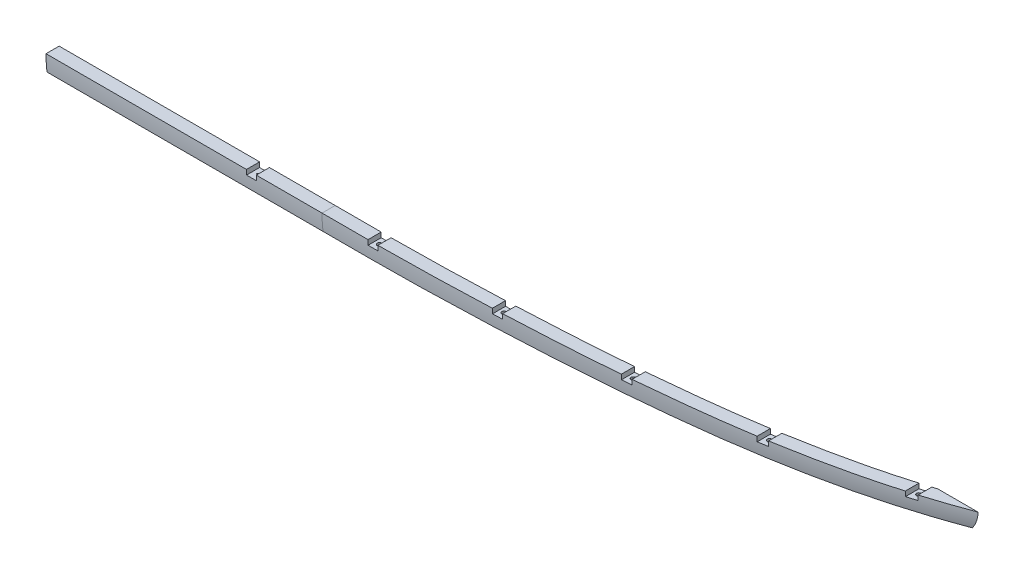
ISO-10303-21;
HEADER;
FILE_DESCRIPTION(('STEP AP214'),'2;1');
FILE_NAME('part.step','',(''),(''),'','','');
FILE_SCHEMA(('AUTOMOTIVE_DESIGN { 1 0 10303 214 1 1 1 1 }'));
ENDSEC;
DATA;
#1=APPLICATION_CONTEXT('core data for automotive mechanical design processes');
#2=APPLICATION_PROTOCOL_DEFINITION('international standard','automotive_design',2000,#1);
#3=PRODUCT_CONTEXT('',#1,'mechanical');
#4=PRODUCT('Part','Part','',(#3));
#5=PRODUCT_RELATED_PRODUCT_CATEGORY('part','',(#4));
#6=PRODUCT_DEFINITION_FORMATION('','',#4);
#7=PRODUCT_DEFINITION_CONTEXT('part definition',#1,'design');
#8=PRODUCT_DEFINITION('design','',#6,#7);
#9=PRODUCT_DEFINITION_SHAPE('','',#8);
#10=(LENGTH_UNIT() NAMED_UNIT(*) SI_UNIT(.MILLI.,.METRE.));
#11=(NAMED_UNIT(*) PLANE_ANGLE_UNIT() SI_UNIT($,.RADIAN.));
#12=(NAMED_UNIT(*) SI_UNIT($,.STERADIAN.) SOLID_ANGLE_UNIT());
#13=UNCERTAINTY_MEASURE_WITH_UNIT(LENGTH_MEASURE(1.E-05),#10,'distance_accuracy_value','');
#14=(GEOMETRIC_REPRESENTATION_CONTEXT(3) GLOBAL_UNCERTAINTY_ASSIGNED_CONTEXT((#13)) GLOBAL_UNIT_ASSIGNED_CONTEXT((#10,
#11,#12)) REPRESENTATION_CONTEXT('',''));
#15=CARTESIAN_POINT('',(0.,0.,0.));
#16=DIRECTION('',(0.,0.,1.));
#17=DIRECTION('',(1.,0.,0.));
#18=AXIS2_PLACEMENT_3D('',#15,#16,#17);
#19=CARTESIAN_POINT('',(-330.199999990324,7.58496376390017E-13,260.350000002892));
#20=DIRECTION('',(0.,-1.,0.));
#21=DIRECTION('',(0.,0.,-1.));
#22=AXIS2_PLACEMENT_3D('',#19,#20,#21);
#23=PLANE('',#22);
#24=DIRECTION('',(1.,0.,0.));
#25=VECTOR('',#24,1.);
#26=CARTESIAN_POINT('',(-330.199999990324,0.,234.949776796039));
#27=LINE('',#26,#25);
#28=CARTESIAN_POINT('',(-228.600001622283,7.01602316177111E-12,234.949776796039));
#29=VERTEX_POINT('',#28);
#30=CARTESIAN_POINT('',(-101.599999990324,0.,234.949776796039));
#31=VERTEX_POINT('',#30);
#32=EDGE_CURVE('E183',#29,#31,#27,.T.);
#33=ORIENTED_EDGE('',*,*,#32,.F.);
#34=DIRECTION('',(0.,0.,-1.));
#35=VECTOR('',#34,1.);
#36=CARTESIAN_POINT('',(-228.600001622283,8.4225803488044E-12,282.052001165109));
#37=LINE('',#36,#35);
#38=CARTESIAN_POINT('',(-228.600001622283,7.77451953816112E-12,260.350000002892));
#39=VERTEX_POINT('',#38);
#40=EDGE_CURVE('E156',#39,#29,#37,.T.);
#41=ORIENTED_EDGE('',*,*,#40,.F.);
#42=DIRECTION('',(1.,0.,0.));
#43=VECTOR('',#42,1.);
#44=CARTESIAN_POINT('',(-330.199999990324,7.58496376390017E-13,260.350000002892));
#45=LINE('',#44,#43);
#46=CARTESIAN_POINT('',(-101.599999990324,7.58496376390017E-13,260.350000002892));
#47=VERTEX_POINT('',#46);
#48=EDGE_CURVE('E124',#39,#47,#45,.T.);
#49=ORIENTED_EDGE('',*,*,#48,.T.);
#50=DIRECTION('',(0.,0.,-1.));
#51=VECTOR('',#50,1.);
#52=CARTESIAN_POINT('',(-101.599999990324,7.58496376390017E-13,260.350000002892));
#53=LINE('',#52,#51);
#54=EDGE_CURVE('E173',#47,#31,#53,.T.);
#55=ORIENTED_EDGE('',*,*,#54,.T.);
#56=EDGE_LOOP('',(#33,#41,#49,#55));
#57=FACE_BOUND('',#56,.T.);
#58=ADVANCED_FACE('F44',(#57),#23,.F.);
#59=CARTESIAN_POINT('',(-330.199999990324,0.,0.));
#60=DIRECTION('',(1.,0.,0.));
#61=DIRECTION('',(0.,0.,-1.));
#62=AXIS2_PLACEMENT_3D('',#59,#60,#61);
#63=CYLINDRICAL_SURFACE('',#62,260.350000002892);
#64=ORIENTED_EDGE('',*,*,#48,.F.);
#65=CARTESIAN_POINT('',(-228.600001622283,0.,0.));
#66=DIRECTION('',(1.,0.,0.));
#67=DIRECTION('',(0.,0.,-1.));
#68=AXIS2_PLACEMENT_3D('',#65,#66,#67);
#69=CIRCLE('',#68,260.350000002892);
#70=CARTESIAN_POINT('',(-228.600001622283,-9.52499999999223,260.175703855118));
#71=VERTEX_POINT('',#70);
#72=EDGE_CURVE('E167',#39,#71,#69,.T.);
#73=ORIENTED_EDGE('',*,*,#72,.T.);
#74=DIRECTION('',(1.,0.,0.));
#75=VECTOR('',#74,1.);
#76=CARTESIAN_POINT('',(-330.199999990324,-9.52499999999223,260.175703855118));
#77=LINE('',#76,#75);
#78=CARTESIAN_POINT('',(-247.650001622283,-9.52499999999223,260.175703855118));
#79=VERTEX_POINT('',#78);
#80=EDGE_CURVE('E162',#79,#71,#77,.T.);
#81=ORIENTED_EDGE('',*,*,#80,.F.);
#82=CARTESIAN_POINT('',(-247.650001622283,0.,0.));
#83=DIRECTION('',(-1.,0.,0.));
#84=DIRECTION('',(0.,0.,1.));
#85=AXIS2_PLACEMENT_3D('',#82,#83,#84);
#86=CIRCLE('',#85,260.350000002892);
#87=CARTESIAN_POINT('',(-247.650001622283,7.77451953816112E-12,260.350000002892));
#88=VERTEX_POINT('',#87);
#89=EDGE_CURVE('E119',#79,#88,#86,.T.);
#90=ORIENTED_EDGE('',*,*,#89,.T.);
#91=CARTESIAN_POINT('',(-634.999999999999,8.46557695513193E-13,260.350000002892));
#92=VERTEX_POINT('',#91);
#93=EDGE_CURVE('E114',#92,#88,#45,.T.);
#94=ORIENTED_EDGE('',*,*,#93,.F.);
#95=CARTESIAN_POINT('',(-634.999999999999,0.,0.));
#96=DIRECTION('',(1.,0.,0.));
#97=DIRECTION('',(0.,0.,-1.));
#98=AXIS2_PLACEMENT_3D('',#95,#96,#97);
#99=CIRCLE('',#98,260.350000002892);
#100=CARTESIAN_POINT('',(-634.999999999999,-31.7500000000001,258.406772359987));
#101=VERTEX_POINT('',#100);
#102=EDGE_CURVE('E117',#92,#101,#99,.T.);
#103=ORIENTED_EDGE('',*,*,#102,.T.);
#104=DIRECTION('',(1.,0.,0.));
#105=VECTOR('',#104,1.);
#106=CARTESIAN_POINT('',(-330.199999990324,-31.7500000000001,258.406772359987));
#107=LINE('',#106,#105);
#108=CARTESIAN_POINT('',(-101.599999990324,-31.7500000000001,258.406772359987));
#109=VERTEX_POINT('',#108);
#110=EDGE_CURVE('E179',#101,#109,#107,.T.);
#111=ORIENTED_EDGE('',*,*,#110,.T.);
#112=CARTESIAN_POINT('',(-101.599999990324,0.,0.));
#113=DIRECTION('',(-1.,0.,0.));
#114=DIRECTION('',(0.,0.,1.));
#115=AXIS2_PLACEMENT_3D('',#112,#113,#114);
#116=CIRCLE('',#115,260.350000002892);
#117=EDGE_CURVE('E170',#109,#47,#116,.T.);
#118=ORIENTED_EDGE('',*,*,#117,.T.);
#119=EDGE_LOOP('',(#64,#73,#81,#90,#94,#103,#111,#118));
#120=FACE_BOUND('',#119,.T.);
#121=ADVANCED_FACE('F46',(#120),#63,.T.);
#122=ORIENTED_EDGE('',*,*,#93,.T.);
#123=DIRECTION('',(0.,0.,1.));
#124=VECTOR('',#123,1.);
#125=CARTESIAN_POINT('',(-247.650001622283,8.4225803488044E-12,282.052001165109));
#126=LINE('',#125,#124);
#127=CARTESIAN_POINT('',(-247.650001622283,7.01602316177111E-12,234.949776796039));
#128=VERTEX_POINT('',#127);
#129=EDGE_CURVE('E159',#128,#88,#126,.T.);
#130=ORIENTED_EDGE('',*,*,#129,.F.);
#131=CARTESIAN_POINT('',(-634.999999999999,0.,234.949776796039));
#132=VERTEX_POINT('',#131);
#133=EDGE_CURVE('E138',#132,#128,#27,.T.);
#134=ORIENTED_EDGE('',*,*,#133,.F.);
#135=DIRECTION('',(0.,0.,1.));
#136=VECTOR('',#135,1.);
#137=CARTESIAN_POINT('',(-634.999999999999,7.58496376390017E-13,260.350000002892));
#138=LINE('',#137,#136);
#139=EDGE_CURVE('E131',#132,#92,#138,.T.);
#140=ORIENTED_EDGE('',*,*,#139,.T.);
#141=EDGE_LOOP('',(#122,#130,#134,#140));
#142=FACE_BOUND('',#141,.T.);
#143=ADVANCED_FACE('F136',(#142),#23,.F.);
#144=CARTESIAN_POINT('',(-330.199999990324,-31.7500000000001,234.949776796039));
#145=DIRECTION('',(0.,0.,1.));
#146=DIRECTION('',(1.,0.,0.));
#147=AXIS2_PLACEMENT_3D('',#144,#145,#146);
#148=PLANE('',#147);
#149=DIRECTION('',(-1.,0.,0.));
#150=VECTOR('',#149,1.);
#151=CARTESIAN_POINT('',(-330.199999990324,-9.52499999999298,234.949776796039));
#152=LINE('',#151,#150);
#153=CARTESIAN_POINT('',(-228.600001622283,-9.52499999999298,234.949776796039));
#154=VERTEX_POINT('',#153);
#155=CARTESIAN_POINT('',(-247.650001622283,-9.52499999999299,234.949776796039));
#156=VERTEX_POINT('',#155);
#157=EDGE_CURVE('E123',#154,#156,#152,.T.);
#158=ORIENTED_EDGE('',*,*,#157,.F.);
#159=DIRECTION('',(0.,1.,0.));
#160=VECTOR('',#159,1.);
#161=CARTESIAN_POINT('',(-228.600001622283,-31.7500000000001,234.949776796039));
#162=LINE('',#161,#160);
#163=EDGE_CURVE('E12',#154,#29,#162,.T.);
#164=ORIENTED_EDGE('',*,*,#163,.T.);
#165=ORIENTED_EDGE('',*,*,#32,.T.);
#166=DIRECTION('',(0.,-1.,0.));
#167=VECTOR('',#166,1.);
#168=CARTESIAN_POINT('',(-101.599999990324,-31.7500000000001,234.949776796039));
#169=LINE('',#168,#167);
#170=CARTESIAN_POINT('',(-101.599999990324,-31.7500000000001,234.949776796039));
#171=VERTEX_POINT('',#170);
#172=EDGE_CURVE('E176',#31,#171,#169,.T.);
#173=ORIENTED_EDGE('',*,*,#172,.T.);
#174=DIRECTION('',(1.,0.,0.));
#175=VECTOR('',#174,1.);
#176=CARTESIAN_POINT('',(-330.199999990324,-31.7500000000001,234.949776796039));
#177=LINE('',#176,#175);
#178=CARTESIAN_POINT('',(-634.999999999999,-31.7500000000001,234.949776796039));
#179=VERTEX_POINT('',#178);
#180=EDGE_CURVE('E181',#179,#171,#177,.T.);
#181=ORIENTED_EDGE('',*,*,#180,.F.);
#182=DIRECTION('',(0.,1.,0.));
#183=VECTOR('',#182,1.);
#184=CARTESIAN_POINT('',(-634.999999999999,0.,234.949776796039));
#185=LINE('',#184,#183);
#186=EDGE_CURVE('E142',#179,#132,#185,.T.);
#187=ORIENTED_EDGE('',*,*,#186,.T.);
#188=ORIENTED_EDGE('',*,*,#133,.T.);
#189=DIRECTION('',(0.,-1.,0.));
#190=VECTOR('',#189,1.);
#191=CARTESIAN_POINT('',(-247.650001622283,-31.7500000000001,234.949776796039));
#192=LINE('',#191,#190);
#193=EDGE_CURVE('E52',#128,#156,#192,.T.);
#194=ORIENTED_EDGE('',*,*,#193,.T.);
#195=EDGE_LOOP('',(#158,#164,#165,#173,#181,#187,#188,#194));
#196=FACE_BOUND('',#195,.T.);
#197=ADVANCED_FACE('F188',(#196),#148,.F.);
#198=CARTESIAN_POINT('',(-330.199999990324,-31.7500000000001,258.406772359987));
#199=DIRECTION('',(0.,1.,0.));
#200=DIRECTION('',(0.,0.,1.));
#201=AXIS2_PLACEMENT_3D('',#198,#199,#200);
#202=PLANE('',#201);
#203=DIRECTION('',(0.,0.,1.));
#204=VECTOR('',#203,1.);
#205=CARTESIAN_POINT('',(-101.599999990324,-31.7500000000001,258.406772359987));
#206=LINE('',#205,#204);
#207=EDGE_CURVE('E67',#171,#109,#206,.T.);
#208=ORIENTED_EDGE('',*,*,#207,.T.);
#209=ORIENTED_EDGE('',*,*,#110,.F.);
#210=DIRECTION('',(0.,0.,-1.));
#211=VECTOR('',#210,1.);
#212=CARTESIAN_POINT('',(-634.999999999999,-31.7500000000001,234.949776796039));
#213=LINE('',#212,#211);
#214=EDGE_CURVE('E134',#101,#179,#213,.T.);
#215=ORIENTED_EDGE('',*,*,#214,.T.);
#216=ORIENTED_EDGE('',*,*,#180,.T.);
#217=EDGE_LOOP('',(#208,#209,#215,#216));
#218=FACE_BOUND('',#217,.T.);
#219=ADVANCED_FACE('F201',(#218),#202,.F.);
#220=CARTESIAN_POINT('',(-101.599999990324,0.,0.));
#221=DIRECTION('',(-1.,0.,0.));
#222=DIRECTION('',(0.,0.,1.));
#223=AXIS2_PLACEMENT_3D('',#220,#221,#222);
#224=PLANE('',#223);
#225=ORIENTED_EDGE('',*,*,#117,.F.);
#226=ORIENTED_EDGE('',*,*,#207,.F.);
#227=ORIENTED_EDGE('',*,*,#172,.F.);
#228=ORIENTED_EDGE('',*,*,#54,.F.);
#229=EDGE_LOOP('',(#225,#226,#227,#228));
#230=FACE_BOUND('',#229,.T.);
#231=ADVANCED_FACE('F203',(#230),#224,.F.);
#232=CARTESIAN_POINT('',(-228.600001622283,-9.52499999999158,282.052001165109));
#233=DIRECTION('',(1.,0.,0.));
#234=DIRECTION('',(0.,0.,-1.));
#235=AXIS2_PLACEMENT_3D('',#232,#233,#234);
#236=PLANE('',#235);
#237=ORIENTED_EDGE('',*,*,#40,.T.);
#238=ORIENTED_EDGE('',*,*,#163,.F.);
#239=DIRECTION('',(0.,0.,-1.));
#240=VECTOR('',#239,1.);
#241=CARTESIAN_POINT('',(-228.600001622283,-9.52499999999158,282.052001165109));
#242=LINE('',#241,#240);
#243=EDGE_CURVE('E59',#71,#154,#242,.T.);
#244=ORIENTED_EDGE('',*,*,#243,.F.);
#245=ORIENTED_EDGE('',*,*,#72,.F.);
#246=EDGE_LOOP('',(#237,#238,#244,#245));
#247=FACE_BOUND('',#246,.T.);
#248=ADVANCED_FACE('F195',(#247),#236,.F.);
#249=CARTESIAN_POINT('',(-247.650001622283,-9.52499999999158,282.052001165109));
#250=DIRECTION('',(-1.,0.,0.));
#251=DIRECTION('',(0.,0.,1.));
#252=AXIS2_PLACEMENT_3D('',#249,#250,#251);
#253=PLANE('',#252);
#254=DIRECTION('',(0.,0.,1.));
#255=VECTOR('',#254,1.);
#256=CARTESIAN_POINT('',(-247.650001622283,-9.52499999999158,282.052001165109));
#257=LINE('',#256,#255);
#258=EDGE_CURVE('E158',#156,#79,#257,.T.);
#259=ORIENTED_EDGE('',*,*,#258,.F.);
#260=ORIENTED_EDGE('',*,*,#193,.F.);
#261=ORIENTED_EDGE('',*,*,#129,.T.);
#262=ORIENTED_EDGE('',*,*,#89,.F.);
#263=EDGE_LOOP('',(#259,#260,#261,#262));
#264=FACE_BOUND('',#263,.T.);
#265=ADVANCED_FACE('F191',(#264),#253,.F.);
#266=CARTESIAN_POINT('',(-228.600001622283,-9.52499999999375,209.170142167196));
#267=DIRECTION('',(0.,1.,0.));
#268=DIRECTION('',(0.,0.,1.));
#269=AXIS2_PLACEMENT_3D('',#266,#267,#268);
#270=PLANE('',#269);
#271=CARTESIAN_POINT('',(-238.125001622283,-9.52499999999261,247.650862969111));
#272=DIRECTION('',(0.,1.,0.));
#273=DIRECTION('',(0.,0.,1.));
#274=AXIS2_PLACEMENT_3D('',#271,#272,#273);
#275=CIRCLE('',#274,2.0828);
#276=CARTESIAN_POINT('',(-238.125001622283,-9.52499999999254,249.733662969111));
#277=VERTEX_POINT('',#276);
#278=EDGE_CURVE('E153',#277,#277,#275,.T.);
#279=ORIENTED_EDGE('',*,*,#278,.F.);
#280=EDGE_LOOP('',(#279));
#281=FACE_BOUND('',#280,.T.);
#282=ORIENTED_EDGE('',*,*,#80,.T.);
#283=ORIENTED_EDGE('',*,*,#243,.T.);
#284=ORIENTED_EDGE('',*,*,#157,.T.);
#285=ORIENTED_EDGE('',*,*,#258,.T.);
#286=EDGE_LOOP('',(#282,#283,#284,#285));
#287=FACE_BOUND('',#286,.T.);
#288=ADVANCED_FACE('F192',(#281,#287),#270,.T.);
#289=CARTESIAN_POINT('',(-238.125001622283,-9.52499999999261,247.650862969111));
#290=DIRECTION('',(0.,1.,0.));
#291=DIRECTION('',(0.,0.,1.));
#292=AXIS2_PLACEMENT_3D('',#289,#290,#291);
#293=CYLINDRICAL_SURFACE('',#292,2.0828);
#294=CARTESIAN_POINT('',(-238.125001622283,-17.8559967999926,247.650862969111));
#295=DIRECTION('',(0.,1.,0.));
#296=DIRECTION('',(0.,0.,1.));
#297=AXIS2_PLACEMENT_3D('',#294,#295,#296);
#298=CIRCLE('',#297,2.0828);
#299=CARTESIAN_POINT('',(-238.125001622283,-17.8559967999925,249.733662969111));
#300=VERTEX_POINT('',#299);
#301=EDGE_CURVE('E150',#300,#300,#298,.T.);
#302=ORIENTED_EDGE('',*,*,#301,.F.);
#303=EDGE_LOOP('',(#302));
#304=FACE_BOUND('',#303,.T.);
#305=ORIENTED_EDGE('',*,*,#278,.T.);
#306=EDGE_LOOP('',(#305));
#307=FACE_BOUND('',#306,.T.);
#308=ADVANCED_FACE('F264',(#304,#307),#293,.F.);
#309=CARTESIAN_POINT('',(-236.397801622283,-17.8559967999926,247.650862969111));
#310=DIRECTION('',(0.,-1.,0.));
#311=DIRECTION('',(0.,0.,-1.));
#312=AXIS2_PLACEMENT_3D('',#309,#310,#311);
#313=PLANE('',#312);
#314=CARTESIAN_POINT('',(-238.125001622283,-17.8559967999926,247.650862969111));
#315=DIRECTION('',(0.,1.,0.));
#316=DIRECTION('',(0.,0.,1.));
#317=AXIS2_PLACEMENT_3D('',#314,#315,#316);
#318=CIRCLE('',#317,1.72719999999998);
#319=CARTESIAN_POINT('',(-238.125001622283,-17.8559967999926,249.378062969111));
#320=VERTEX_POINT('',#319);
#321=EDGE_CURVE('E147',#320,#320,#318,.T.);
#322=ORIENTED_EDGE('',*,*,#321,.F.);
#323=EDGE_LOOP('',(#322));
#324=FACE_BOUND('',#323,.T.);
#325=ORIENTED_EDGE('',*,*,#301,.T.);
#326=EDGE_LOOP('',(#325));
#327=FACE_BOUND('',#326,.T.);
#328=ADVANCED_FACE('F255',(#324,#327),#313,.F.);
#329=CARTESIAN_POINT('',(-238.125001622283,-9.52499999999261,247.650862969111));
#330=DIRECTION('',(0.,1.,0.));
#331=DIRECTION('',(0.,0.,1.));
#332=AXIS2_PLACEMENT_3D('',#329,#330,#331);
#333=CYLINDRICAL_SURFACE('',#332,1.72719999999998);
#334=CARTESIAN_POINT('',(-238.125001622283,-21.8190063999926,247.650862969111));
#335=DIRECTION('',(0.,1.,0.));
#336=DIRECTION('',(0.,0.,1.));
#337=AXIS2_PLACEMENT_3D('',#334,#335,#336);
#338=CIRCLE('',#337,1.72719999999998);
#339=CARTESIAN_POINT('',(-238.125001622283,-21.8190063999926,249.378062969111));
#340=VERTEX_POINT('',#339);
#341=EDGE_CURVE('E144',#340,#340,#338,.T.);
#342=ORIENTED_EDGE('',*,*,#341,.F.);
#343=EDGE_LOOP('',(#342));
#344=FACE_BOUND('',#343,.T.);
#345=ORIENTED_EDGE('',*,*,#321,.T.);
#346=EDGE_LOOP('',(#345));
#347=FACE_BOUND('',#346,.T.);
#348=ADVANCED_FACE('F245',(#344,#347),#333,.F.);
#349=CARTESIAN_POINT('',(-238.125001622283,-21.8190063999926,247.650862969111));
#350=DIRECTION('',(0.,1.,0.));
#351=DIRECTION('',(0.,0.,1.));
#352=AXIS2_PLACEMENT_3D('',#349,#350,#351);
#353=CONICAL_SURFACE('',#352,1.72719999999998,1.02974425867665);
#354=CARTESIAN_POINT('',(-238.125001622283,-22.856812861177,247.650862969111));
#355=VERTEX_POINT('',#354);
#356=VERTEX_LOOP('',#355);
#357=FACE_BOUND('',#356,.T.);
#358=ORIENTED_EDGE('',*,*,#341,.T.);
#359=EDGE_LOOP('',(#358));
#360=FACE_BOUND('',#359,.T.);
#361=ADVANCED_FACE('F236',(#357,#360),#353,.F.);
#362=CARTESIAN_POINT('',(-634.999999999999,-1.38777878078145E-13,0.));
#363=DIRECTION('',(1.,0.,0.));
#364=DIRECTION('',(0.,0.,-1.));
#365=AXIS2_PLACEMENT_3D('',#362,#363,#364);
#366=PLANE('',#365);
#367=ORIENTED_EDGE('',*,*,#214,.F.);
#368=ORIENTED_EDGE('',*,*,#102,.F.);
#369=ORIENTED_EDGE('',*,*,#139,.F.);
#370=ORIENTED_EDGE('',*,*,#186,.F.);
#371=EDGE_LOOP('',(#367,#368,#369,#370));
#372=FACE_BOUND('',#371,.T.);
#373=ADVANCED_FACE('F129',(#372),#366,.F.);
#374=CLOSED_SHELL('',(#58,#121,#143,#197,#219,#231,#248,#265,#288,#308,#328,#348,#361,#373));
#375=MANIFOLD_SOLID_BREP('B2',#374);
#376=CARTESIAN_POINT('',(936.624998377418,-63.521830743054,145.372528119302));
#377=DIRECTION('',(0.,1.,0.));
#378=DIRECTION('',(0.,0.,1.));
#379=AXIS2_PLACEMENT_3D('',#376,#377,#378);
#380=CYLINDRICAL_SURFACE('',#379,3.17499999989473);
#381=CARTESIAN_POINT('',(936.624998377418,-17.145,145.372528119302));
#382=DIRECTION('',(0.,1.,0.));
#383=DIRECTION('',(0.,0.,1.));
#384=AXIS2_PLACEMENT_3D('',#381,#382,#383);
#385=CIRCLE('',#384,3.17499999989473);
#386=CARTESIAN_POINT('',(936.624998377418,-17.145,148.547528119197));
#387=VERTEX_POINT('',#386);
#388=EDGE_CURVE('E1053',#387,#387,#385,.F.);
#389=ORIENTED_EDGE('',*,*,#388,.F.);
#390=EDGE_LOOP('',(#389));
#391=FACE_BOUND('',#390,.T.);
#392=CARTESIAN_POINT('',(936.624998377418,-25.4000000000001,145.372528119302));
#393=DIRECTION('',(0.,-1.,0.));
#394=DIRECTION('',(0.,0.,-1.));
#395=AXIS2_PLACEMENT_3D('',#392,#393,#394);
#396=CIRCLE('',#395,3.17499999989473);
#397=CARTESIAN_POINT('',(936.624998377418,-25.4000000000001,142.197528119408));
#398=VERTEX_POINT('',#397);
#399=EDGE_CURVE('E349',#398,#398,#396,.F.);
#400=ORIENTED_EDGE('',*,*,#399,.F.);
#401=EDGE_LOOP('',(#400));
#402=FACE_BOUND('',#401,.T.);
#403=ADVANCED_FACE('F344',(#391,#402),#380,.F.);
#404=CARTESIAN_POINT('',(701.674998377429,-63.521830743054,198.803613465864));
#405=DIRECTION('',(0.,1.,0.));
#406=DIRECTION('',(0.,0.,1.));
#407=AXIS2_PLACEMENT_3D('',#404,#405,#406);
#408=CYLINDRICAL_SURFACE('',#407,3.17499999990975);
#409=CARTESIAN_POINT('',(701.674998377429,-17.145,198.803613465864));
#410=DIRECTION('',(0.,1.,0.));
#411=DIRECTION('',(0.,0.,1.));
#412=AXIS2_PLACEMENT_3D('',#409,#410,#411);
#413=CIRCLE('',#412,3.17499999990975);
#414=CARTESIAN_POINT('',(701.674998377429,-17.145,201.978613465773));
#415=VERTEX_POINT('',#414);
#416=EDGE_CURVE('E1046',#415,#415,#413,.F.);
#417=ORIENTED_EDGE('',*,*,#416,.F.);
#418=EDGE_LOOP('',(#417));
#419=FACE_BOUND('',#418,.T.);
#420=CARTESIAN_POINT('',(701.674998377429,-25.4000000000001,198.803613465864));
#421=DIRECTION('',(0.,-1.,0.));
#422=DIRECTION('',(0.,0.,-1.));
#423=AXIS2_PLACEMENT_3D('',#420,#421,#422);
#424=CIRCLE('',#423,3.17499999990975);
#425=CARTESIAN_POINT('',(701.674998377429,-25.4000000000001,195.628613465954));
#426=VERTEX_POINT('',#425);
#427=EDGE_CURVE('E1081',#426,#426,#424,.F.);
#428=ORIENTED_EDGE('',*,*,#427,.F.);
#429=EDGE_LOOP('',(#428));
#430=FACE_BOUND('',#429,.T.);
#431=ADVANCED_FACE('F740',(#419,#430),#408,.F.);
#432=CARTESIAN_POINT('',(466.724998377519,-63.521830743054,227.170336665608));
#433=DIRECTION('',(0.,1.,0.));
#434=DIRECTION('',(0.,0.,1.));
#435=AXIS2_PLACEMENT_3D('',#432,#433,#434);
#436=CYLINDRICAL_SURFACE('',#435,3.17499999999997);
#437=CARTESIAN_POINT('',(466.724998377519,-17.145,227.170336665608));
#438=DIRECTION('',(0.,1.,0.));
#439=DIRECTION('',(0.,0.,1.));
#440=AXIS2_PLACEMENT_3D('',#437,#438,#439);
#441=CIRCLE('',#440,3.17499999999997);
#442=CARTESIAN_POINT('',(466.724998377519,-17.145,230.345336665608));
#443=VERTEX_POINT('',#442);
#444=EDGE_CURVE('E1039',#443,#443,#441,.F.);
#445=ORIENTED_EDGE('',*,*,#444,.F.);
#446=EDGE_LOOP('',(#445));
#447=FACE_BOUND('',#446,.T.);
#448=CARTESIAN_POINT('',(466.724998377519,-25.4000000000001,227.170336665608));
#449=DIRECTION('',(0.,-1.,0.));
#450=DIRECTION('',(0.,0.,-1.));
#451=AXIS2_PLACEMENT_3D('',#448,#449,#450);
#452=CIRCLE('',#451,3.17499999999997);
#453=CARTESIAN_POINT('',(466.724998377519,-25.4000000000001,223.995336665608));
#454=VERTEX_POINT('',#453);
#455=EDGE_CURVE('E1074',#454,#454,#452,.F.);
#456=ORIENTED_EDGE('',*,*,#455,.F.);
#457=EDGE_LOOP('',(#456));
#458=FACE_BOUND('',#457,.T.);
#459=ADVANCED_FACE('F746',(#447,#458),#436,.F.);
#460=CARTESIAN_POINT('',(231.774998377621,-63.521830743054,241.94242152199));
#461=DIRECTION('',(0.,1.,0.));
#462=DIRECTION('',(0.,0.,1.));
#463=AXIS2_PLACEMENT_3D('',#460,#461,#462);
#464=CYLINDRICAL_SURFACE('',#463,3.17500000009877);
#465=CARTESIAN_POINT('',(231.774998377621,-17.145,241.94242152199));
#466=DIRECTION('',(0.,1.,0.));
#467=DIRECTION('',(0.,0.,1.));
#468=AXIS2_PLACEMENT_3D('',#465,#466,#467);
#469=CIRCLE('',#468,3.17500000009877);
#470=CARTESIAN_POINT('',(231.774998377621,-17.145,245.117421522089));
#471=VERTEX_POINT('',#470);
#472=EDGE_CURVE('E1032',#471,#471,#469,.F.);
#473=ORIENTED_EDGE('',*,*,#472,.F.);
#474=EDGE_LOOP('',(#473));
#475=FACE_BOUND('',#474,.T.);
#476=CARTESIAN_POINT('',(231.774998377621,-25.4000000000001,241.94242152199));
#477=DIRECTION('',(0.,-1.,0.));
#478=DIRECTION('',(0.,0.,-1.));
#479=AXIS2_PLACEMENT_3D('',#476,#477,#478);
#480=CIRCLE('',#479,3.17500000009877);
#481=CARTESIAN_POINT('',(231.774998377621,-25.4000000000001,238.767421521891));
#482=VERTEX_POINT('',#481);
#483=EDGE_CURVE('E1067',#482,#482,#480,.F.);
#484=ORIENTED_EDGE('',*,*,#483,.F.);
#485=EDGE_LOOP('',(#484));
#486=FACE_BOUND('',#485,.T.);
#487=ADVANCED_FACE('F757',(#475,#486),#464,.F.);
#488=CARTESIAN_POINT('',(-3.17500162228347,-63.521830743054,247.650862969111));
#489=DIRECTION('',(0.,1.,0.));
#490=DIRECTION('',(0.,0.,1.));
#491=AXIS2_PLACEMENT_3D('',#488,#489,#490);
#492=CYLINDRICAL_SURFACE('',#491,3.17500000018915);
#493=CARTESIAN_POINT('',(-3.17500162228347,-17.145,247.650862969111));
#494=DIRECTION('',(0.,1.,0.));
#495=DIRECTION('',(0.,0.,1.));
#496=AXIS2_PLACEMENT_3D('',#493,#494,#495);
#497=CIRCLE('',#496,3.17500000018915);
#498=CARTESIAN_POINT('',(-3.17500162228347,-17.145,250.8258629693));
#499=VERTEX_POINT('',#498);
#500=EDGE_CURVE('E527',#499,#499,#497,.F.);
#501=ORIENTED_EDGE('',*,*,#500,.F.);
#502=EDGE_LOOP('',(#501));
#503=FACE_BOUND('',#502,.T.);
#504=CARTESIAN_POINT('',(-3.17500162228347,-25.4000000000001,247.650862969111));
#505=DIRECTION('',(0.,-1.,0.));
#506=DIRECTION('',(0.,0.,-1.));
#507=AXIS2_PLACEMENT_3D('',#504,#505,#506);
#508=CIRCLE('',#507,3.17500000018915);
#509=CARTESIAN_POINT('',(-3.17500162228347,-25.4000000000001,244.475862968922));
#510=VERTEX_POINT('',#509);
#511=EDGE_CURVE('E1060',#510,#510,#508,.F.);
#512=ORIENTED_EDGE('',*,*,#511,.F.);
#513=EDGE_LOOP('',(#512));
#514=FACE_BOUND('',#513,.T.);
#515=ADVANCED_FACE('F761',(#503,#514),#492,.F.);
#516=CARTESIAN_POINT('',(534.422572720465,-9.525,259.022249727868));
#517=DIRECTION('',(0.,-1.,0.));
#518=DIRECTION('',(0.,0.,-1.));
#519=AXIS2_PLACEMENT_3D('',#516,#517,#518);
#520=PLANE('',#519);
#521=CARTESIAN_POINT('',(936.624998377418,-9.525,145.372528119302));
#522=DIRECTION('',(0.,1.,0.));
#523=DIRECTION('',(0.,0.,1.));
#524=AXIS2_PLACEMENT_3D('',#521,#522,#523);
#525=CIRCLE('',#524,4.36562499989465);
#526=CARTESIAN_POINT('',(936.624998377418,-9.525,149.738153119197));
#527=VERTEX_POINT('',#526);
#528=EDGE_CURVE('E1056',#527,#527,#525,.T.);
#529=ORIENTED_EDGE('',*,*,#528,.F.);
#530=EDGE_LOOP('',(#529));
#531=FACE_BOUND('',#530,.T.);
#532=DIRECTION('',(0.,0.,-1.));
#533=VECTOR('',#532,1.);
#534=CARTESIAN_POINT('',(946.149998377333,-9.525,103.438565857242));
#535=LINE('',#534,#533);
#536=CARTESIAN_POINT('',(946.149998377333,-9.525,156.0331716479));
#537=VERTEX_POINT('',#536);
#538=CARTESIAN_POINT('',(946.149998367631,-9.52500000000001,129.744661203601));
#539=VERTEX_POINT('',#538);
#540=EDGE_CURVE('E362',#537,#539,#535,.T.);
#541=ORIENTED_EDGE('',*,*,#540,.T.);
#542=CARTESIAN_POINT('',(-3070.65215490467,-9.52500000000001,94.639891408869));
#543=CARTESIAN_POINT('',(-2046.40956664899,-9.52500000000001,237.710681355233));
#544=CARTESIAN_POINT('',(-1024.8947954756,-9.52500000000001,234.898762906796));
#545=CARTESIAN_POINT('',(2.7463275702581,-9.52500000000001,234.951167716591));
#546=CARTESIAN_POINT('',(8.8188747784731,-9.52500000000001,234.93803628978));
#547=CARTESIAN_POINT('',(20.9633487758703,-9.52500000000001,234.87859364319));
#548=CARTESIAN_POINT('',(39.1792048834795,-9.52500000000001,234.74371053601));
#549=CARTESIAN_POINT('',(57.3926984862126,-9.52500000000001,234.482481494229));
#550=CARTESIAN_POINT('',(93.8170721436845,-9.52500000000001,233.820251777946));
#551=CARTESIAN_POINT('',(118.096503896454,-9.52500000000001,233.19244118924));
#552=CARTESIAN_POINT('',(166.651240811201,-9.52500000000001,231.716131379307));
#553=CARTESIAN_POINT('',(190.926726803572,-9.52500000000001,230.877302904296));
#554=CARTESIAN_POINT('',(239.473167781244,-9.52500000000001,228.957329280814));
#555=CARTESIAN_POINT('',(263.743135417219,-9.52500000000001,227.87477772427));
#556=CARTESIAN_POINT('',(312.257838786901,-9.52500000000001,225.415648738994));
#557=CARTESIAN_POINT('',(336.504717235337,-9.52500000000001,224.039778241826));
#558=CARTESIAN_POINT('',(384.973238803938,-9.52500000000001,220.935512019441));
#559=CARTESIAN_POINT('',(409.194867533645,-9.52500000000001,219.206915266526));
#560=CARTESIAN_POINT('',(457.608437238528,-9.52500000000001,215.334998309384));
#561=CARTESIAN_POINT('',(481.799938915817,-9.52500000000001,213.185541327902));
#562=CARTESIAN_POINT('',(518.064441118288,-9.52500000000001,209.643545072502));
#563=CARTESIAN_POINT('',(530.148863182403,-9.52500000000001,208.410559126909));
#564=CARTESIAN_POINT('',(554.310403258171,-9.52500000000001,205.842553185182));
#565=CARTESIAN_POINT('',(566.38121653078,-9.52500000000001,204.510901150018));
#566=CARTESIAN_POINT('',(602.551579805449,-9.52500000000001,200.341319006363));
#567=CARTESIAN_POINT('',(626.609600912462,-9.52500000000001,197.321969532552));
#568=CARTESIAN_POINT('',(674.553245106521,-9.52500000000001,190.539650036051));
#569=CARTESIAN_POINT('',(698.436657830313,-9.52500000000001,186.767145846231));
#570=CARTESIAN_POINT('',(734.129420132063,-9.52500000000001,180.537482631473));
#571=CARTESIAN_POINT('',(746.004996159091,-9.52500000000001,178.365984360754));
#572=CARTESIAN_POINT('',(769.712255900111,-9.52500000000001,173.833662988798));
#573=CARTESIAN_POINT('',(781.543893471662,-9.52500000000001,171.472640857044));
#574=CARTESIAN_POINT('',(816.964640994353,-9.52500000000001,164.06967078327));
#575=CARTESIAN_POINT('',(840.479552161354,-9.52500000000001,158.707674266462));
#576=CARTESIAN_POINT('',(887.26743801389,-9.52500000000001,146.940113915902));
#577=CARTESIAN_POINT('',(910.54127033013,-9.52500000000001,140.538249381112));
#578=CARTESIAN_POINT('',(945.252593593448,-9.52500000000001,130.075253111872));
#579=CARTESIAN_POINT('',(956.789604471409,-9.52500000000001,126.443390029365));
#580=CARTESIAN_POINT('',(979.794414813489,-9.52500000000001,118.881127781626));
#581=CARTESIAN_POINT('',(1002.73074739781,-9.52500000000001,111.023493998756));
#582=CARTESIAN_POINT('',(1025.53280895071,-9.52500000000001,102.58669638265));
#583=CARTESIAN_POINT('',(1042.58492404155,-9.52500000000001,96.0458824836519));
#584=CARTESIAN_POINT('',(1048.26072300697,-9.52500000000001,93.8300714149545));
#585=CARTESIAN_POINT('',(1415.64050338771,-9.52500000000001,-52.0840689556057));
#586=CARTESIAN_POINT('',(1745.18928861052,-9.52500000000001,-334.480421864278));
#587=CARTESIAN_POINT('',(1573.73315290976,-9.52500000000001,-2777.90828872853));
#588=B_SPLINE_CURVE_WITH_KNOTS('',3,(#542,#543,#544,#545,#546,#547,#548,#549,#550,#551,#552,
#553,#554,#555,#556,#557,#558,#559,#560,#561,#562,#563,#564,#565,#566,#567,#568,#569,#570,#571,
#572,#573,#574,#575,#576,#577,#578,#579,#580,#581,#582,#583,#584,#585,#586,#587),.UNSPECIFIED.,
.F.,.F.,(4,2,2,1,2,2,2,2,2,2,2,2,2,2,2,2,2,2,2,2,1,2,2,4),(-2.56594304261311,0.0625000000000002,
0.0781250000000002,0.0937500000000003,0.125,0.187500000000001,0.250000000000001,
0.312500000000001,0.375000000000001,0.437500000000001,0.500000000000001,0.531250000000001,
0.562500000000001,0.625000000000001,0.687500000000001,0.718750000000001,0.750000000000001,
0.812500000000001,0.875000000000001,0.90625,0.9375,0.96875,0.984375,1.98157335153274),.UNSPECIFIED.);
#589=CARTESIAN_POINT('',(927.099998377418,-9.525,135.530492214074));
#590=VERTEX_POINT('',#589);
#591=EDGE_CURVE('E819',#590,#539,#588,.T.);
#592=ORIENTED_EDGE('',*,*,#591,.F.);
#593=DIRECTION('',(0.,0.,1.));
#594=VECTOR('',#593,1.);
#595=CARTESIAN_POINT('',(927.099998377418,-9.525,109.017910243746));
#596=LINE('',#595,#594);
#597=CARTESIAN_POINT('',(927.099998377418,-9.525,161.723432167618));
#598=VERTEX_POINT('',#597);
#599=EDGE_CURVE('E780',#590,#598,#596,.T.);
#600=ORIENTED_EDGE('',*,*,#599,.T.);
#601=CARTESIAN_POINT('',(946.149998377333,-9.525,156.0331716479));
#602=CARTESIAN_POINT('',(945.35781155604,-9.525,156.275484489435));
#603=CARTESIAN_POINT('',(944.565423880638,-9.525,156.517140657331));
#604=CARTESIAN_POINT('',(942.980256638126,-9.525,156.999141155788));
#605=CARTESIAN_POINT('',(942.187477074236,-9.525,157.239485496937));
#606=CARTESIAN_POINT('',(940.601527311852,-9.525,157.718866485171));
#607=CARTESIAN_POINT('',(939.808357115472,-9.525,157.957903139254));
#608=CARTESIAN_POINT('',(938.221627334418,-9.525,158.434672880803));
#609=CARTESIAN_POINT('',(937.428067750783,-9.525,158.672405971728));
#610=CARTESIAN_POINT('',(935.840560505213,-9.525,159.146572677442));
#611=CARTESIAN_POINT('',(935.046612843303,-9.525,159.383006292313));
#612=CARTESIAN_POINT('',(933.458330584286,-9.525,159.854578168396));
#613=CARTESIAN_POINT('',(932.663995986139,-9.525,160.089716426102));
#614=CARTESIAN_POINT('',(931.074941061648,-9.525,160.558701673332));
#615=CARTESIAN_POINT('',(930.280220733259,-9.525,160.792548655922));
#616=CARTESIAN_POINT('',(928.690395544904,-9.525,161.258955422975));
#617=CARTESIAN_POINT('',(927.895290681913,-9.525,161.491515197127));
#618=CARTESIAN_POINT('',(927.099998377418,-9.525,161.723432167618));
#619=B_SPLINE_CURVE_WITH_KNOTS('',3,(#601,#602,#603,#604,#605,#606,#607,#608,#609,#610,#611,
#612,#613,#614,#615,#616,#617,#618),.UNSPECIFIED.,.F.,.F.,(4,2,2,2,2,2,2,2,4),(0.,
2.48525205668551,4.9704840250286,7.4557026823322,9.94091474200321,12.4261266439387,
14.9113452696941,17.3965772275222,19.8818290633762),.UNSPECIFIED.);
#620=EDGE_CURVE('E516',#537,#598,#619,.T.);
#621=ORIENTED_EDGE('',*,*,#620,.F.);
#622=EDGE_LOOP('',(#541,#592,#600,#621));
#623=FACE_BOUND('',#622,.T.);
#624=ADVANCED_FACE('F765',(#531,#623),#520,.F.);
#625=CARTESIAN_POINT('',(534.422572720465,-9.525,259.022249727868));
#626=DIRECTION('',(0.,-1.,0.));
#627=DIRECTION('',(0.,0.,-1.));
#628=AXIS2_PLACEMENT_3D('',#625,#626,#627);
#629=PLANE('',#628);
#630=CARTESIAN_POINT('',(701.674998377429,-9.525,198.803613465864));
#631=DIRECTION('',(0.,1.,0.));
#632=DIRECTION('',(0.,0.,1.));
#633=AXIS2_PLACEMENT_3D('',#630,#631,#632);
#634=CIRCLE('',#633,4.36562499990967);
#635=CARTESIAN_POINT('',(701.674998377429,-9.525,203.169238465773));
#636=VERTEX_POINT('',#635);
#637=EDGE_CURVE('E1049',#636,#636,#634,.T.);
#638=ORIENTED_EDGE('',*,*,#637,.F.);
#639=EDGE_LOOP('',(#638));
#640=FACE_BOUND('',#639,.T.);
#641=DIRECTION('',(0.,0.,-1.));
#642=VECTOR('',#641,1.);
#643=CARTESIAN_POINT('',(711.199998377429,-9.525,158.745002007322));
#644=LINE('',#643,#642);
#645=CARTESIAN_POINT('',(711.199998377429,-9.525,210.053117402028));
#646=VERTEX_POINT('',#645);
#647=CARTESIAN_POINT('',(711.19999836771,-9.52500000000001,184.511143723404));
#648=VERTEX_POINT('',#647);
#649=EDGE_CURVE('E370',#646,#648,#644,.T.);
#650=ORIENTED_EDGE('',*,*,#649,.T.);
#651=CARTESIAN_POINT('',(-3070.65215490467,-9.52500000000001,94.639891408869));
#652=CARTESIAN_POINT('',(-2046.40956664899,-9.52500000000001,237.710681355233));
#653=CARTESIAN_POINT('',(-1024.8947954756,-9.52500000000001,234.898762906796));
#654=CARTESIAN_POINT('',(2.7463275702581,-9.52500000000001,234.951167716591));
#655=CARTESIAN_POINT('',(8.8188747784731,-9.52500000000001,234.93803628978));
#656=CARTESIAN_POINT('',(20.9633487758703,-9.52500000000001,234.87859364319));
#657=CARTESIAN_POINT('',(39.1792048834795,-9.52500000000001,234.74371053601));
#658=CARTESIAN_POINT('',(57.3926984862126,-9.52500000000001,234.482481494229));
#659=CARTESIAN_POINT('',(93.8170721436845,-9.52500000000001,233.820251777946));
#660=CARTESIAN_POINT('',(118.096503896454,-9.52500000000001,233.19244118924));
#661=CARTESIAN_POINT('',(166.651240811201,-9.52500000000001,231.716131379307));
#662=CARTESIAN_POINT('',(190.926726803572,-9.52500000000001,230.877302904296));
#663=CARTESIAN_POINT('',(239.473167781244,-9.52500000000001,228.957329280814));
#664=CARTESIAN_POINT('',(263.743135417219,-9.52500000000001,227.87477772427));
#665=CARTESIAN_POINT('',(312.257838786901,-9.52500000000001,225.415648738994));
#666=CARTESIAN_POINT('',(336.504717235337,-9.52500000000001,224.039778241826));
#667=CARTESIAN_POINT('',(384.973238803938,-9.52500000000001,220.935512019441));
#668=CARTESIAN_POINT('',(409.194867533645,-9.52500000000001,219.206915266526));
#669=CARTESIAN_POINT('',(457.608437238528,-9.52500000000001,215.334998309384));
#670=CARTESIAN_POINT('',(481.799938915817,-9.52500000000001,213.185541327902));
#671=CARTESIAN_POINT('',(518.064441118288,-9.52500000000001,209.643545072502));
#672=CARTESIAN_POINT('',(530.148863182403,-9.52500000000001,208.410559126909));
#673=CARTESIAN_POINT('',(554.310403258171,-9.52500000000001,205.842553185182));
#674=CARTESIAN_POINT('',(566.38121653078,-9.52500000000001,204.510901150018));
#675=CARTESIAN_POINT('',(602.551579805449,-9.52500000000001,200.341319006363));
#676=CARTESIAN_POINT('',(626.609600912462,-9.52500000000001,197.321969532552));
#677=CARTESIAN_POINT('',(674.553245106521,-9.52500000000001,190.539650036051));
#678=CARTESIAN_POINT('',(698.436657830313,-9.52500000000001,186.767145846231));
#679=CARTESIAN_POINT('',(734.129420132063,-9.52500000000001,180.537482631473));
#680=CARTESIAN_POINT('',(746.004996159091,-9.52500000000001,178.365984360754));
#681=CARTESIAN_POINT('',(769.712255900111,-9.52500000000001,173.833662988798));
#682=CARTESIAN_POINT('',(781.543893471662,-9.52500000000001,171.472640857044));
#683=CARTESIAN_POINT('',(816.964640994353,-9.52500000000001,164.06967078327));
#684=CARTESIAN_POINT('',(840.479552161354,-9.52500000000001,158.707674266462));
#685=CARTESIAN_POINT('',(887.26743801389,-9.52500000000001,146.940113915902));
#686=CARTESIAN_POINT('',(910.54127033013,-9.52500000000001,140.538249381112));
#687=CARTESIAN_POINT('',(945.252593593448,-9.52500000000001,130.075253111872));
#688=CARTESIAN_POINT('',(956.789604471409,-9.52500000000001,126.443390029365));
#689=CARTESIAN_POINT('',(979.794414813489,-9.52500000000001,118.881127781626));
#690=CARTESIAN_POINT('',(1002.73074739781,-9.52500000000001,111.023493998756));
#691=CARTESIAN_POINT('',(1025.53280895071,-9.52500000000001,102.58669638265));
#692=CARTESIAN_POINT('',(1042.58492404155,-9.52500000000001,96.0458824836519));
#693=CARTESIAN_POINT('',(1048.26072300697,-9.52500000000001,93.8300714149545));
#694=CARTESIAN_POINT('',(1415.64050338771,-9.52500000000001,-52.0840689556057));
#695=CARTESIAN_POINT('',(1745.18928861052,-9.52500000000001,-334.480421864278));
#696=CARTESIAN_POINT('',(1573.73315290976,-9.52500000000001,-2777.90828872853));
#697=B_SPLINE_CURVE_WITH_KNOTS('',3,(#651,#652,#653,#654,#655,#656,#657,#658,#659,#660,#661,
#662,#663,#664,#665,#666,#667,#668,#669,#670,#671,#672,#673,#674,#675,#676,#677,#678,#679,#680,
#681,#682,#683,#684,#685,#686,#687,#688,#689,#690,#691,#692,#693,#694,#695,#696),.UNSPECIFIED.,
.F.,.F.,(4,2,2,1,2,2,2,2,2,2,2,2,2,2,2,2,2,2,2,2,1,2,2,4),(-2.56594304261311,0.0625000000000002,
0.0781250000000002,0.0937500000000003,0.125,0.187500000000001,0.250000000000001,
0.312500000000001,0.375000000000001,0.437500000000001,0.500000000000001,0.531250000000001,
0.562500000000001,0.625000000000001,0.687500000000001,0.718750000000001,0.750000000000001,
0.812500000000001,0.875000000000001,0.90625,0.9375,0.96875,0.984375,1.98157335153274),.UNSPECIFIED.);
#698=CARTESIAN_POINT('',(692.149998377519,-9.525,187.654027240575));
#699=VERTEX_POINT('',#698);
#700=EDGE_CURVE('E815',#699,#648,#697,.T.);
#701=ORIENTED_EDGE('',*,*,#700,.F.);
#702=DIRECTION('',(0.,0.,1.));
#703=VECTOR('',#702,1.);
#704=CARTESIAN_POINT('',(692.149998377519,-9.525,161.924874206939));
#705=LINE('',#704,#703);
#706=CARTESIAN_POINT('',(692.149998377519,-9.525,213.163278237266));
#707=VERTEX_POINT('',#706);
#708=EDGE_CURVE('E792',#699,#707,#705,.T.);
#709=ORIENTED_EDGE('',*,*,#708,.T.);
#710=CARTESIAN_POINT('',(711.199998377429,-9.525,210.053117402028));
#711=CARTESIAN_POINT('',(708.027203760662,-9.525,210.584985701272));
#712=CARTESIAN_POINT('',(704.853306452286,-9.525,211.110099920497));
#713=CARTESIAN_POINT('',(698.503306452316,-9.525,212.14682019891));
#714=CARTESIAN_POINT('',(695.327203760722,-9.525,212.658426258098));
#715=CARTESIAN_POINT('',(692.149998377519,-9.525,213.163278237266));
#716=B_SPLINE_CURVE_WITH_KNOTS('',3,(#710,#711,#712,#713,#714,#715),.UNSPECIFIED.,.F.,.F.,(4,2,
4),(0.,9.65113058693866,19.3022611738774),.UNSPECIFIED.);
#717=EDGE_CURVE('E579',#646,#707,#716,.T.);
#718=ORIENTED_EDGE('',*,*,#717,.F.);
#719=EDGE_LOOP('',(#650,#701,#709,#718));
#720=FACE_BOUND('',#719,.T.);
#721=ADVANCED_FACE('F770',(#640,#720),#629,.F.);
#722=CARTESIAN_POINT('',(1096.30575386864,0.,260.377618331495));
#723=DIRECTION('',(0.,-1.,0.));
#724=DIRECTION('',(1.,0.,0.));
#725=AXIS2_PLACEMENT_3D('',#722,#723,#724);
#726=PLANE('',#725);
#727=CARTESIAN_POINT('',(-1187.45,-2.14764522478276E-13,0.793750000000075));
#728=CARTESIAN_POINT('',(-1187.41582639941,-2.10045062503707E-13,2.14485212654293));
#729=CARTESIAN_POINT('',(-1187.35078911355,-2.01063250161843E-13,4.71619414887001));
#730=CARTESIAN_POINT('',(-1187.0134288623,-1.869523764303E-13,8.75174252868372));
#731=CARTESIAN_POINT('',(-1186.47507361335,-1.72346646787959E-13,12.9254698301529));
#732=CARTESIAN_POINT('',(-1185.60677768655,-1.55742806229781E-13,17.6656455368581));
#733=CARTESIAN_POINT('',(-1184.39784787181,-1.3828640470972E-13,22.6439822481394));
#734=CARTESIAN_POINT('',(-1182.81805663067,-1.20315610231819E-13,27.7630904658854));
#735=CARTESIAN_POINT('',(-1180.9000462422,-1.02322052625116E-13,32.8827389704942));
#736=CARTESIAN_POINT('',(-1178.45058427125,0.,38.3646195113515));
#737=CARTESIAN_POINT('',(-1175.42025005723,0.,44.0192595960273));
#738=CARTESIAN_POINT('',(-1171.99485787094,0.,49.3799018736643));
#739=CARTESIAN_POINT('',(-1162.66570449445,0.,61.9168794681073));
#740=CARTESIAN_POINT('',(-1135.90498590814,0.,83.8406115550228));
#741=CARTESIAN_POINT('',(-1094.24342763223,1.86864655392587E-13,114.177065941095));
#742=CARTESIAN_POINT('',(-1042.34684056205,2.86427843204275E-13,141.77560733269));
#743=CARTESIAN_POINT('',(-991.223618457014,3.68605878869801E-13,164.408518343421));
#744=CARTESIAN_POINT('',(-940.26850637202,4.383592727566E-13,183.48584456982));
#745=CARTESIAN_POINT('',(-872.800317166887,5.16458855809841E-13,204.661680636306));
#746=CARTESIAN_POINT('',(-788.126145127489,5.92125596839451E-13,224.836541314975));
#747=CARTESIAN_POINT('',(-686.226676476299,6.5781179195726E-13,241.848338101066));
#748=CARTESIAN_POINT('',(-584.376798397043,7.00101945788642E-13,252.160122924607));
#749=CARTESIAN_POINT('',(-465.769527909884,7.31891836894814E-13,259.168263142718));
#750=CARTESIAN_POINT('',(-377.536944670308,7.41534100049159E-13,260.370064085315));
#751=CARTESIAN_POINT('',(-317.35321345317,7.45173680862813E-13,260.348501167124));
#752=CARTESIAN_POINT('',(-301.814810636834,7.46139827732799E-13,260.350515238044));
#753=CARTESIAN_POINT('',(-285.383466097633,7.47151929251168E-13,260.349905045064));
#754=CARTESIAN_POINT('',(-269.464917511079,7.48134936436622E-13,260.350027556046));
#755=CARTESIAN_POINT('',(-254.830951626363,7.49038103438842E-13,260.349992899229));
#756=CARTESIAN_POINT('',(-237.501096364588,7.50107830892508E-13,260.350002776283));
#757=CARTESIAN_POINT('',(-220.686068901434,7.51145734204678E-13,260.349999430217));
#758=CARTESIAN_POINT('',(-203.743111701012,7.52191548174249E-13,260.350000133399));
#759=CARTESIAN_POINT('',(-190.137919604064,7.5303133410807E-13,260.349999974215));
#760=CARTESIAN_POINT('',(-176.91664822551,7.53847423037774E-13,260.350000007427));
#761=CARTESIAN_POINT('',(-163.438709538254,7.54679354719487E-13,260.349999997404));
#762=CARTESIAN_POINT('',(-149.960576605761,7.55511298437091E-13,260.350000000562));
#763=CARTESIAN_POINT('',(-136.739809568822,7.56327356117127E-13,260.349999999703));
#764=CARTESIAN_POINT('',(-123.775328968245,7.57127594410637E-13,260.350000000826));
#765=CARTESIAN_POINT('',(-110.42660200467,7.57951550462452E-13,260.349999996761));
#766=CARTESIAN_POINT('',(-96.4355080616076,7.5881515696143E-13,260.350000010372));
#767=CARTESIAN_POINT('',(-84.6282308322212,7.59543966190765E-13,260.349999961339));
#768=CARTESIAN_POINT('',(-73.7156567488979,7.60217550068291E-13,260.350000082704));
#769=CARTESIAN_POINT('',(-64.9868798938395,7.60756336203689E-13,260.34999966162));
#770=CARTESIAN_POINT('',(-55.231805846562,7.61358477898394E-13,260.350001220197));
#771=CARTESIAN_POINT('',(-45.861466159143,7.61936840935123E-13,260.349993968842));
#772=CARTESIAN_POINT('',(-36.2370664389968,7.62530988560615E-13,260.35001610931));
#773=CARTESIAN_POINT('',(-26.0980257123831,7.63156501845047E-13,260.349923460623));
#774=CARTESIAN_POINT('',(-16.5997342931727,7.63744259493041E-13,260.350344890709));
#775=CARTESIAN_POINT('',(-7.42860193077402,7.64306909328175E-13,260.349358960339));
#776=CARTESIAN_POINT('',(48.1875926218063,7.67835019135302E-13,260.376618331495));
#777=CARTESIAN_POINT('',(152.453619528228,7.65954788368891E-13,257.994794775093));
#778=CARTESIAN_POINT('',(304.904930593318,7.53975679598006E-13,251.868678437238));
#779=CARTESIAN_POINT('',(440.424562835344,7.30880661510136E-13,242.858173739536));
#780=CARTESIAN_POINT('',(558.943048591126,6.97731638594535E-13,231.268650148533));
#781=CARTESIAN_POINT('',(660.71441054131,6.60911228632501E-13,218.923670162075));
#782=CARTESIAN_POINT('',(762.460039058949,6.0768095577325E-13,201.87917630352));
#783=CARTESIAN_POINT('',(864.373412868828,5.37584167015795E-13,180.000957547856));
#784=CARTESIAN_POINT('',(966.359094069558,4.43863598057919E-13,151.355344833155));
#785=CARTESIAN_POINT('',(1050.69033611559,3.42762459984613E-13,120.907964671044));
#786=CARTESIAN_POINT('',(1118.18156361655,2.47909338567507E-13,92.5477988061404));
#787=CARTESIAN_POINT('',(1151.54570991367,1.92603703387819E-13,76.1178044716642));
#788=CARTESIAN_POINT('',(1168.4,1.64665412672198E-13,67.8180000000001));
#789=B_SPLINE_CURVE_WITH_KNOTS('',3,(#727,#728,#729,#730,#731,#732,#733,#734,#735,#736,#737,
#738,#739,#740,#741,#742,#743,#744,#745,#746,#747,#748,#749,#750,#751,#752,#753,#754,#755,#756,
#757,#758,#759,#760,#761,#762,#763,#764,#765,#766,#767,#768,#769,#770,#771,#772,#773,#774,#775,
#776,#777,#778,#779,#780,#781,#782,#783,#784,#785,#786,#787,#788),.UNSPECIFIED.,.F.,.F.,(4,1,1,
1,1,1,1,1,1,1,1,1,1,1,1,1,1,1,1,1,1,1,1,1,1,1,1,1,1,1,1,1,1,1,1,1,1,1,1,1,1,1,1,1,1,1,1,1,1,1,1,
1,1,1,1,1,1,1,1,4),(0.,0.00164521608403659,0.00313108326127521,0.00492821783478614,
0.00676699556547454,0.00899569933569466,0.011161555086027,0.0132858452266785,0.0156483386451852,
0.0184669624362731,0.0210880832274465,0.0233881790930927,0.0374655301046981,0.0627504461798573,
0.0862304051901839,0.108796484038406,0.130815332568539,0.152430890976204,0.194859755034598,
0.236667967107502,0.278128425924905,0.319436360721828,0.381297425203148,0.385523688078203,
0.39271258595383,0.400215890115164,0.405529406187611,0.412093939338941,0.418033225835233,
0.426629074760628,0.432566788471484,0.43866183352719,0.443193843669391,0.448664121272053,
0.455071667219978,0.459603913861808,0.464760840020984,0.470856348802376,0.475856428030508,
0.48179545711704,0.485232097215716,0.489142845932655,0.492423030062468,0.497109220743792,
0.500551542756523,0.504141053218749,0.509453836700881,0.512116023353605,0.515307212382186,
0.577168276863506,0.63907261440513,0.701067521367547,0.742496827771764,0.784051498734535,
0.825859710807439,0.868057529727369,0.910905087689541,0.954729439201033,0.977131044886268,1.),.UNSPECIFIED.);
#790=CARTESIAN_POINT('',(711.199998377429,0.,210.268965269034));
#791=VERTEX_POINT('',#790);
#792=CARTESIAN_POINT('',(927.099998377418,0.,162.003685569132));
#793=VERTEX_POINT('',#792);
#794=EDGE_CURVE('E533',#791,#793,#789,.T.);
#795=ORIENTED_EDGE('',*,*,#794,.T.);
#796=DIRECTION('',(0.,0.,1.));
#797=VECTOR('',#796,1.);
#798=CARTESIAN_POINT('',(927.099998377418,0.,109.017910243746));
#799=LINE('',#798,#797);
#800=CARTESIAN_POINT('',(927.099998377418,0.,135.530403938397));
#801=VERTEX_POINT('',#800);
#802=EDGE_CURVE('E526',#801,#793,#799,.T.);
#803=ORIENTED_EDGE('',*,*,#802,.F.);
#804=CARTESIAN_POINT('',(711.199998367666,0.,184.511143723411));
#805=CARTESIAN_POINT('',(714.879381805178,0.,183.887855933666));
#806=CARTESIAN_POINT('',(718.556659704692,0.,183.255486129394));
#807=CARTESIAN_POINT('',(734.129420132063,0.,180.537482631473));
#808=CARTESIAN_POINT('',(746.004996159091,0.,178.365984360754));
#809=CARTESIAN_POINT('',(769.712255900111,0.,173.833662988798));
#810=CARTESIAN_POINT('',(781.543893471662,0.,171.472640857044));
#811=CARTESIAN_POINT('',(816.964640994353,0.,164.06967078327));
#812=CARTESIAN_POINT('',(840.479552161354,0.,158.707674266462));
#813=CARTESIAN_POINT('',(885.050604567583,0.,147.49766681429));
#814=CARTESIAN_POINT('',(906.12928848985,0.,141.746891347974));
#815=CARTESIAN_POINT('',(927.100022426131,0.,135.530485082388));
#816=B_SPLINE_CURVE_WITH_KNOTS('',3,(#804,#805,#806,#807,#808,#809,#810,#811,#812,#813,#814,
#815),.UNSPECIFIED.,.F.,.F.,(4,2,2,2,2,4),(0.677846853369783,0.687500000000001,
0.718750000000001,0.750000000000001,0.812500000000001,0.869077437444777),.UNSPECIFIED.);
#817=CARTESIAN_POINT('',(711.199998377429,0.,184.511155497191));
#818=VERTEX_POINT('',#817);
#819=EDGE_CURVE('E864',#818,#801,#816,.T.);
#820=ORIENTED_EDGE('',*,*,#819,.F.);
#821=DIRECTION('',(0.,0.,-1.));
#822=VECTOR('',#821,1.);
#823=CARTESIAN_POINT('',(711.199998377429,0.,158.745002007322));
#824=LINE('',#823,#822);
#825=EDGE_CURVE('E786',#791,#818,#824,.T.);
#826=ORIENTED_EDGE('',*,*,#825,.F.);
#827=EDGE_LOOP('',(#795,#803,#820,#826));
#828=FACE_BOUND('',#827,.T.);
#829=ADVANCED_FACE('F738',(#828),#726,.F.);
#830=CARTESIAN_POINT('',(476.24999837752,0.,239.123804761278));
#831=VERTEX_POINT('',#830);
#832=CARTESIAN_POINT('',(692.149998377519,0.,213.375979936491));
#833=VERTEX_POINT('',#832);
#834=EDGE_CURVE('E538',#831,#833,#789,.T.);
#835=ORIENTED_EDGE('',*,*,#834,.T.);
#836=DIRECTION('',(0.,0.,1.));
#837=VECTOR('',#836,1.);
#838=CARTESIAN_POINT('',(692.149998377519,0.,161.924874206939));
#839=LINE('',#838,#837);
#840=CARTESIAN_POINT('',(692.149998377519,0.,187.654027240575));
#841=VERTEX_POINT('',#840);
#842=EDGE_CURVE('E569',#841,#833,#839,.T.);
#843=ORIENTED_EDGE('',*,*,#842,.F.);
#844=CARTESIAN_POINT('',(476.249998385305,0.,213.620035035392));
#845=CARTESIAN_POINT('',(486.161308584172,0.,212.723740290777));
#846=CARTESIAN_POINT('',(496.070064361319,0.,211.791761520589));
#847=CARTESIAN_POINT('',(518.064441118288,0.,209.643545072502));
#848=CARTESIAN_POINT('',(530.148863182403,0.,208.410559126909));
#849=CARTESIAN_POINT('',(554.310403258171,0.,205.842553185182));
#850=CARTESIAN_POINT('',(566.38121653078,0.,204.510901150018));
#851=CARTESIAN_POINT('',(602.551579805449,0.,200.341319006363));
#852=CARTESIAN_POINT('',(626.609600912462,0.,197.321969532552));
#853=CARTESIAN_POINT('',(664.467268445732,0.,191.966456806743));
#854=CARTESIAN_POINT('',(678.323449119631,0.,189.874148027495));
#855=CARTESIAN_POINT('',(692.149998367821,0.,187.654027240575));
#856=B_SPLINE_CURVE_WITH_KNOTS('',3,(#844,#845,#846,#847,#848,#849,#850,#851,#852,#853,#854,
#855),.UNSPECIFIED.,.F.,.F.,(4,2,2,2,2,4),(0.474390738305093,0.500000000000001,
0.531250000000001,0.562500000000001,0.625000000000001,0.661203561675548),.UNSPECIFIED.);
#857=CARTESIAN_POINT('',(476.249998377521,0.,213.620023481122));
#858=VERTEX_POINT('',#857);
#859=EDGE_CURVE('E817',#858,#841,#856,.T.);
#860=ORIENTED_EDGE('',*,*,#859,.F.);
#861=DIRECTION('',(0.,0.,-1.));
#862=VECTOR('',#861,1.);
#863=CARTESIAN_POINT('',(476.249998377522,0.,188.1156530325));
#864=LINE('',#863,#862);
#865=EDGE_CURVE('E571',#831,#858,#864,.T.);
#866=ORIENTED_EDGE('',*,*,#865,.F.);
#867=EDGE_LOOP('',(#835,#843,#860,#866));
#868=FACE_BOUND('',#867,.T.);
#869=ADVANCED_FACE('F567',(#868),#726,.F.);
#870=CARTESIAN_POINT('',(946.150012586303,0.,129.744656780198));
#871=CARTESIAN_POINT('',(949.06091875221,0.,128.839079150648));
#872=CARTESIAN_POINT('',(951.969673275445,0.,127.924220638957));
#873=CARTESIAN_POINT('',(954.876257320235,0.,126.999999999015));
#874=B_SPLINE_CURVE_WITH_KNOTS('',3,(#870,#871,#872,#873),.UNSPECIFIED.,.F.,.F.,(4,4),
(0.886236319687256,0.894114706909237),.UNSPECIFIED.);
#875=CARTESIAN_POINT('',(946.149998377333,0.,129.744611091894));
#876=VERTEX_POINT('',#875);
#877=CARTESIAN_POINT('',(954.876257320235,0.,126.999999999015));
#878=VERTEX_POINT('',#877);
#879=EDGE_CURVE('E524',#876,#878,#874,.T.);
#880=ORIENTED_EDGE('',*,*,#879,.F.);
#881=DIRECTION('',(0.,0.,-1.));
#882=VECTOR('',#881,1.);
#883=CARTESIAN_POINT('',(946.149998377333,0.,103.438565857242));
#884=LINE('',#883,#882);
#885=CARTESIAN_POINT('',(946.149998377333,0.,156.323626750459));
#886=VERTEX_POINT('',#885);
#887=EDGE_CURVE('E510',#886,#876,#884,.T.);
#888=ORIENTED_EDGE('',*,*,#887,.F.);
#889=CARTESIAN_POINT('',(1032.62640334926,3.62917695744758E-13,127.000000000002));
#890=VERTEX_POINT('',#889);
#891=EDGE_CURVE('E522',#886,#890,#789,.T.);
#892=ORIENTED_EDGE('',*,*,#891,.T.);
#893=DIRECTION('',(1.,0.,0.));
#894=VECTOR('',#893,1.);
#895=CARTESIAN_POINT('',(954.876257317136,0.,127.));
#896=LINE('',#895,#894);
#897=EDGE_CURVE('E839',#878,#890,#896,.T.);
#898=ORIENTED_EDGE('',*,*,#897,.F.);
#899=EDGE_LOOP('',(#880,#888,#892,#898));
#900=FACE_BOUND('',#899,.T.);
#901=ADVANCED_FACE('F520',(#900),#726,.F.);
#902=CARTESIAN_POINT('',(241.299998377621,0.,254.26036474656));
#903=VERTEX_POINT('',#902);
#904=CARTESIAN_POINT('',(457.199998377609,0.,240.792000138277));
#905=VERTEX_POINT('',#904);
#906=EDGE_CURVE('E552',#903,#905,#789,.T.);
#907=ORIENTED_EDGE('',*,*,#906,.T.);
#908=DIRECTION('',(0.,0.,1.));
#909=VECTOR('',#908,1.);
#910=CARTESIAN_POINT('',(457.199998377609,0.,189.803958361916));
#911=LINE('',#910,#909);
#912=CARTESIAN_POINT('',(457.199998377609,0.,215.298471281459));
#913=VERTEX_POINT('',#912);
#914=EDGE_CURVE('E583',#913,#905,#911,.T.);
#915=ORIENTED_EDGE('',*,*,#914,.F.);
#916=CARTESIAN_POINT('',(241.299998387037,0.,228.836644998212));
#917=CARTESIAN_POINT('',(256.87037232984,0.,228.162373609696));
#918=CARTESIAN_POINT('',(272.438026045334,0.,227.434048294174));
#919=CARTESIAN_POINT('',(312.257838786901,0.,225.415648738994));
#920=CARTESIAN_POINT('',(336.504717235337,0.,224.039778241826));
#921=CARTESIAN_POINT('',(384.973238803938,0.,220.935512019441));
#922=CARTESIAN_POINT('',(409.194867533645,0.,219.206915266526));
#923=CARTESIAN_POINT('',(441.336075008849,0.,216.636394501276));
#924=CARTESIAN_POINT('',(449.268855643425,0.,215.978894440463));
#925=CARTESIAN_POINT('',(457.199998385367,0.,215.298513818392));
#926=B_SPLINE_CURVE_WITH_KNOTS('',3,(#916,#917,#918,#919,#920,#921,#922,#923,#924,#925),
.UNSPECIFIED.,.F.,.F.,(4,2,2,2,4),(0.272402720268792,0.312500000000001,0.375000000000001,
0.437500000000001,0.457986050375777),.UNSPECIFIED.);
#927=CARTESIAN_POINT('',(241.299998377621,0.,228.836634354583));
#928=VERTEX_POINT('',#927);
#929=EDGE_CURVE('E933',#928,#913,#926,.T.);
#930=ORIENTED_EDGE('',*,*,#929,.F.);
#931=DIRECTION('',(0.,0.,-1.));
#932=VECTOR('',#931,1.);
#933=CARTESIAN_POINT('',(241.299998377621,0.,203.413216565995));
#934=LINE('',#933,#932);
#935=EDGE_CURVE('E910',#903,#928,#934,.T.);
#936=ORIENTED_EDGE('',*,*,#935,.F.);
#937=EDGE_LOOP('',(#907,#915,#930,#936));
#938=FACE_BOUND('',#937,.T.);
#939=ADVANCED_FACE('F932',(#938),#726,.F.);
#940=CARTESIAN_POINT('',(6.34999837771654,0.,260.340024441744));
#941=VERTEX_POINT('',#940);
#942=CARTESIAN_POINT('',(222.249998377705,0.,255.055806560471));
#943=VERTEX_POINT('',#942);
#944=EDGE_CURVE('E546',#941,#943,#789,.T.);
#945=ORIENTED_EDGE('',*,*,#944,.T.);
#946=DIRECTION('',(0.,0.,1.));
#947=VECTOR('',#946,1.);
#948=CARTESIAN_POINT('',(222.249998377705,0.,204.214898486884));
#949=LINE('',#948,#947);
#950=CARTESIAN_POINT('',(222.249998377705,0.,229.635029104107));
#951=VERTEX_POINT('',#950);
#952=EDGE_CURVE('E909',#951,#943,#949,.T.);
#953=ORIENTED_EDGE('',*,*,#952,.F.);
#954=CARTESIAN_POINT('',(6.34999837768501,0.,234.939503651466));
#955=CARTESIAN_POINT('',(9.19710032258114,0.,234.932537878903));
#956=CARTESIAN_POINT('',(12.0441401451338,0.,234.922249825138));
#957=CARTESIAN_POINT('',(20.9633487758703,0.,234.87859364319));
#958=CARTESIAN_POINT('',(39.1792048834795,0.,234.74371053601));
#959=CARTESIAN_POINT('',(57.3926984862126,0.,234.482481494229));
#960=CARTESIAN_POINT('',(93.8170721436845,0.,233.820251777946));
#961=CARTESIAN_POINT('',(118.096503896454,0.,233.19244118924));
#962=CARTESIAN_POINT('',(166.651240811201,0.,231.716131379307));
#963=CARTESIAN_POINT('',(190.926726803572,0.,230.877302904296));
#964=CARTESIAN_POINT('',(217.549997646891,0.,229.824373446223));
#965=CARTESIAN_POINT('',(219.900017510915,0.,229.730281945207));
#966=CARTESIAN_POINT('',(222.249998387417,0.,229.635019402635));
#967=B_SPLINE_CURVE_WITH_KNOTS('',3,(#954,#955,#956,#957,#958,#959,#960,#961,#962,#963,#964,
#965,#966),.UNSPECIFIED.,.F.,.F.,(4,2,1,2,2,2,4),(0.0707992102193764,0.0781250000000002,
0.0937500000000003,0.125,0.187500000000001,0.250000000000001,0.256051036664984),.UNSPECIFIED.);
#968=CARTESIAN_POINT('',(6.34999837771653,0.,234.939490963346));
#969=VERTEX_POINT('',#968);
#970=EDGE_CURVE('E934',#969,#951,#967,.T.);
#971=ORIENTED_EDGE('',*,*,#970,.F.);
#972=DIRECTION('',(0.,0.,-1.));
#973=VECTOR('',#972,1.);
#974=CARTESIAN_POINT('',(6.34999837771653,0.,209.539427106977));
#975=LINE('',#974,#973);
#976=EDGE_CURVE('E670',#941,#969,#975,.T.);
#977=ORIENTED_EDGE('',*,*,#976,.F.);
#978=EDGE_LOOP('',(#945,#953,#971,#977));
#979=FACE_BOUND('',#978,.T.);
#980=ADVANCED_FACE('F731',(#979),#726,.F.);
#981=CARTESIAN_POINT('',(-101.599999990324,-31.7500000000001,260.377618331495));
#982=DIRECTION('',(0.,1.,0.));
#983=DIRECTION('',(0.,0.,1.));
#984=AXIS2_PLACEMENT_3D('',#981,#982,#983);
#985=PLANE('',#984);
#986=CARTESIAN_POINT('',(936.624998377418,-31.7500000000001,145.372528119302));
#987=DIRECTION('',(0.,-1.,0.));
#988=DIRECTION('',(0.,0.,-1.));
#989=AXIS2_PLACEMENT_3D('',#986,#987,#988);
#990=CIRCLE('',#989,6.35000000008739);
#991=CARTESIAN_POINT('',(936.624998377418,-31.7500000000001,139.022528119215));
#992=VERTEX_POINT('',#991);
#993=EDGE_CURVE('E1090',#992,#992,#990,.T.);
#994=ORIENTED_EDGE('',*,*,#993,.F.);
#995=EDGE_LOOP('',(#994));
#996=FACE_BOUND('',#995,.T.);
#997=CARTESIAN_POINT('',(701.674998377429,-31.7500000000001,198.803613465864));
#998=DIRECTION('',(0.,-1.,0.));
#999=DIRECTION('',(0.,0.,-1.));
#1000=AXIS2_PLACEMENT_3D('',#997,#998,#999);
#1001=CIRCLE('',#1000,6.35000000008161);
#1002=CARTESIAN_POINT('',(701.674998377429,-31.7500000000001,192.453613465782));
#1003=VERTEX_POINT('',#1002);
#1004=EDGE_CURVE('E1084',#1003,#1003,#1001,.T.);
#1005=ORIENTED_EDGE('',*,*,#1004,.F.);
#1006=EDGE_LOOP('',(#1005));
#1007=FACE_BOUND('',#1006,.T.);
#1008=CARTESIAN_POINT('',(466.724998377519,-31.7500000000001,227.170336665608));
#1009=DIRECTION('',(0.,-1.,0.));
#1010=DIRECTION('',(0.,0.,-1.));
#1011=AXIS2_PLACEMENT_3D('',#1008,#1009,#1010);
#1012=CIRCLE('',#1011,6.34999999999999);
#1013=CARTESIAN_POINT('',(466.724998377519,-31.7500000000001,220.820336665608));
#1014=VERTEX_POINT('',#1013);
#1015=EDGE_CURVE('E1077',#1014,#1014,#1012,.T.);
#1016=ORIENTED_EDGE('',*,*,#1015,.F.);
#1017=EDGE_LOOP('',(#1016));
#1018=FACE_BOUND('',#1017,.T.);
#1019=CARTESIAN_POINT('',(231.774998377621,-31.7500000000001,241.94242152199));
#1020=DIRECTION('',(0.,-1.,0.));
#1021=DIRECTION('',(0.,0.,-1.));
#1022=AXIS2_PLACEMENT_3D('',#1019,#1020,#1021);
#1023=CIRCLE('',#1022,6.34999999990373);
#1024=CARTESIAN_POINT('',(231.774998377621,-31.7500000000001,235.592421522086));
#1025=VERTEX_POINT('',#1024);
#1026=EDGE_CURVE('E1070',#1025,#1025,#1023,.T.);
#1027=ORIENTED_EDGE('',*,*,#1026,.F.);
#1028=EDGE_LOOP('',(#1027));
#1029=FACE_BOUND('',#1028,.T.);
#1030=CARTESIAN_POINT('',(-3.17500162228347,-31.7500000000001,247.650862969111));
#1031=DIRECTION('',(0.,-1.,0.));
#1032=DIRECTION('',(0.,0.,-1.));
#1033=AXIS2_PLACEMENT_3D('',#1030,#1031,#1032);
#1034=CIRCLE('',#1033,6.34999999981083);
#1035=CARTESIAN_POINT('',(-3.17500162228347,-31.7500000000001,241.3008629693));
#1036=VERTEX_POINT('',#1035);
#1037=EDGE_CURVE('E1063',#1036,#1036,#1034,.T.);
#1038=ORIENTED_EDGE('',*,*,#1037,.F.);
#1039=EDGE_LOOP('',(#1038));
#1040=FACE_BOUND('',#1039,.T.);
#1041=CARTESIAN_POINT('',(-3070.65215490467,-31.7500000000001,94.639891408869));
#1042=CARTESIAN_POINT('',(-2046.40956664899,-31.7500000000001,237.710681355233));
#1043=CARTESIAN_POINT('',(-1024.8947954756,-31.7500000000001,234.898762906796));
#1044=CARTESIAN_POINT('',(2.7463275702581,-31.7500000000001,234.951167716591));
#1045=CARTESIAN_POINT('',(8.8188747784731,-31.7500000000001,234.93803628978));
#1046=CARTESIAN_POINT('',(20.9633487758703,-31.7500000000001,234.87859364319));
#1047=CARTESIAN_POINT('',(39.1792048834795,-31.7500000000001,234.74371053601));
#1048=CARTESIAN_POINT('',(57.3926984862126,-31.7500000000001,234.482481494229));
#1049=CARTESIAN_POINT('',(93.8170721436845,-31.7500000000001,233.820251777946));
#1050=CARTESIAN_POINT('',(118.096503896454,-31.7500000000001,233.19244118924));
#1051=CARTESIAN_POINT('',(166.651240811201,-31.7500000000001,231.716131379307));
#1052=CARTESIAN_POINT('',(190.926726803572,-31.7500000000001,230.877302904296));
#1053=CARTESIAN_POINT('',(239.473167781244,-31.7500000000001,228.957329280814));
#1054=CARTESIAN_POINT('',(263.743135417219,-31.7500000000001,227.87477772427));
#1055=CARTESIAN_POINT('',(312.257838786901,-31.7500000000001,225.415648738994));
#1056=CARTESIAN_POINT('',(336.504717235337,-31.7500000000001,224.039778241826));
#1057=CARTESIAN_POINT('',(384.973238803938,-31.7500000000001,220.935512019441));
#1058=CARTESIAN_POINT('',(409.194867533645,-31.7500000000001,219.206915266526));
#1059=CARTESIAN_POINT('',(457.608437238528,-31.7500000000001,215.334998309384));
#1060=CARTESIAN_POINT('',(481.799938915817,-31.7500000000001,213.185541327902));
#1061=CARTESIAN_POINT('',(518.064441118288,-31.7500000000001,209.643545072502));
#1062=CARTESIAN_POINT('',(530.148863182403,-31.7500000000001,208.410559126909));
#1063=CARTESIAN_POINT('',(554.310403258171,-31.7500000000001,205.842553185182));
#1064=CARTESIAN_POINT('',(566.38121653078,-31.7500000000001,204.510901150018));
#1065=CARTESIAN_POINT('',(602.551579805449,-31.7500000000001,200.341319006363));
#1066=CARTESIAN_POINT('',(626.609600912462,-31.7500000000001,197.321969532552));
#1067=CARTESIAN_POINT('',(674.553245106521,-31.7500000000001,190.539650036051));
#1068=CARTESIAN_POINT('',(698.436657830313,-31.7500000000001,186.767145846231));
#1069=CARTESIAN_POINT('',(734.129420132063,-31.7500000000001,180.537482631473));
#1070=CARTESIAN_POINT('',(746.004996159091,-31.7500000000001,178.365984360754));
#1071=CARTESIAN_POINT('',(769.712255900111,-31.7500000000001,173.833662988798));
#1072=CARTESIAN_POINT('',(781.543893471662,-31.7500000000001,171.472640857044));
#1073=CARTESIAN_POINT('',(816.964640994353,-31.7500000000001,164.06967078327));
#1074=CARTESIAN_POINT('',(840.479552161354,-31.7500000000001,158.707674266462));
#1075=CARTESIAN_POINT('',(887.26743801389,-31.7500000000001,146.940113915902));
#1076=CARTESIAN_POINT('',(910.54127033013,-31.7500000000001,140.538249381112));
#1077=CARTESIAN_POINT('',(945.252593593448,-31.7500000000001,130.075253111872));
#1078=CARTESIAN_POINT('',(956.789604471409,-31.7500000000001,126.443390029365));
#1079=CARTESIAN_POINT('',(979.794414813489,-31.7500000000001,118.881127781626));
#1080=CARTESIAN_POINT('',(1002.73074739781,-31.7500000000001,111.023493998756));
#1081=CARTESIAN_POINT('',(1025.53280895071,-31.7500000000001,102.58669638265));
#1082=CARTESIAN_POINT('',(1042.58492404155,-31.7500000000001,96.0458824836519));
#1083=CARTESIAN_POINT('',(1048.26072300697,-31.7500000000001,93.8300714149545));
#1084=CARTESIAN_POINT('',(1415.64050338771,-31.7500000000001,-52.0840689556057));
#1085=CARTESIAN_POINT('',(1745.18928861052,-31.7500000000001,-334.480421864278));
#1086=CARTESIAN_POINT('',(1573.73315290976,-31.7500000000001,-2777.90828872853));
#1087=B_SPLINE_CURVE_WITH_KNOTS('',3,(#1041,#1042,#1043,#1044,#1045,#1046,#1047,#1048,#1049,
#1050,#1051,#1052,#1053,#1054,#1055,#1056,#1057,#1058,#1059,#1060,#1061,#1062,#1063,#1064,#1065,
#1066,#1067,#1068,#1069,#1070,#1071,#1072,#1073,#1074,#1075,#1076,#1077,#1078,#1079,#1080,#1081,
#1082,#1083,#1084,#1085,#1086),.UNSPECIFIED.,.F.,.F.,(4,2,2,1,2,2,2,2,2,2,2,2,2,2,2,2,2,2,2,2,1,
2,2,4),(-2.56594304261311,0.0625000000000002,0.0781250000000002,0.0937500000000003,0.125,
0.187500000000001,0.250000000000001,0.312500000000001,0.375000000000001,0.437500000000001,
0.500000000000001,0.531250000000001,0.562500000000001,0.625000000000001,0.687500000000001,
0.718750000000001,0.750000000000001,0.812500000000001,0.875000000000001,0.90625,0.9375,0.96875,
0.984375,1.98157335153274),.UNSPECIFIED.);
#1088=CARTESIAN_POINT('',(-101.599999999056,-31.7500000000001,234.949776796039));
#1089=VERTEX_POINT('',#1088);
#1090=CARTESIAN_POINT('',(954.876257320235,-31.7500000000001,126.999999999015));
#1091=VERTEX_POINT('',#1090);
#1092=EDGE_CURVE('E718',#1089,#1091,#1087,.T.);
#1093=ORIENTED_EDGE('',*,*,#1092,.T.);
#1094=DIRECTION('',(1.,0.,0.));
#1095=VECTOR('',#1094,1.);
#1096=CARTESIAN_POINT('',(-101.599999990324,-31.7500000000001,127.));
#1097=LINE('',#1096,#1095);
#1098=CARTESIAN_POINT('',(1022.03142306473,-31.7500000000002,127.));
#1099=VERTEX_POINT('',#1098);
#1100=EDGE_CURVE('E952',#1091,#1099,#1097,.T.);
#1101=ORIENTED_EDGE('',*,*,#1100,.T.);
#1102=CARTESIAN_POINT('',(1096.30575386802,-31.7500000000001,96.5116443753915));
#1103=CARTESIAN_POINT('',(1093.99878627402,-31.7500000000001,97.5516313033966));
#1104=CARTESIAN_POINT('',(1091.68763528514,-31.7500000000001,98.582308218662));
#1105=CARTESIAN_POINT('',(1087.05772250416,-31.7500000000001,100.626352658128));
#1106=CARTESIAN_POINT('',(1084.73896080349,-31.7500000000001,101.639720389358));
#1107=CARTESIAN_POINT('',(1080.09466812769,-31.7500000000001,103.650420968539));
#1108=CARTESIAN_POINT('',(1077.76913757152,-31.7500000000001,104.647754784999));
#1109=CARTESIAN_POINT('',(1073.11181985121,-31.7500000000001,106.627726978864));
#1110=CARTESIAN_POINT('',(1070.78003266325,-31.7500000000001,107.610365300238));
#1111=CARTESIAN_POINT('',(1067.27815766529,-31.7500000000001,109.074271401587));
#1112=CARTESIAN_POINT('',(1066.11016745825,-31.7500000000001,109.560564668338));
#1113=CARTESIAN_POINT('',(1063.7728320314,-31.7500000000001,110.529883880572));
#1114=CARTESIAN_POINT('',(1062.6034868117,-31.7500000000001,111.012909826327));
#1115=CARTESIAN_POINT('',(1059.09343620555,-31.7500000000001,112.457079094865));
#1116=CARTESIAN_POINT('',(1056.75071021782,-31.7500000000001,113.41331621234));
#1117=CARTESIAN_POINT('',(1052.05997180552,-31.7500000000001,115.312787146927));
#1118=CARTESIAN_POINT('',(1049.71195933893,-31.7500000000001,116.256020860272));
#1119=CARTESIAN_POINT('',(1045.01076807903,-31.7500000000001,118.12951943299));
#1120=CARTESIAN_POINT('',(1042.65758928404,-31.7500000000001,119.059784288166));
#1121=CARTESIAN_POINT('',(1035.59042472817,-31.7500000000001,121.831187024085));
#1122=CARTESIAN_POINT('',(1030.86881642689,-31.7500000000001,123.652930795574));
#1123=CARTESIAN_POINT('',(1021.42352972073,-31.7500000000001,127.238144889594));
#1124=CARTESIAN_POINT('',(1016.69992366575,-31.7500000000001,129.001805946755));
#1125=CARTESIAN_POINT('',(1007.23386020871,-31.7500000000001,132.477843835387));
#1126=CARTESIAN_POINT('',(1002.49140273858,-31.7500000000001,134.190220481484));
#1127=CARTESIAN_POINT('',(992.988237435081,-31.7500000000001,137.563510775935));
#1128=CARTESIAN_POINT('',(988.227529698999,-31.7500000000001,139.224424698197));
#1129=CARTESIAN_POINT('',(981.073222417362,-31.7500000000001,141.676984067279));
#1130=CARTESIAN_POINT('',(978.686257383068,-31.7500000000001,142.488031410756));
#1131=CARTESIAN_POINT('',(973.907962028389,-31.7500000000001,144.097157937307));
#1132=CARTESIAN_POINT('',(971.516631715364,-31.7500000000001,144.895237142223));
#1133=CARTESIAN_POINT('',(966.729721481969,-31.7500000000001,146.478347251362));
#1134=CARTESIAN_POINT('',(964.334141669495,-31.7500000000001,147.263378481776));
#1135=CARTESIAN_POINT('',(959.538753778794,-31.7500000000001,148.820449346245));
#1136=CARTESIAN_POINT('',(957.138945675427,-31.7500000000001,149.592488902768));
#1137=CARTESIAN_POINT('',(946.662342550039,-31.7500000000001,152.932020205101));
#1138=CARTESIAN_POINT('',(938.564357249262,-31.7500000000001,155.433383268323));
#1139=CARTESIAN_POINT('',(922.326209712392,-31.7500000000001,160.295786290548));
#1140=CARTESIAN_POINT('',(914.186046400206,-31.7500000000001,162.656822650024));
#1141=CARTESIAN_POINT('',(901.945863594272,-31.7500000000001,166.096921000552));
#1142=CARTESIAN_POINT('',(897.860090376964,-31.7500000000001,167.226901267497));
#1143=CARTESIAN_POINT('',(889.679439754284,-31.7500000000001,169.453451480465));
#1144=CARTESIAN_POINT('',(885.584562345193,-31.7500000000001,170.550021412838));
#1145=CARTESIAN_POINT('',(877.386193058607,-31.7500000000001,172.71030250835));
#1146=CARTESIAN_POINT('',(873.282701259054,-31.7500000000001,173.774013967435));
#1147=CARTESIAN_POINT('',(865.067469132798,-31.7500000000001,175.869081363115));
#1148=CARTESIAN_POINT('',(860.955728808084,-31.7500000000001,176.900437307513));
#1149=CARTESIAN_POINT('',(852.72203398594,-31.7500000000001,178.932196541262));
#1150=CARTESIAN_POINT('',(848.600074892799,-31.7500000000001,179.932581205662));
#1151=CARTESIAN_POINT('',(840.34887840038,-31.7500000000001,181.902820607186));
#1152=CARTESIAN_POINT('',(836.219640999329,-31.7500000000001,182.872675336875));
#1153=CARTESIAN_POINT('',(823.821676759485,-31.7500000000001,185.737963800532));
#1154=CARTESIAN_POINT('',(815.542667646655,-31.7500000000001,187.589129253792));
#1155=CARTESIAN_POINT('',(803.104153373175,-31.7500000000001,190.283898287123));
#1156=CARTESIAN_POINT('',(798.953506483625,-31.7500000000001,191.168723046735));
#1157=CARTESIAN_POINT('',(790.646644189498,-31.7500000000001,192.911881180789));
#1158=CARTESIAN_POINT('',(786.490428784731,-31.7500000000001,193.770214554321));
#1159=CARTESIAN_POINT('',(778.17282100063,-31.7500000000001,195.461409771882));
#1160=CARTESIAN_POINT('',(774.011428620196,-31.7500000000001,196.294271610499));
#1161=CARTESIAN_POINT('',(767.765729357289,-31.7500000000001,197.525216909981));
#1162=CARTESIAN_POINT('',(765.683226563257,-31.7500000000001,197.932474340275));
#1163=CARTESIAN_POINT('',(761.517061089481,-31.7500000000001,198.741012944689));
#1164=CARTESIAN_POINT('',(759.433398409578,-31.7500000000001,199.142294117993));
#1165=CARTESIAN_POINT('',(753.179753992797,-31.7500000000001,200.337393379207));
#1166=CARTESIAN_POINT('',(749.008060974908,-31.7500000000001,201.122280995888));
#1167=CARTESIAN_POINT('',(740.660271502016,-31.7500000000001,202.668214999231));
#1168=CARTESIAN_POINT('',(736.484175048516,-31.7500000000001,203.42926139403));
#1169=CARTESIAN_POINT('',(723.949479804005,-31.7500000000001,205.676634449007));
#1170=CARTESIAN_POINT('',(715.584427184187,-31.7500000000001,207.127204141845));
#1171=CARTESIAN_POINT('',(703.025544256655,-31.7500000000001,209.23133992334));
#1172=CARTESIAN_POINT('',(698.837671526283,-31.7500000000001,209.920717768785));
#1173=CARTESIAN_POINT('',(690.458059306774,-31.7500000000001,211.275601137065));
#1174=CARTESIAN_POINT('',(686.26631981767,-31.7500000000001,211.941106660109));
#1175=CARTESIAN_POINT('',(677.879126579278,-31.7500000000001,213.248223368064));
#1176=CARTESIAN_POINT('',(673.683672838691,-31.7500000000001,213.889834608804));
#1177=CARTESIAN_POINT('',(667.387808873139,-31.7500000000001,214.834329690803));
#1178=CARTESIAN_POINT('',(665.288739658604,-31.7500000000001,215.146174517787));
#1179=CARTESIAN_POINT('',(661.08971935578,-31.7500000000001,215.763869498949));
#1180=CARTESIAN_POINT('',(658.989768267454,-31.7500000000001,216.06971965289));
#1181=CARTESIAN_POINT('',(652.655566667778,-31.7500000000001,216.983206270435));
#1182=CARTESIAN_POINT('',(648.420012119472,-31.7500000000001,217.581823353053));
#1183=CARTESIAN_POINT('',(639.945801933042,-31.7500000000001,218.756637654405));
#1184=CARTESIAN_POINT('',(635.707146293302,-31.7500000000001,219.332834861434));
#1185=CARTESIAN_POINT('',(622.986967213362,-31.7500000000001,221.029984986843));
#1186=CARTESIAN_POINT('',(614.501230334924,-31.7500000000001,222.11949659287));
#1187=CARTESIAN_POINT('',(601.768029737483,-31.7500000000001,223.699442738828));
#1188=CARTESIAN_POINT('',(597.523884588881,-31.7500000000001,224.216920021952));
#1189=CARTESIAN_POINT('',(589.033606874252,-31.7500000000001,225.235340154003));
#1190=CARTESIAN_POINT('',(584.787474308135,-31.7500000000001,225.736283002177));
#1191=CARTESIAN_POINT('',(576.293462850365,-31.7500000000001,226.723107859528));
#1192=CARTESIAN_POINT('',(572.045583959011,-31.7500000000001,227.208989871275));
#1193=CARTESIAN_POINT('',(565.672616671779,-31.7500000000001,227.92760765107));
#1194=CARTESIAN_POINT('',(563.548102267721,-31.7500000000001,228.165446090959));
#1195=CARTESIAN_POINT('',(559.298717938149,-31.7500000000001,228.637925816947));
#1196=CARTESIAN_POINT('',(557.173848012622,-31.7500000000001,228.872567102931));
#1197=CARTESIAN_POINT('',(550.799706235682,-31.7500000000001,229.571675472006));
#1198=CARTESIAN_POINT('',(546.549917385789,-31.7500000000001,230.031438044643));
#1199=CARTESIAN_POINT('',(538.048985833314,-31.7500000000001,230.938254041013));
#1200=CARTESIAN_POINT('',(533.797843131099,-31.7500000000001,231.385307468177));
#1201=CARTESIAN_POINT('',(525.294236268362,-31.7500000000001,232.266601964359));
#1202=CARTESIAN_POINT('',(521.041772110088,-31.7500000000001,232.700843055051));
#1203=CARTESIAN_POINT('',(512.535545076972,-31.7500000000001,233.556395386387));
#1204=CARTESIAN_POINT('',(508.281782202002,-31.7500000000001,233.977706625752));
#1205=CARTESIAN_POINT('',(495.5196803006,-31.7500000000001,235.221963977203));
#1206=CARTESIAN_POINT('',(487.009421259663,-31.7500000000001,236.025348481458));
#1207=CARTESIAN_POINT('',(474.240418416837,-31.7500000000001,237.19061946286));
#1208=CARTESIAN_POINT('',(469.983479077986,-31.7500000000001,237.572409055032));
#1209=CARTESIAN_POINT('',(461.468416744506,-31.7500000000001,238.322575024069));
#1210=CARTESIAN_POINT('',(457.210293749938,-31.7500000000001,238.690951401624));
#1211=CARTESIAN_POINT('',(448.693065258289,-31.7500000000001,239.414298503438));
#1212=CARTESIAN_POINT('',(444.433959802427,-31.7500000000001,239.769269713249));
#1213=CARTESIAN_POINT('',(435.914685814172,-31.7500000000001,240.466202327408));
#1214=CARTESIAN_POINT('',(431.654517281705,-31.7500000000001,240.808163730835));
#1215=CARTESIAN_POINT('',(418.872511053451,-31.7500000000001,241.815017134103));
#1216=CARTESIAN_POINT('',(410.349167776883,-31.7500000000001,242.46087874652));
#1217=CARTESIAN_POINT('',(393.298764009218,-31.7500000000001,243.704549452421));
#1218=CARTESIAN_POINT('',(384.771703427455,-31.7500000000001,244.302357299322));
#1219=CARTESIAN_POINT('',(367.714534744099,-31.7500000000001,245.452573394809));
#1220=CARTESIAN_POINT('',(359.184426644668,-31.7500000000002,246.004981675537));
#1221=CARTESIAN_POINT('',(338.024704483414,-31.7500000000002,247.322070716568));
#1222=CARTESIAN_POINT('',(325.393498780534,-31.7500000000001,248.061302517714));
#1223=CARTESIAN_POINT('',(306.443237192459,-31.7500000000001,249.106454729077));
#1224=CARTESIAN_POINT('',(300.125911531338,-31.7500000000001,249.444222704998));
#1225=CARTESIAN_POINT('',(287.490205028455,-31.7500000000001,250.099493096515));
#1226=CARTESIAN_POINT('',(281.171824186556,-31.7500000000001,250.416995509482));
#1227=CARTESIAN_POINT('',(268.534069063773,-31.7500000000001,251.032592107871));
#1228=CARTESIAN_POINT('',(262.214694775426,-31.7500000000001,251.330686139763));
#1229=CARTESIAN_POINT('',(249.575099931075,-31.7500000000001,251.908344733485));
#1230=CARTESIAN_POINT('',(243.254879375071,-31.7500000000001,252.187909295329));
#1231=CARTESIAN_POINT('',(230.613633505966,-31.7500000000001,252.729386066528));
#1232=CARTESIAN_POINT('',(224.29260818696,-31.7500000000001,252.991298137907));
#1233=CARTESIAN_POINT('',(211.649886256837,-31.7500000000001,253.498344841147));
#1234=CARTESIAN_POINT('',(205.328189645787,-31.7500000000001,253.743479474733));
#1235=CARTESIAN_POINT('',(192.684211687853,-31.7500000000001,254.217847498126));
#1236=CARTESIAN_POINT('',(186.361930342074,-31.7500000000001,254.447080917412));
#1237=CARTESIAN_POINT('',(176.878114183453,-31.7500000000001,254.779664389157));
#1238=CARTESIAN_POINT('',(173.716775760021,-31.7500000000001,254.888647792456));
#1239=CARTESIAN_POINT('',(167.393975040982,-31.7500000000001,255.102966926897));
#1240=CARTESIAN_POINT('',(164.232512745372,-31.7500000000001,255.208302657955));
#1241=CARTESIAN_POINT('',(157.90952746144,-31.7500000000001,255.415441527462));
#1242=CARTESIAN_POINT('',(154.748004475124,-31.7500000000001,255.51724472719));
#1243=CARTESIAN_POINT('',(148.424849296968,-31.7500000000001,255.717402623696));
#1244=CARTESIAN_POINT('',(145.263217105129,-31.7500000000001,255.815757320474));
#1245=CARTESIAN_POINT('',(138.939836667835,-31.7500000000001,256.008663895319));
#1246=CARTESIAN_POINT('',(135.778088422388,-31.7500000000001,256.103215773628));
#1247=CARTESIAN_POINT('',(129.454471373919,-31.7500000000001,256.288188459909));
#1248=CARTESIAN_POINT('',(126.2926025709,-31.7500000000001,256.37860926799));
#1249=CARTESIAN_POINT('',(116.88972384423,-31.7500000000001,256.640859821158));
#1250=CARTESIAN_POINT('',(110.64853152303,-31.7500000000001,256.806222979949));
#1251=CARTESIAN_POINT('',(98.1656499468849,-31.7500000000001,257.116982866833));
#1252=CARTESIAN_POINT('',(91.9239606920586,-31.7500000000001,257.262379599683));
#1253=CARTESIAN_POINT('',(79.4402634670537,-31.7500000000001,257.530633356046));
#1254=CARTESIAN_POINT('',(73.1982555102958,-31.7500000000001,257.653490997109));
#1255=CARTESIAN_POINT('',(63.8349098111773,-31.7500000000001,257.818948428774));
#1256=CARTESIAN_POINT('',(60.71373662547,-31.7500000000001,257.870962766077));
#1257=CARTESIAN_POINT('',(54.4712874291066,-31.7500000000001,257.968393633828));
#1258=CARTESIAN_POINT('',(51.3500114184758,-31.7500000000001,258.013810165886));
#1259=CARTESIAN_POINT('',(45.1074055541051,-31.7500000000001,258.097723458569));
#1260=CARTESIAN_POINT('',(41.9860757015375,-31.7500000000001,258.136220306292));
#1261=CARTESIAN_POINT('',(35.7433326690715,-31.7500000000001,258.205973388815));
#1262=CARTESIAN_POINT('',(32.6219194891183,-31.7500000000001,258.237229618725));
#1263=CARTESIAN_POINT('',(26.3790346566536,-31.7500000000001,258.292180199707));
#1264=CARTESIAN_POINT('',(23.257563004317,-31.7500000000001,258.315874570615));
#1265=CARTESIAN_POINT('',(17.0145738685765,-31.7500000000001,258.355378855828));
#1266=CARTESIAN_POINT('',(13.8930563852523,-31.7500000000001,258.371188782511));
#1267=CARTESIAN_POINT('',(9.73099576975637,-31.7500000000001,258.386801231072));
#1268=CARTESIAN_POINT('',(8.69046548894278,-31.7500000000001,258.390248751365));
#1269=CARTESIAN_POINT('',(6.6094022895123,-31.7500000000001,258.396217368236));
#1270=CARTESIAN_POINT('',(5.56886937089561,-31.7500000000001,258.398738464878));
#1271=CARTESIAN_POINT('',(3.48780100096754,-31.7500000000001,258.402856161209));
#1272=CARTESIAN_POINT('',(2.44726554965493,-31.7500000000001,258.404452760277));
#1273=CARTESIAN_POINT('',(0.366193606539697,-31.7500000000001,258.406657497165));
#1274=CARTESIAN_POINT('',(-0.674342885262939,-31.7500000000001,258.407265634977));
#1275=CARTESIAN_POINT('',(-2.7554170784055,-31.7500000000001,258.407758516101));
#1276=CARTESIAN_POINT('',(-3.79595477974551,-31.7500000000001,258.407643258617));
#1277=CARTESIAN_POINT('',(-5.8770301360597,-31.7500000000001,258.407225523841));
#1278=CARTESIAN_POINT('',(-6.9175677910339,-31.7500000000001,258.406923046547));
#1279=CARTESIAN_POINT('',(-10.0391857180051,-31.7500000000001,258.406424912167));
#1280=CARTESIAN_POINT('',(-12.1202660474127,-31.7500000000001,258.406638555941));
#1281=CARTESIAN_POINT('',(-16.2824251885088,-31.7500000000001,258.406880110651));
#1282=CARTESIAN_POINT('',(-18.3635040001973,-31.7500000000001,258.406908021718));
#1283=CARTESIAN_POINT('',(-22.5256612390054,-31.7500000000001,258.406875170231));
#1284=CARTESIAN_POINT('',(-24.606739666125,-31.7500000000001,258.406814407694));
#1285=CARTESIAN_POINT('',(-29.8092960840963,-31.7500000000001,258.406738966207));
#1286=CARTESIAN_POINT('',(-32.930774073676,-31.7500000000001,258.406762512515));
#1287=CARTESIAN_POINT('',(-39.1737306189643,-31.7500000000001,258.406780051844));
#1288=CARTESIAN_POINT('',(-42.2952091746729,-31.7500000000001,258.40677404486));
#1289=CARTESIAN_POINT('',(-48.5381612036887,-31.7500000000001,258.406769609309));
#1290=CARTESIAN_POINT('',(-51.6596346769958,-31.7500000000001,258.40677118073));
#1291=CARTESIAN_POINT('',(-57.9025814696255,-31.7500000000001,258.406772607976));
#1292=CARTESIAN_POINT('',(-61.024054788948,-31.7500000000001,258.406772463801));
#1293=CARTESIAN_POINT('',(-70.3879352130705,-31.7500000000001,258.406772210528));
#1294=CARTESIAN_POINT('',(-76.6303423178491,-31.7500000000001,258.406772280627));
#1295=CARTESIAN_POINT('',(-89.115166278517,-31.7500000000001,258.406772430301));
#1296=CARTESIAN_POINT('',(-95.3575831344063,-31.7500000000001,258.406772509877));
#1297=CARTESIAN_POINT('',(-101.599999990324,-31.7500000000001,258.406772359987));
#1298=B_SPLINE_CURVE_WITH_KNOTS('',3,(#1102,#1103,#1104,#1105,#1106,#1107,#1108,#1109,#1110,
#1111,#1112,#1113,#1114,#1115,#1116,#1117,#1118,#1119,#1120,#1121,#1122,#1123,#1124,#1125,#1126,
#1127,#1128,#1129,#1130,#1131,#1132,#1133,#1134,#1135,#1136,#1137,#1138,#1139,#1140,#1141,#1142,
#1143,#1144,#1145,#1146,#1147,#1148,#1149,#1150,#1151,#1152,#1153,#1154,#1155,#1156,#1157,#1158,
#1159,#1160,#1161,#1162,#1163,#1164,#1165,#1166,#1167,#1168,#1169,#1170,#1171,#1172,#1173,#1174,
#1175,#1176,#1177,#1178,#1179,#1180,#1181,#1182,#1183,#1184,#1185,#1186,#1187,#1188,#1189,#1190,
#1191,#1192,#1193,#1194,#1195,#1196,#1197,#1198,#1199,#1200,#1201,#1202,#1203,#1204,#1205,#1206,
#1207,#1208,#1209,#1210,#1211,#1212,#1213,#1214,#1215,#1216,#1217,#1218,#1219,#1220,#1221,#1222,
#1223,#1224,#1225,#1226,#1227,#1228,#1229,#1230,#1231,#1232,#1233,#1234,#1235,#1236,#1237,#1238,
#1239,#1240,#1241,#1242,#1243,#1244,#1245,#1246,#1247,#1248,#1249,#1250,#1251,#1252,#1253,#1254,
#1255,#1256,#1257,#1258,#1259,#1260,#1261,#1262,#1263,#1264,#1265,#1266,#1267,#1268,#1269,#1270,
#1271,#1272,#1273,#1274,#1275,#1276,#1277,#1278,#1279,#1280,#1281,#1282,#1283,#1284,#1285,#1286,
#1287,#1288,#1289,#1290,#1291,#1292,#1293,#1294,#1295,#1296,#1297),.UNSPECIFIED.,.F.,.F.,(4,2,2,
2,2,2,2,2,2,2,2,2,2,2,2,2,2,2,2,2,2,2,2,2,2,2,2,2,2,2,2,2,2,2,2,2,2,2,2,2,2,2,2,2,2,2,2,2,2,2,2,
2,2,2,2,2,2,2,2,2,2,2,2,2,2,2,2,2,2,2,2,2,2,2,2,2,2,2,2,2,2,2,2,2,2,2,2,2,2,2,2,2,2,2,2,2,2,4),
(0.,7.59160494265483,15.1831190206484,22.7741728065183,30.3652555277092,34.1607936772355,
37.9563315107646,45.5473887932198,53.1385066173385,60.7296268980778,75.9118856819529,
91.0379489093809,106.16406680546,121.290104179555,128.853049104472,136.415981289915,
143.978724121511,151.541512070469,176.966559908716,202.392259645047,215.109592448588,
227.826930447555,240.544153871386,253.261374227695,265.986099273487,278.710827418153,
304.160190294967,316.891862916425,329.623535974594,342.355211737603,348.721057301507,
355.086903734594,367.821486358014,380.556064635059,406.025074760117,418.757724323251,
431.490373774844,444.222993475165,450.589307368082,456.955621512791,469.788489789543,
482.621364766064,508.287110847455,521.113817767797,533.940525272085,546.767230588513,
553.18058616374,559.593941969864,572.417679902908,585.241414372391,598.06512714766,
610.888841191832,636.532931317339,649.354992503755,662.177053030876,674.99864868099,
687.820245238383,713.463423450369,739.107266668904,764.751091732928,802.709182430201,
821.688205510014,840.667231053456,859.646406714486,878.625582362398,897.604906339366,
916.584228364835,935.563515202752,945.053162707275,954.542810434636,964.032293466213,
973.521776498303,983.011258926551,992.500741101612,1011.23085884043,1029.96097211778,
1048.69057213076,1058.05538609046,1067.42019776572,1076.78489155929,1086.14959167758,
1095.51426723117,1104.87892808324,1108.0005357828,1111.12214326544,1114.24375284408,
1117.36536244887,1120.48697549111,1123.60858857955,1129.85182947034,1136.09506593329,
1142.33830120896,1151.70273518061,1161.06717084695,1170.43159126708,1179.796011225,
1198.52323253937,1217.25048310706),.UNSPECIFIED.);
#1299=CARTESIAN_POINT('',(-101.6,-31.7500000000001,258.406772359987));
#1300=VERTEX_POINT('',#1299);
#1301=EDGE_CURVE('E540',#1099,#1300,#1298,.T.);
#1302=ORIENTED_EDGE('',*,*,#1301,.T.);
#1303=DIRECTION('',(0.,0.,-1.));
#1304=VECTOR('',#1303,1.);
#1305=CARTESIAN_POINT('',(-101.599999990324,-31.7500000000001,260.377618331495));
#1306=LINE('',#1305,#1304);
#1307=EDGE_CURVE('E711',#1300,#1089,#1306,.T.);
#1308=ORIENTED_EDGE('',*,*,#1307,.T.);
#1309=EDGE_LOOP('',(#1093,#1101,#1302,#1308));
#1310=FACE_BOUND('',#1309,.T.);
#1311=ADVANCED_FACE('F727',(#996,#1007,#1018,#1029,#1040,#1310),#985,.F.);
#1312=CARTESIAN_POINT('',(-101.599999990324,7.80667588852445E-13,260.377618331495));
#1313=DIRECTION('',(1.,0.,0.));
#1314=DIRECTION('',(0.,0.,-1.));
#1315=AXIS2_PLACEMENT_3D('',#1312,#1313,#1314);
#1316=PLANE('',#1315);
#1317=DIRECTION('',(0.,0.,-1.));
#1318=VECTOR('',#1317,1.);
#1319=CARTESIAN_POINT('',(-101.599999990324,7.80667588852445E-13,260.377618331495));
#1320=LINE('',#1319,#1318);
#1321=CARTESIAN_POINT('',(-101.6,7.58496376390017E-13,260.350000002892));
#1322=VERTEX_POINT('',#1321);
#1323=CARTESIAN_POINT('',(-101.599999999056,0.,234.949776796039));
#1324=VERTEX_POINT('',#1323);
#1325=EDGE_CURVE('E707',#1322,#1324,#1320,.T.);
#1326=ORIENTED_EDGE('',*,*,#1325,.T.);
#1327=DIRECTION('',(0.,1.,0.));
#1328=VECTOR('',#1327,1.);
#1329=CARTESIAN_POINT('',(-101.599999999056,-81.8392011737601,234.949776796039));
#1330=LINE('',#1329,#1328);
#1331=EDGE_CURVE('E949',#1089,#1324,#1330,.T.);
#1332=ORIENTED_EDGE('',*,*,#1331,.F.);
#1333=ORIENTED_EDGE('',*,*,#1307,.F.);
#1334=CARTESIAN_POINT('',(-101.599999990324,0.,0.));
#1335=DIRECTION('',(1.,0.,0.));
#1336=DIRECTION('',(0.,1.,0.));
#1337=AXIS2_PLACEMENT_3D('',#1334,#1335,#1336);
#1338=CIRCLE('',#1337,260.350000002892);
#1339=EDGE_CURVE('E534',#1300,#1322,#1338,.F.);
#1340=ORIENTED_EDGE('',*,*,#1339,.T.);
#1341=EDGE_LOOP('',(#1326,#1332,#1333,#1340));
#1342=FACE_BOUND('',#1341,.T.);
#1343=ADVANCED_FACE('F730',(#1342),#1316,.F.);
#1344=CARTESIAN_POINT('',(-12.6999983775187,0.,260.349891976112));
#1345=VERTEX_POINT('',#1344);
#1346=EDGE_CURVE('E536',#1322,#1345,#789,.T.);
#1347=ORIENTED_EDGE('',*,*,#1346,.T.);
#1348=DIRECTION('',(0.,0.,1.));
#1349=VECTOR('',#1348,1.);
#1350=CARTESIAN_POINT('',(-12.6999983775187,0.,209.550456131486));
#1351=LINE('',#1350,#1349);
#1352=CARTESIAN_POINT('',(-12.6999983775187,0.,234.950441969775));
#1353=VERTEX_POINT('',#1352);
#1354=EDGE_CURVE('E659',#1353,#1345,#1351,.T.);
#1355=ORIENTED_EDGE('',*,*,#1354,.F.);
#1356=CARTESIAN_POINT('',(-101.599999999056,0.,234.949776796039));
#1357=CARTESIAN_POINT('',(-71.9666587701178,0.,234.950396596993));
#1358=CARTESIAN_POINT('',(-42.3333475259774,0.,234.949412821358));
#1359=CARTESIAN_POINT('',(-12.6999983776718,0.,234.950456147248));
#1360=B_SPLINE_CURVE_WITH_KNOTS('',3,(#1356,#1357,#1358,#1359),.UNSPECIFIED.,.F.,.F.,(4,4),
(-0.0217843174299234,0.0544607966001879),.UNSPECIFIED.);
#1361=EDGE_CURVE('E935',#1324,#1353,#1360,.T.);
#1362=ORIENTED_EDGE('',*,*,#1361,.F.);
#1363=ORIENTED_EDGE('',*,*,#1325,.F.);
#1364=EDGE_LOOP('',(#1347,#1355,#1362,#1363));
#1365=FACE_BOUND('',#1364,.T.);
#1366=ADVANCED_FACE('F346',(#1365),#726,.F.);
#1367=CARTESIAN_POINT('',(-1187.45,-2.14764522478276E-13,0.793750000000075));
#1368=CARTESIAN_POINT('',(-1187.41582639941,-2.10045062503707E-13,2.14485212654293));
#1369=CARTESIAN_POINT('',(-1187.35078911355,-2.01063250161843E-13,4.71619414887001));
#1370=CARTESIAN_POINT('',(-1187.0134288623,-1.869523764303E-13,8.75174252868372));
#1371=CARTESIAN_POINT('',(-1186.47507361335,-1.72346646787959E-13,12.9254698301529));
#1372=CARTESIAN_POINT('',(-1185.60677768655,-1.55742806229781E-13,17.6656455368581));
#1373=CARTESIAN_POINT('',(-1184.39784787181,-1.3828640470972E-13,22.6439822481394));
#1374=CARTESIAN_POINT('',(-1182.81805663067,-1.20315610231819E-13,27.7630904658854));
#1375=CARTESIAN_POINT('',(-1180.9000462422,-1.02322052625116E-13,32.8827389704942));
#1376=CARTESIAN_POINT('',(-1178.45058427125,0.,38.3646195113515));
#1377=CARTESIAN_POINT('',(-1175.42025005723,0.,44.0192595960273));
#1378=CARTESIAN_POINT('',(-1171.99485787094,0.,49.3799018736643));
#1379=CARTESIAN_POINT('',(-1162.66570449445,0.,61.9168794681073));
#1380=CARTESIAN_POINT('',(-1135.90498590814,0.,83.8406115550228));
#1381=CARTESIAN_POINT('',(-1094.24342763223,1.86864655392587E-13,114.177065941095));
#1382=CARTESIAN_POINT('',(-1042.34684056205,2.86427843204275E-13,141.77560733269));
#1383=CARTESIAN_POINT('',(-991.223618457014,3.68605878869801E-13,164.408518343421));
#1384=CARTESIAN_POINT('',(-940.26850637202,4.383592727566E-13,183.48584456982));
#1385=CARTESIAN_POINT('',(-872.800317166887,5.16458855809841E-13,204.661680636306));
#1386=CARTESIAN_POINT('',(-788.126145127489,5.92125596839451E-13,224.836541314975));
#1387=CARTESIAN_POINT('',(-686.226676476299,6.5781179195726E-13,241.848338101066));
#1388=CARTESIAN_POINT('',(-584.376798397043,7.00101945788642E-13,252.160122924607));
#1389=CARTESIAN_POINT('',(-465.769527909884,7.31891836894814E-13,259.168263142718));
#1390=CARTESIAN_POINT('',(-377.536944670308,7.41534100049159E-13,260.370064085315));
#1391=CARTESIAN_POINT('',(-317.35321345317,7.45173680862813E-13,260.348501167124));
#1392=CARTESIAN_POINT('',(-301.814810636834,7.46139827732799E-13,260.350515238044));
#1393=CARTESIAN_POINT('',(-285.383466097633,7.47151929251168E-13,260.349905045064));
#1394=CARTESIAN_POINT('',(-269.464917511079,7.48134936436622E-13,260.350027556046));
#1395=CARTESIAN_POINT('',(-254.830951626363,7.49038103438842E-13,260.349992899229));
#1396=CARTESIAN_POINT('',(-237.501096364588,7.50107830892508E-13,260.350002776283));
#1397=CARTESIAN_POINT('',(-220.686068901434,7.51145734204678E-13,260.349999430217));
#1398=CARTESIAN_POINT('',(-203.743111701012,7.52191548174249E-13,260.350000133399));
#1399=CARTESIAN_POINT('',(-190.137919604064,7.5303133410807E-13,260.349999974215));
#1400=CARTESIAN_POINT('',(-176.91664822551,7.53847423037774E-13,260.350000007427));
#1401=CARTESIAN_POINT('',(-163.438709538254,7.54679354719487E-13,260.349999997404));
#1402=CARTESIAN_POINT('',(-149.960576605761,7.55511298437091E-13,260.350000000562));
#1403=CARTESIAN_POINT('',(-136.739809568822,7.56327356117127E-13,260.349999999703));
#1404=CARTESIAN_POINT('',(-123.775328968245,7.57127594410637E-13,260.350000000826));
#1405=CARTESIAN_POINT('',(-110.42660200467,7.57951550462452E-13,260.349999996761));
#1406=CARTESIAN_POINT('',(-96.4355080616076,7.5881515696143E-13,260.350000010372));
#1407=CARTESIAN_POINT('',(-84.6282308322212,7.59543966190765E-13,260.349999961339));
#1408=CARTESIAN_POINT('',(-73.7156567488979,7.60217550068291E-13,260.350000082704));
#1409=CARTESIAN_POINT('',(-64.9868798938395,7.60756336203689E-13,260.34999966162));
#1410=CARTESIAN_POINT('',(-55.231805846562,7.61358477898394E-13,260.350001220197));
#1411=CARTESIAN_POINT('',(-45.861466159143,7.61936840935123E-13,260.349993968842));
#1412=CARTESIAN_POINT('',(-36.2370664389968,7.62530988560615E-13,260.35001610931));
#1413=CARTESIAN_POINT('',(-26.0980257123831,7.63156501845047E-13,260.349923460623));
#1414=CARTESIAN_POINT('',(-16.5997342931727,7.63744259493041E-13,260.350344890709));
#1415=CARTESIAN_POINT('',(-7.42860193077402,7.64306909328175E-13,260.349358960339));
#1416=CARTESIAN_POINT('',(48.1875926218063,7.67835019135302E-13,260.376618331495));
#1417=CARTESIAN_POINT('',(152.453619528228,7.65954788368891E-13,257.994794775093));
#1418=CARTESIAN_POINT('',(304.904930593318,7.53975679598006E-13,251.868678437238));
#1419=CARTESIAN_POINT('',(440.424562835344,7.30880661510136E-13,242.858173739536));
#1420=CARTESIAN_POINT('',(558.943048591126,6.97731638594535E-13,231.268650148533));
#1421=CARTESIAN_POINT('',(660.71441054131,6.60911228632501E-13,218.923670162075));
#1422=CARTESIAN_POINT('',(762.460039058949,6.0768095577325E-13,201.87917630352));
#1423=CARTESIAN_POINT('',(864.373412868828,5.37584167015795E-13,180.000957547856));
#1424=CARTESIAN_POINT('',(966.359094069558,4.43863598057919E-13,151.355344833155));
#1425=CARTESIAN_POINT('',(1050.69033611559,3.42762459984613E-13,120.907964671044));
#1426=CARTESIAN_POINT('',(1118.18156361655,2.47909338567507E-13,92.5477988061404));
#1427=CARTESIAN_POINT('',(1151.54570991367,1.92603703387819E-13,76.1178044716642));
#1428=CARTESIAN_POINT('',(1168.4,1.64665412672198E-13,67.8180000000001));
#1429=B_SPLINE_CURVE_WITH_KNOTS('',3,(#1367,#1368,#1369,#1370,#1371,#1372,#1373,#1374,#1375,
#1376,#1377,#1378,#1379,#1380,#1381,#1382,#1383,#1384,#1385,#1386,#1387,#1388,#1389,#1390,#1391,
#1392,#1393,#1394,#1395,#1396,#1397,#1398,#1399,#1400,#1401,#1402,#1403,#1404,#1405,#1406,#1407,
#1408,#1409,#1410,#1411,#1412,#1413,#1414,#1415,#1416,#1417,#1418,#1419,#1420,#1421,#1422,#1423,
#1424,#1425,#1426,#1427,#1428),.UNSPECIFIED.,.F.,.F.,(4,1,1,1,1,1,1,1,1,1,1,1,1,1,1,1,1,1,1,1,1,
1,1,1,1,1,1,1,1,1,1,1,1,1,1,1,1,1,1,1,1,1,1,1,1,1,1,1,1,1,1,1,1,1,1,1,1,1,1,4),(0.,
0.00164521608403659,0.00313108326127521,0.00492821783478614,0.00676699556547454,
0.00899569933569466,0.011161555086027,0.0132858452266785,0.0156483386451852,0.0184669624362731,
0.0210880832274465,0.0233881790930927,0.0374655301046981,0.0627504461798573,0.0862304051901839,
0.108796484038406,0.130815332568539,0.152430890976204,0.194859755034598,0.236667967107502,
0.278128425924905,0.319436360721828,0.381297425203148,0.385523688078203,0.39271258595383,
0.400215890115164,0.405529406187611,0.412093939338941,0.418033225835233,0.426629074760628,
0.432566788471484,0.43866183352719,0.443193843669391,0.448664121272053,0.455071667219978,
0.459603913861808,0.464760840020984,0.470856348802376,0.475856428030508,0.48179545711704,
0.485232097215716,0.489142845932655,0.492423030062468,0.497109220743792,0.500551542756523,
0.504141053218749,0.509453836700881,0.512116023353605,0.515307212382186,0.577168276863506,
0.63907261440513,0.701067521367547,0.742496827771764,0.784051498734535,0.825859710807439,
0.868057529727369,0.910905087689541,0.954729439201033,0.977131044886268,1.),.UNSPECIFIED.);
#1430=CARTESIAN_POINT('',(1168.4,0.,0.));
#1431=DIRECTION('',(1.,0.,0.));
#1432=AXIS1_PLACEMENT('',#1430,#1431);
#1433=SURFACE_OF_REVOLUTION('',#1429,#1432);
#1434=ORIENTED_EDGE('',*,*,#620,.T.);
#1435=CARTESIAN_POINT('',(927.099998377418,0.,0.));
#1436=DIRECTION('',(1.,0.,0.));
#1437=DIRECTION('',(0.,1.,0.));
#1438=AXIS2_PLACEMENT_3D('',#1435,#1436,#1437);
#1439=CIRCLE('',#1438,162.00368556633);
#1440=EDGE_CURVE('E515',#598,#793,#1439,.F.);
#1441=ORIENTED_EDGE('',*,*,#1440,.T.);
#1442=ORIENTED_EDGE('',*,*,#794,.F.);
#1443=CARTESIAN_POINT('',(711.199998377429,0.,0.));
#1444=DIRECTION('',(1.,0.,0.));
#1445=DIRECTION('',(0.,1.,0.));
#1446=AXIS2_PLACEMENT_3D('',#1443,#1444,#1445);
#1447=CIRCLE('',#1446,210.268965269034);
#1448=EDGE_CURVE('E584',#791,#646,#1447,.T.);
#1449=ORIENTED_EDGE('',*,*,#1448,.T.);
#1450=ORIENTED_EDGE('',*,*,#717,.T.);
#1451=CARTESIAN_POINT('',(692.149998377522,0.,0.));
#1452=DIRECTION('',(1.,0.,0.));
#1453=DIRECTION('',(0.,1.,0.));
#1454=AXIS2_PLACEMENT_3D('',#1451,#1452,#1453);
#1455=CIRCLE('',#1454,213.375979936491);
#1456=EDGE_CURVE('E577',#707,#833,#1455,.F.);
#1457=ORIENTED_EDGE('',*,*,#1456,.T.);
#1458=ORIENTED_EDGE('',*,*,#834,.F.);
#1459=CARTESIAN_POINT('',(476.24999837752,0.,0.));
#1460=DIRECTION('',(1.,0.,0.));
#1461=DIRECTION('',(0.,1.,0.));
#1462=AXIS2_PLACEMENT_3D('',#1459,#1460,#1461);
#1463=CIRCLE('',#1462,239.123804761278);
#1464=CARTESIAN_POINT('',(476.24999837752,-9.525,238.934025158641));
#1465=VERTEX_POINT('',#1464);
#1466=EDGE_CURVE('E575',#831,#1465,#1463,.T.);
#1467=ORIENTED_EDGE('',*,*,#1466,.T.);
#1468=CARTESIAN_POINT('',(476.249998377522,-9.525,238.934025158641));
#1469=CARTESIAN_POINT('',(473.075643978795,-9.525,239.219643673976));
#1470=CARTESIAN_POINT('',(469.900966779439,-9.525,239.50157886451));
#1471=CARTESIAN_POINT('',(463.550966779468,-9.525,240.058082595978));
#1472=CARTESIAN_POINT('',(460.375643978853,-9.525,240.332651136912));
#1473=CARTESIAN_POINT('',(457.199998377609,-9.525,240.603536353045));
#1474=B_SPLINE_CURVE_WITH_KNOTS('',3,(#1468,#1469,#1470,#1471,#1472,#1473),.UNSPECIFIED.,.F.,
.F.,(4,2,4),(0.,9.5615147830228,19.1230295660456),.UNSPECIFIED.);
#1475=CARTESIAN_POINT('',(457.199998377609,-9.525,240.603536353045));
#1476=VERTEX_POINT('',#1475);
#1477=EDGE_CURVE('E601',#1465,#1476,#1474,.T.);
#1478=ORIENTED_EDGE('',*,*,#1477,.T.);
#1479=CARTESIAN_POINT('',(457.19999837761,0.,0.));
#1480=DIRECTION('',(1.,0.,0.));
#1481=DIRECTION('',(0.,1.,0.));
#1482=AXIS2_PLACEMENT_3D('',#1479,#1480,#1481);
#1483=CIRCLE('',#1482,240.792000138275);
#1484=EDGE_CURVE('E609',#1476,#905,#1483,.F.);
#1485=ORIENTED_EDGE('',*,*,#1484,.T.);
#1486=ORIENTED_EDGE('',*,*,#906,.F.);
#1487=CARTESIAN_POINT('',(241.299998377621,0.,0.));
#1488=DIRECTION('',(1.,0.,0.));
#1489=DIRECTION('',(0.,1.,0.));
#1490=AXIS2_PLACEMENT_3D('',#1487,#1488,#1489);
#1491=CIRCLE('',#1490,254.260364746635);
#1492=CARTESIAN_POINT('',(241.299998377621,-9.525,254.081891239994));
#1493=VERTEX_POINT('',#1492);
#1494=EDGE_CURVE('E656',#903,#1493,#1491,.T.);
#1495=ORIENTED_EDGE('',*,*,#1494,.T.);
#1496=CARTESIAN_POINT('',(241.299998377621,-9.525,254.081891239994));
#1497=CARTESIAN_POINT('',(240.241726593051,-9.525,254.127579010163));
#1498=CARTESIAN_POINT('',(239.183444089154,-9.525,254.173018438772));
#1499=CARTESIAN_POINT('',(237.066858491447,-9.525,254.263404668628));
#1500=CARTESIAN_POINT('',(236.008555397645,-9.525,254.308351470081));
#1501=CARTESIAN_POINT('',(233.891928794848,-9.525,254.397756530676));
#1502=CARTESIAN_POINT('',(232.833605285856,-9.525,254.442214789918));
#1503=CARTESIAN_POINT('',(230.716938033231,-9.525,254.530646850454));
#1504=CARTESIAN_POINT('',(229.658594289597,-9.525,254.57462065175));
#1505=CARTESIAN_POINT('',(227.541886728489,-9.525,254.662087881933));
#1506=CARTESIAN_POINT('',(226.48352291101,-9.525,254.705581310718));
#1507=CARTESIAN_POINT('',(224.366775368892,-9.525,254.792091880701));
#1508=CARTESIAN_POINT('',(223.308391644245,-9.525,254.8351090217));
#1509=CARTESIAN_POINT('',(222.249998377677,-9.525,254.877890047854));
#1510=B_SPLINE_CURVE_WITH_KNOTS('',3,(#1496,#1497,#1498,#1499,#1500,#1501,#1502,#1503,#1504,
#1505,#1506,#1507,#1508,#1509),.UNSPECIFIED.,.F.,.F.,(4,2,2,2,2,2,4),(0.,3.17777259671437,
6.35554385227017,9.53331444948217,12.7110850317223,15.888856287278,19.0666288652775),.UNSPECIFIED.);
#1511=CARTESIAN_POINT('',(222.249998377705,-9.525,254.877890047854));
#1512=VERTEX_POINT('',#1511);
#1513=EDGE_CURVE('E641',#1493,#1512,#1510,.T.);
#1514=ORIENTED_EDGE('',*,*,#1513,.T.);
#1515=CARTESIAN_POINT('',(222.249998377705,0.,0.));
#1516=DIRECTION('',(1.,0.,0.));
#1517=DIRECTION('',(0.,1.,0.));
#1518=AXIS2_PLACEMENT_3D('',#1515,#1516,#1517);
#1519=CIRCLE('',#1518,255.055806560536);
#1520=EDGE_CURVE('E649',#1512,#943,#1519,.F.);
#1521=ORIENTED_EDGE('',*,*,#1520,.T.);
#1522=ORIENTED_EDGE('',*,*,#944,.F.);
#1523=CARTESIAN_POINT('',(6.34999837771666,0.,0.));
#1524=DIRECTION('',(1.,0.,0.));
#1525=DIRECTION('',(0.,1.,0.));
#1526=AXIS2_PLACEMENT_3D('',#1523,#1524,#1525);
#1527=CIRCLE('',#1526,260.340024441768);
#1528=CARTESIAN_POINT('',(6.34999837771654,-9.525,260.165721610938));
#1529=VERTEX_POINT('',#1528);
#1530=EDGE_CURVE('E936',#941,#1529,#1527,.T.);
#1531=ORIENTED_EDGE('',*,*,#1530,.T.);
#1532=CARTESIAN_POINT('',(6.34999837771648,-9.525,260.165721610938));
#1533=CARTESIAN_POINT('',(5.29166743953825,-9.525,260.168347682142));
#1534=CARTESIAN_POINT('',(4.23333527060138,-9.525,260.170496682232));
#1535=CARTESIAN_POINT('',(2.11667010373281,-9.525,260.173828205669));
#1536=CARTESIAN_POINT('',(1.05833710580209,-9.525,260.175010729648));
#1537=CARTESIAN_POINT('',(-1.05832959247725,-9.525,260.17639696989));
#1538=CARTESIAN_POINT('',(-2.11666329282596,-9.525,260.176600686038));
#1539=CARTESIAN_POINT('',(-4.2333301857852,-9.525,260.176536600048));
#1540=CARTESIAN_POINT('',(-5.29166337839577,-9.525,260.176268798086));
#1541=CARTESIAN_POINT('',(-6.87916331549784,-9.525,260.175895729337));
#1542=CARTESIAN_POINT('',(-7.40833005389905,-9.525,260.17577614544));
#1543=CARTESIAN_POINT('',(-8.46666354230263,-9.525,260.175607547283));
#1544=CARTESIAN_POINT('',(-8.995830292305,-9.525,260.175558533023));
#1545=CARTESIAN_POINT('',(-10.054163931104,-9.525,260.175508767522));
#1546=CARTESIAN_POINT('',(-10.5833308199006,-9.525,260.175508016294));
#1547=CARTESIAN_POINT('',(-11.6416645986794,-9.525,260.175535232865));
#1548=CARTESIAN_POINT('',(-12.1708314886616,-9.525,260.175563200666));
#1549=CARTESIAN_POINT('',(-12.6999983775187,-9.525,260.175595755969));
#1550=B_SPLINE_CURVE_WITH_KNOTS('',3,(#1532,#1533,#1534,#1535,#1536,#1537,#1538,#1539,#1540,
#1541,#1542,#1543,#1544,#1545,#1546,#1547,#1548,#1549),.UNSPECIFIED.,.F.,.F.,(4,2,2,2,2,2,2,2,
4),(0.,3.17500256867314,6.35000306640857,9.52500394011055,12.7000036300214,14.2875038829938,
15.8750041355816,17.462504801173,19.0500054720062),.UNSPECIFIED.);
#1551=CARTESIAN_POINT('',(-12.6999983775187,-9.525,260.175595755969));
#1552=VERTEX_POINT('',#1551);
#1553=EDGE_CURVE('E672',#1529,#1552,#1550,.T.);
#1554=ORIENTED_EDGE('',*,*,#1553,.T.);
#1555=CARTESIAN_POINT('',(-12.6999983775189,0.,0.));
#1556=DIRECTION('',(1.,0.,0.));
#1557=DIRECTION('',(0.,1.,0.));
#1558=AXIS2_PLACEMENT_3D('',#1555,#1556,#1557);
#1559=CIRCLE('',#1558,260.349891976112);
#1560=EDGE_CURVE('E680',#1552,#1345,#1559,.F.);
#1561=ORIENTED_EDGE('',*,*,#1560,.T.);
#1562=ORIENTED_EDGE('',*,*,#1346,.F.);
#1563=ORIENTED_EDGE('',*,*,#1339,.F.);
#1564=ORIENTED_EDGE('',*,*,#1301,.F.);
#1565=CARTESIAN_POINT('',(1014.09137371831,-42.0484932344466,127.000000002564));
#1566=CARTESIAN_POINT('',(1014.69584127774,-41.3589970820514,127.000000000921));
#1567=CARTESIAN_POINT('',(1015.29211033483,-40.6622557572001,127.000000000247));
#1568=CARTESIAN_POINT('',(1016.46762458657,-39.2525825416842,126.999999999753));
#1569=CARTESIAN_POINT('',(1017.04683954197,-38.5396254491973,126.999999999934));
#1570=CARTESIAN_POINT('',(1018.18609186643,-37.0974820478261,127.000000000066));
#1571=CARTESIAN_POINT('',(1018.74611151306,-36.3682817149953,127.000000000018));
#1572=CARTESIAN_POINT('',(1019.84473379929,-34.8935866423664,126.999999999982));
#1573=CARTESIAN_POINT('',(1020.38333042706,-34.148087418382,126.999999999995));
#1574=CARTESIAN_POINT('',(1021.44496819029,-32.6290510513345,127.000000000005));
#1575=CARTESIAN_POINT('',(1021.96764603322,-31.8552595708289,127.000000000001));
#1576=CARTESIAN_POINT('',(1022.9861470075,-30.2905994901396,126.999999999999));
#1577=CARTESIAN_POINT('',(1023.48198048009,-29.4997376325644,127.));
#1578=CARTESIAN_POINT('',(1024.44429210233,-27.900734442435,127.));
#1579=CARTESIAN_POINT('',(1024.91078155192,-27.0925999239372,127.));
#1580=CARTESIAN_POINT('',(1025.81182516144,-25.4588126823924,127.));
#1581=CARTESIAN_POINT('',(1026.24638303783,-24.6331620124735,127.));
#1582=CARTESIAN_POINT('',(1027.11270349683,-22.9004423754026,127.));
#1583=CARTESIAN_POINT('',(1027.54169764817,-21.991984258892,127.));
#1584=CARTESIAN_POINT('',(1028.35557923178,-20.15537351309,127.));
#1585=CARTESIAN_POINT('',(1028.74046274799,-19.2272191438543,127.));
#1586=CARTESIAN_POINT('',(1029.46222609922,-17.3521965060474,127.));
#1587=CARTESIAN_POINT('',(1029.79909804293,-16.405325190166,127.));
#1588=CARTESIAN_POINT('',(1030.41871886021,-14.5012650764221,127.));
#1589=CARTESIAN_POINT('',(1030.70182823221,-13.544194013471,127.));
#1590=CARTESIAN_POINT('',(1031.21318374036,-11.6156197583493,127.));
#1591=CARTESIAN_POINT('',(1031.44143746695,-10.6441185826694,127.));
#1592=CARTESIAN_POINT('',(1031.83984191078,-8.68974176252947,127.));
#1593=CARTESIAN_POINT('',(1032.01002725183,-7.70687325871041,127.));
#1594=CARTESIAN_POINT('',(1032.20247415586,-6.34949725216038,127.));
#1595=CARTESIAN_POINT('',(1032.25072578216,-5.9785406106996,127.));
#1596=CARTESIAN_POINT('',(1032.33861391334,-5.23566151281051,127.));
#1597=CARTESIAN_POINT('',(1032.3782519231,-4.86373923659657,127.));
#1598=CARTESIAN_POINT('',(1032.44882700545,-4.11910804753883,127.));
#1599=CARTESIAN_POINT('',(1032.47976489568,-3.74639921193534,127.));
#1600=CARTESIAN_POINT('',(1032.53295593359,-2.99923786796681,127.));
#1601=CARTESIAN_POINT('',(1032.55518276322,-2.62478348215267,127.));
#1602=CARTESIAN_POINT('',(1032.59076851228,-1.87541784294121,127.));
#1603=CARTESIAN_POINT('',(1032.60412658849,-1.50050654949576,127.));
#1604=CARTESIAN_POINT('',(1032.62194674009,-0.750397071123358,127.));
#1605=CARTESIAN_POINT('',(1032.62640702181,-0.375198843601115,127.));
#1606=CARTESIAN_POINT('',(1032.62640334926,-1.0481790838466E-09,127.));
#1607=B_SPLINE_CURVE_WITH_KNOTS('',3,(#1565,#1566,#1567,#1568,#1569,#1570,#1571,#1572,#1573,
#1574,#1575,#1576,#1577,#1578,#1579,#1580,#1581,#1582,#1583,#1584,#1585,#1586,#1587,#1588,#1589,
#1590,#1591,#1592,#1593,#1594,#1595,#1596,#1597,#1598,#1599,#1600,#1601,#1602,#1603,#1604,#1605,
#1606),.UNSPECIFIED.,.F.,.F.,(4,2,2,2,2,2,2,2,2,2,2,2,2,2,2,2,2,2,2,2,4),(0.,2.75083051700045,
5.50627610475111,8.26420069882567,11.0228938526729,13.8237272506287,16.6234738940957,
19.4221357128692,22.2204712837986,25.2333415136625,28.2464790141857,31.2601111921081,
34.2527611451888,37.244996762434,40.235445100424,41.3576182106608,42.4795951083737,
43.6014665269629,44.7267017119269,45.8520438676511,46.9776128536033),.UNSPECIFIED.);
#1608=EDGE_CURVE('E532',#1099,#890,#1607,.T.);
#1609=ORIENTED_EDGE('',*,*,#1608,.T.);
#1610=ORIENTED_EDGE('',*,*,#891,.F.);
#1611=CARTESIAN_POINT('',(946.149998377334,0.,0.));
#1612=DIRECTION('',(1.,0.,0.));
#1613=DIRECTION('',(0.,1.,0.));
#1614=AXIS2_PLACEMENT_3D('',#1611,#1612,#1613);
#1615=CIRCLE('',#1614,156.323626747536);
#1616=EDGE_CURVE('E507',#886,#537,#1615,.T.);
#1617=ORIENTED_EDGE('',*,*,#1616,.T.);
#1618=EDGE_LOOP('',(#1434,#1441,#1442,#1449,#1450,#1457,#1458,#1467,#1478,#1485,#1486,#1495,
#1514,#1521,#1522,#1531,#1554,#1561,#1562,#1563,#1564,#1609,#1610,#1617));
#1619=FACE_BOUND('',#1618,.T.);
#1620=ADVANCED_FACE('F530',(#1619),#1433,.T.);
#1621=CARTESIAN_POINT('',(-3070.65215490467,-81.8392011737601,94.639891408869));
#1622=CARTESIAN_POINT('',(-2046.40956664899,-81.8392011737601,237.710681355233));
#1623=CARTESIAN_POINT('',(-1024.8947954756,-81.8392011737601,234.898762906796));
#1624=CARTESIAN_POINT('',(2.7463275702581,-81.8392011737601,234.951167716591));
#1625=CARTESIAN_POINT('',(8.8188747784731,-81.8392011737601,234.93803628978));
#1626=CARTESIAN_POINT('',(20.9633487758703,-81.8392011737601,234.87859364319));
#1627=CARTESIAN_POINT('',(39.1792048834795,-81.8392011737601,234.74371053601));
#1628=CARTESIAN_POINT('',(57.3926984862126,-81.8392011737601,234.482481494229));
#1629=CARTESIAN_POINT('',(93.8170721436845,-81.8392011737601,233.820251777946));
#1630=CARTESIAN_POINT('',(118.096503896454,-81.8392011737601,233.19244118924));
#1631=CARTESIAN_POINT('',(166.651240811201,-81.8392011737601,231.716131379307));
#1632=CARTESIAN_POINT('',(190.926726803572,-81.8392011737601,230.877302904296));
#1633=CARTESIAN_POINT('',(239.473167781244,-81.8392011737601,228.957329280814));
#1634=CARTESIAN_POINT('',(263.743135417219,-81.8392011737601,227.87477772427));
#1635=CARTESIAN_POINT('',(312.257838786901,-81.8392011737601,225.415648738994));
#1636=CARTESIAN_POINT('',(336.504717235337,-81.8392011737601,224.039778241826));
#1637=CARTESIAN_POINT('',(384.973238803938,-81.8392011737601,220.935512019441));
#1638=CARTESIAN_POINT('',(409.194867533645,-81.8392011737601,219.206915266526));
#1639=CARTESIAN_POINT('',(457.608437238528,-81.8392011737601,215.334998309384));
#1640=CARTESIAN_POINT('',(481.799938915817,-81.8392011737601,213.185541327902));
#1641=CARTESIAN_POINT('',(518.064441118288,-81.8392011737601,209.643545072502));
#1642=CARTESIAN_POINT('',(530.148863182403,-81.8392011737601,208.410559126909));
#1643=CARTESIAN_POINT('',(554.310403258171,-81.8392011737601,205.842553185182));
#1644=CARTESIAN_POINT('',(566.38121653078,-81.8392011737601,204.510901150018));
#1645=CARTESIAN_POINT('',(602.551579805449,-81.8392011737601,200.341319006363));
#1646=CARTESIAN_POINT('',(626.609600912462,-81.8392011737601,197.321969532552));
#1647=CARTESIAN_POINT('',(674.553245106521,-81.8392011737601,190.539650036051));
#1648=CARTESIAN_POINT('',(698.436657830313,-81.8392011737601,186.767145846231));
#1649=CARTESIAN_POINT('',(734.129420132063,-81.8392011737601,180.537482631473));
#1650=CARTESIAN_POINT('',(746.004996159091,-81.8392011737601,178.365984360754));
#1651=CARTESIAN_POINT('',(769.712255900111,-81.8392011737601,173.833662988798));
#1652=CARTESIAN_POINT('',(781.543893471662,-81.8392011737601,171.472640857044));
#1653=CARTESIAN_POINT('',(816.964640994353,-81.8392011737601,164.06967078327));
#1654=CARTESIAN_POINT('',(840.479552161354,-81.8392011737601,158.707674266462));
#1655=CARTESIAN_POINT('',(887.26743801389,-81.8392011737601,146.940113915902));
#1656=CARTESIAN_POINT('',(910.54127033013,-81.8392011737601,140.538249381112));
#1657=CARTESIAN_POINT('',(945.252593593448,-81.8392011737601,130.075253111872));
#1658=CARTESIAN_POINT('',(956.789604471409,-81.8392011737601,126.443390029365));
#1659=CARTESIAN_POINT('',(979.794414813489,-81.8392011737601,118.881127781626));
#1660=CARTESIAN_POINT('',(1002.73074739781,-81.8392011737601,111.023493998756));
#1661=CARTESIAN_POINT('',(1025.53280895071,-81.8392011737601,102.58669638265));
#1662=CARTESIAN_POINT('',(1042.58492404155,-81.8392011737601,96.0458824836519));
#1663=CARTESIAN_POINT('',(1048.26072300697,-81.8392011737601,93.8300714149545));
#1664=CARTESIAN_POINT('',(1415.64050338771,-81.8392011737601,-52.0840689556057));
#1665=CARTESIAN_POINT('',(1745.18928861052,-81.8392011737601,-334.480421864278));
#1666=CARTESIAN_POINT('',(1573.73315290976,-81.8392011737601,-2777.90828872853));
#1667=B_SPLINE_CURVE_WITH_KNOTS('',3,(#1621,#1622,#1623,#1624,#1625,#1626,#1627,#1628,#1629,
#1630,#1631,#1632,#1633,#1634,#1635,#1636,#1637,#1638,#1639,#1640,#1641,#1642,#1643,#1644,#1645,
#1646,#1647,#1648,#1649,#1650,#1651,#1652,#1653,#1654,#1655,#1656,#1657,#1658,#1659,#1660,#1661,
#1662,#1663,#1664,#1665,#1666),.UNSPECIFIED.,.F.,.F.,(4,2,2,1,2,2,2,2,2,2,2,2,2,2,2,2,2,2,2,2,1,
2,2,4),(-2.56594304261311,0.0625000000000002,0.0781250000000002,0.0937500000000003,0.125,
0.187500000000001,0.250000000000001,0.312500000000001,0.375000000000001,0.437500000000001,
0.500000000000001,0.531250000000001,0.562500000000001,0.625000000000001,0.687500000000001,
0.718750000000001,0.750000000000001,0.812500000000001,0.875000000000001,0.90625,0.9375,0.96875,
0.984375,1.98157335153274),.UNSPECIFIED.);
#1668=DIRECTION('',(0.,1.,0.));
#1669=VECTOR('',#1668,1.);
#1670=SURFACE_OF_LINEAR_EXTRUSION('',#1667,#1669);
#1671=ORIENTED_EDGE('',*,*,#819,.T.);
#1672=DIRECTION('',(0.,1.,0.));
#1673=VECTOR('',#1672,1.);
#1674=CARTESIAN_POINT('',(927.099998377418,-15.8750000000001,135.530492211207));
#1675=LINE('',#1674,#1673);
#1676=EDGE_CURVE('E42',#801,#590,#1675,.F.);
#1677=ORIENTED_EDGE('',*,*,#1676,.T.);
#1678=ORIENTED_EDGE('',*,*,#591,.T.);
#1679=DIRECTION('',(0.,1.,0.));
#1680=VECTOR('',#1679,1.);
#1681=CARTESIAN_POINT('',(946.149998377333,-15.8750000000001,129.744661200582));
#1682=LINE('',#1681,#1680);
#1683=EDGE_CURVE('E354',#539,#876,#1682,.T.);
#1684=ORIENTED_EDGE('',*,*,#1683,.T.);
#1685=ORIENTED_EDGE('',*,*,#879,.T.);
#1686=DIRECTION('',(0.,1.,0.));
#1687=VECTOR('',#1686,1.);
#1688=CARTESIAN_POINT('',(954.876257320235,-81.8392011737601,126.999999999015));
#1689=LINE('',#1688,#1687);
#1690=EDGE_CURVE('E951',#1091,#878,#1689,.T.);
#1691=ORIENTED_EDGE('',*,*,#1690,.F.);
#1692=ORIENTED_EDGE('',*,*,#1092,.F.);
#1693=ORIENTED_EDGE('',*,*,#1331,.T.);
#1694=ORIENTED_EDGE('',*,*,#1361,.T.);
#1695=DIRECTION('',(0.,1.,0.));
#1696=VECTOR('',#1695,1.);
#1697=CARTESIAN_POINT('',(-12.6999983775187,-15.8750000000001,234.950456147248));
#1698=LINE('',#1697,#1696);
#1699=CARTESIAN_POINT('',(-12.6999983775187,-9.525,234.950456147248));
#1700=VERTEX_POINT('',#1699);
#1701=EDGE_CURVE('E965',#1353,#1700,#1698,.F.);
#1702=ORIENTED_EDGE('',*,*,#1701,.T.);
#1703=CARTESIAN_POINT('',(-3070.65215490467,-9.52500000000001,94.639891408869));
#1704=CARTESIAN_POINT('',(-2046.40956664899,-9.52500000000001,237.710681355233));
#1705=CARTESIAN_POINT('',(-1024.8947954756,-9.52500000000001,234.898762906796));
#1706=CARTESIAN_POINT('',(2.7463275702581,-9.52500000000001,234.951167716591));
#1707=CARTESIAN_POINT('',(8.8188747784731,-9.52500000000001,234.93803628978));
#1708=CARTESIAN_POINT('',(20.9633487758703,-9.52500000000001,234.87859364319));
#1709=CARTESIAN_POINT('',(39.1792048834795,-9.52500000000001,234.74371053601));
#1710=CARTESIAN_POINT('',(57.3926984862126,-9.52500000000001,234.482481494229));
#1711=CARTESIAN_POINT('',(93.8170721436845,-9.52500000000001,233.820251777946));
#1712=CARTESIAN_POINT('',(118.096503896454,-9.52500000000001,233.19244118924));
#1713=CARTESIAN_POINT('',(166.651240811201,-9.52500000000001,231.716131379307));
#1714=CARTESIAN_POINT('',(190.926726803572,-9.52500000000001,230.877302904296));
#1715=CARTESIAN_POINT('',(239.473167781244,-9.52500000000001,228.957329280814));
#1716=CARTESIAN_POINT('',(263.743135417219,-9.52500000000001,227.87477772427));
#1717=CARTESIAN_POINT('',(312.257838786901,-9.52500000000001,225.415648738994));
#1718=CARTESIAN_POINT('',(336.504717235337,-9.52500000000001,224.039778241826));
#1719=CARTESIAN_POINT('',(384.973238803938,-9.52500000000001,220.935512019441));
#1720=CARTESIAN_POINT('',(409.194867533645,-9.52500000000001,219.206915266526));
#1721=CARTESIAN_POINT('',(457.608437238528,-9.52500000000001,215.334998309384));
#1722=CARTESIAN_POINT('',(481.799938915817,-9.52500000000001,213.185541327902));
#1723=CARTESIAN_POINT('',(518.064441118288,-9.52500000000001,209.643545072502));
#1724=CARTESIAN_POINT('',(530.148863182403,-9.52500000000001,208.410559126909));
#1725=CARTESIAN_POINT('',(554.310403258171,-9.52500000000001,205.842553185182));
#1726=CARTESIAN_POINT('',(566.38121653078,-9.52500000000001,204.510901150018));
#1727=CARTESIAN_POINT('',(602.551579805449,-9.52500000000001,200.341319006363));
#1728=CARTESIAN_POINT('',(626.609600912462,-9.52500000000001,197.321969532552));
#1729=CARTESIAN_POINT('',(674.553245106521,-9.52500000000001,190.539650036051));
#1730=CARTESIAN_POINT('',(698.436657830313,-9.52500000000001,186.767145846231));
#1731=CARTESIAN_POINT('',(734.129420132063,-9.52500000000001,180.537482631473));
#1732=CARTESIAN_POINT('',(746.004996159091,-9.52500000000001,178.365984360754));
#1733=CARTESIAN_POINT('',(769.712255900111,-9.52500000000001,173.833662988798));
#1734=CARTESIAN_POINT('',(781.543893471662,-9.52500000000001,171.472640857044));
#1735=CARTESIAN_POINT('',(816.964640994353,-9.52500000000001,164.06967078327));
#1736=CARTESIAN_POINT('',(840.479552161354,-9.52500000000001,158.707674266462));
#1737=CARTESIAN_POINT('',(887.26743801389,-9.52500000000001,146.940113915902));
#1738=CARTESIAN_POINT('',(910.54127033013,-9.52500000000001,140.538249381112));
#1739=CARTESIAN_POINT('',(945.252593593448,-9.52500000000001,130.075253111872));
#1740=CARTESIAN_POINT('',(956.789604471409,-9.52500000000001,126.443390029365));
#1741=CARTESIAN_POINT('',(979.794414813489,-9.52500000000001,118.881127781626));
#1742=CARTESIAN_POINT('',(1002.73074739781,-9.52500000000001,111.023493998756));
#1743=CARTESIAN_POINT('',(1025.53280895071,-9.52500000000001,102.58669638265));
#1744=CARTESIAN_POINT('',(1042.58492404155,-9.52500000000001,96.0458824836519));
#1745=CARTESIAN_POINT('',(1048.26072300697,-9.52500000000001,93.8300714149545));
#1746=CARTESIAN_POINT('',(1415.64050338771,-9.52500000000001,-52.0840689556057));
#1747=CARTESIAN_POINT('',(1745.18928861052,-9.52500000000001,-334.480421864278));
#1748=CARTESIAN_POINT('',(1573.73315290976,-9.52500000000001,-2777.90828872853));
#1749=B_SPLINE_CURVE_WITH_KNOTS('',3,(#1703,#1704,#1705,#1706,#1707,#1708,#1709,#1710,#1711,
#1712,#1713,#1714,#1715,#1716,#1717,#1718,#1719,#1720,#1721,#1722,#1723,#1724,#1725,#1726,#1727,
#1728,#1729,#1730,#1731,#1732,#1733,#1734,#1735,#1736,#1737,#1738,#1739,#1740,#1741,#1742,#1743,
#1744,#1745,#1746,#1747,#1748),.UNSPECIFIED.,.F.,.F.,(4,2,2,1,2,2,2,2,2,2,2,2,2,2,2,2,2,2,2,2,1,
2,2,4),(-2.56594304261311,0.0625000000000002,0.0781250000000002,0.0937500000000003,0.125,
0.187500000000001,0.250000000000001,0.312500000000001,0.375000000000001,0.437500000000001,
0.500000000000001,0.531250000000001,0.562500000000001,0.625000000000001,0.687500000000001,
0.718750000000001,0.750000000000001,0.812500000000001,0.875000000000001,0.90625,0.9375,0.96875,
0.984375,1.98157335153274),.UNSPECIFIED.);
#1750=CARTESIAN_POINT('',(6.34999837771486,-9.52500000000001,234.939503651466));
#1751=VERTEX_POINT('',#1750);
#1752=EDGE_CURVE('E550',#1700,#1751,#1749,.T.);
#1753=ORIENTED_EDGE('',*,*,#1752,.T.);
#1754=DIRECTION('',(0.,1.,0.));
#1755=VECTOR('',#1754,1.);
#1756=CARTESIAN_POINT('',(6.34999837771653,-15.8750000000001,234.939503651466));
#1757=LINE('',#1756,#1755);
#1758=EDGE_CURVE('E974',#1751,#969,#1757,.T.);
#1759=ORIENTED_EDGE('',*,*,#1758,.T.);
#1760=ORIENTED_EDGE('',*,*,#970,.T.);
#1761=DIRECTION('',(0.,1.,0.));
#1762=VECTOR('',#1761,1.);
#1763=CARTESIAN_POINT('',(222.249998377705,-15.8750000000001,229.635019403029));
#1764=LINE('',#1763,#1762);
#1765=CARTESIAN_POINT('',(222.249998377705,-9.525,229.635019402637));
#1766=VERTEX_POINT('',#1765);
#1767=EDGE_CURVE('E985',#951,#1766,#1764,.F.);
#1768=ORIENTED_EDGE('',*,*,#1767,.T.);
#1769=CARTESIAN_POINT('',(-3070.65215490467,-9.52500000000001,94.639891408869));
#1770=CARTESIAN_POINT('',(-2046.40956664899,-9.52500000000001,237.710681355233));
#1771=CARTESIAN_POINT('',(-1024.8947954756,-9.52500000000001,234.898762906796));
#1772=CARTESIAN_POINT('',(2.7463275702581,-9.52500000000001,234.951167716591));
#1773=CARTESIAN_POINT('',(8.8188747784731,-9.52500000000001,234.93803628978));
#1774=CARTESIAN_POINT('',(20.9633487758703,-9.52500000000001,234.87859364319));
#1775=CARTESIAN_POINT('',(39.1792048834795,-9.52500000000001,234.74371053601));
#1776=CARTESIAN_POINT('',(57.3926984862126,-9.52500000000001,234.482481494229));
#1777=CARTESIAN_POINT('',(93.8170721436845,-9.52500000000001,233.820251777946));
#1778=CARTESIAN_POINT('',(118.096503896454,-9.52500000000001,233.19244118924));
#1779=CARTESIAN_POINT('',(166.651240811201,-9.52500000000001,231.716131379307));
#1780=CARTESIAN_POINT('',(190.926726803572,-9.52500000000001,230.877302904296));
#1781=CARTESIAN_POINT('',(239.473167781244,-9.52500000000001,228.957329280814));
#1782=CARTESIAN_POINT('',(263.743135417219,-9.52500000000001,227.87477772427));
#1783=CARTESIAN_POINT('',(312.257838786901,-9.52500000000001,225.415648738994));
#1784=CARTESIAN_POINT('',(336.504717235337,-9.52500000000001,224.039778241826));
#1785=CARTESIAN_POINT('',(384.973238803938,-9.52500000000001,220.935512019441));
#1786=CARTESIAN_POINT('',(409.194867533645,-9.52500000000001,219.206915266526));
#1787=CARTESIAN_POINT('',(457.608437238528,-9.52500000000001,215.334998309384));
#1788=CARTESIAN_POINT('',(481.799938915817,-9.52500000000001,213.185541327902));
#1789=CARTESIAN_POINT('',(518.064441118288,-9.52500000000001,209.643545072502));
#1790=CARTESIAN_POINT('',(530.148863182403,-9.52500000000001,208.410559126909));
#1791=CARTESIAN_POINT('',(554.310403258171,-9.52500000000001,205.842553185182));
#1792=CARTESIAN_POINT('',(566.38121653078,-9.52500000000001,204.510901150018));
#1793=CARTESIAN_POINT('',(602.551579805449,-9.52500000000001,200.341319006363));
#1794=CARTESIAN_POINT('',(626.609600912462,-9.52500000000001,197.321969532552));
#1795=CARTESIAN_POINT('',(674.553245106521,-9.52500000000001,190.539650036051));
#1796=CARTESIAN_POINT('',(698.436657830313,-9.52500000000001,186.767145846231));
#1797=CARTESIAN_POINT('',(734.129420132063,-9.52500000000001,180.537482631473));
#1798=CARTESIAN_POINT('',(746.004996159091,-9.52500000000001,178.365984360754));
#1799=CARTESIAN_POINT('',(769.712255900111,-9.52500000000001,173.833662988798));
#1800=CARTESIAN_POINT('',(781.543893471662,-9.52500000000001,171.472640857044));
#1801=CARTESIAN_POINT('',(816.964640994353,-9.52500000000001,164.06967078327));
#1802=CARTESIAN_POINT('',(840.479552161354,-9.52500000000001,158.707674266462));
#1803=CARTESIAN_POINT('',(887.26743801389,-9.52500000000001,146.940113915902));
#1804=CARTESIAN_POINT('',(910.54127033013,-9.52500000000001,140.538249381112));
#1805=CARTESIAN_POINT('',(945.252593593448,-9.52500000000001,130.075253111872));
#1806=CARTESIAN_POINT('',(956.789604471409,-9.52500000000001,126.443390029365));
#1807=CARTESIAN_POINT('',(979.794414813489,-9.52500000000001,118.881127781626));
#1808=CARTESIAN_POINT('',(1002.73074739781,-9.52500000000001,111.023493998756));
#1809=CARTESIAN_POINT('',(1025.53280895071,-9.52500000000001,102.58669638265));
#1810=CARTESIAN_POINT('',(1042.58492404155,-9.52500000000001,96.0458824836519));
#1811=CARTESIAN_POINT('',(1048.26072300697,-9.52500000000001,93.8300714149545));
#1812=CARTESIAN_POINT('',(1415.64050338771,-9.52500000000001,-52.0840689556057));
#1813=CARTESIAN_POINT('',(1745.18928861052,-9.52500000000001,-334.480421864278));
#1814=CARTESIAN_POINT('',(1573.73315290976,-9.52500000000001,-2777.90828872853));
#1815=B_SPLINE_CURVE_WITH_KNOTS('',3,(#1769,#1770,#1771,#1772,#1773,#1774,#1775,#1776,#1777,
#1778,#1779,#1780,#1781,#1782,#1783,#1784,#1785,#1786,#1787,#1788,#1789,#1790,#1791,#1792,#1793,
#1794,#1795,#1796,#1797,#1798,#1799,#1800,#1801,#1802,#1803,#1804,#1805,#1806,#1807,#1808,#1809,
#1810,#1811,#1812,#1813,#1814),.UNSPECIFIED.,.F.,.F.,(4,2,2,1,2,2,2,2,2,2,2,2,2,2,2,2,2,2,2,2,1,
2,2,4),(-2.56594304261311,0.0625000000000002,0.0781250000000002,0.0937500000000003,0.125,
0.187500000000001,0.250000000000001,0.312500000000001,0.375000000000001,0.437500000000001,
0.500000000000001,0.531250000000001,0.562500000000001,0.625000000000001,0.687500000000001,
0.718750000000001,0.750000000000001,0.812500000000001,0.875000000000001,0.90625,0.9375,0.96875,
0.984375,1.98157335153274),.UNSPECIFIED.);
#1816=CARTESIAN_POINT('',(241.299998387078,-9.52500000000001,228.83664499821));
#1817=VERTEX_POINT('',#1816);
#1818=EDGE_CURVE('E929',#1766,#1817,#1815,.T.);
#1819=ORIENTED_EDGE('',*,*,#1818,.T.);
#1820=DIRECTION('',(0.,1.,0.));
#1821=VECTOR('',#1820,1.);
#1822=CARTESIAN_POINT('',(241.299998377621,-15.8750000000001,228.83664499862));
#1823=LINE('',#1822,#1821);
#1824=EDGE_CURVE('E896',#1817,#928,#1823,.T.);
#1825=ORIENTED_EDGE('',*,*,#1824,.T.);
#1826=ORIENTED_EDGE('',*,*,#929,.T.);
#1827=DIRECTION('',(0.,1.,0.));
#1828=VECTOR('',#1827,1.);
#1829=CARTESIAN_POINT('',(457.199998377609,-15.8750000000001,215.298513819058));
#1830=LINE('',#1829,#1828);
#1831=CARTESIAN_POINT('',(457.199998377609,-9.525,215.2985138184));
#1832=VERTEX_POINT('',#1831);
#1833=EDGE_CURVE('E895',#913,#1832,#1830,.F.);
#1834=ORIENTED_EDGE('',*,*,#1833,.T.);
#1835=CARTESIAN_POINT('',(-3070.65215490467,-9.52500000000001,94.639891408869));
#1836=CARTESIAN_POINT('',(-2046.40956664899,-9.52500000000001,237.710681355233));
#1837=CARTESIAN_POINT('',(-1024.8947954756,-9.52500000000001,234.898762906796));
#1838=CARTESIAN_POINT('',(2.7463275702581,-9.52500000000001,234.951167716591));
#1839=CARTESIAN_POINT('',(8.8188747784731,-9.52500000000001,234.93803628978));
#1840=CARTESIAN_POINT('',(20.9633487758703,-9.52500000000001,234.87859364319));
#1841=CARTESIAN_POINT('',(39.1792048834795,-9.52500000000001,234.74371053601));
#1842=CARTESIAN_POINT('',(57.3926984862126,-9.52500000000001,234.482481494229));
#1843=CARTESIAN_POINT('',(93.8170721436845,-9.52500000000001,233.820251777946));
#1844=CARTESIAN_POINT('',(118.096503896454,-9.52500000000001,233.19244118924));
#1845=CARTESIAN_POINT('',(166.651240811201,-9.52500000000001,231.716131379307));
#1846=CARTESIAN_POINT('',(190.926726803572,-9.52500000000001,230.877302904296));
#1847=CARTESIAN_POINT('',(239.473167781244,-9.52500000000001,228.957329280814));
#1848=CARTESIAN_POINT('',(263.743135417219,-9.52500000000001,227.87477772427));
#1849=CARTESIAN_POINT('',(312.257838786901,-9.52500000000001,225.415648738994));
#1850=CARTESIAN_POINT('',(336.504717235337,-9.52500000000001,224.039778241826));
#1851=CARTESIAN_POINT('',(384.973238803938,-9.52500000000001,220.935512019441));
#1852=CARTESIAN_POINT('',(409.194867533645,-9.52500000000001,219.206915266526));
#1853=CARTESIAN_POINT('',(457.608437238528,-9.52500000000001,215.334998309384));
#1854=CARTESIAN_POINT('',(481.799938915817,-9.52500000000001,213.185541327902));
#1855=CARTESIAN_POINT('',(518.064441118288,-9.52500000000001,209.643545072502));
#1856=CARTESIAN_POINT('',(530.148863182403,-9.52500000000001,208.410559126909));
#1857=CARTESIAN_POINT('',(554.310403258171,-9.52500000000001,205.842553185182));
#1858=CARTESIAN_POINT('',(566.38121653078,-9.52500000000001,204.510901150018));
#1859=CARTESIAN_POINT('',(602.551579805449,-9.52500000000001,200.341319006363));
#1860=CARTESIAN_POINT('',(626.609600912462,-9.52500000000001,197.321969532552));
#1861=CARTESIAN_POINT('',(674.553245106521,-9.52500000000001,190.539650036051));
#1862=CARTESIAN_POINT('',(698.436657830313,-9.52500000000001,186.767145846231));
#1863=CARTESIAN_POINT('',(734.129420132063,-9.52500000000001,180.537482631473));
#1864=CARTESIAN_POINT('',(746.004996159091,-9.52500000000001,178.365984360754));
#1865=CARTESIAN_POINT('',(769.712255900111,-9.52500000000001,173.833662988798));
#1866=CARTESIAN_POINT('',(781.543893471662,-9.52500000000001,171.472640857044));
#1867=CARTESIAN_POINT('',(816.964640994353,-9.52500000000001,164.06967078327));
#1868=CARTESIAN_POINT('',(840.479552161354,-9.52500000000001,158.707674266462));
#1869=CARTESIAN_POINT('',(887.26743801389,-9.52500000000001,146.940113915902));
#1870=CARTESIAN_POINT('',(910.54127033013,-9.52500000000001,140.538249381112));
#1871=CARTESIAN_POINT('',(945.252593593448,-9.52500000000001,130.075253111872));
#1872=CARTESIAN_POINT('',(956.789604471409,-9.52500000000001,126.443390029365));
#1873=CARTESIAN_POINT('',(979.794414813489,-9.52500000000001,118.881127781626));
#1874=CARTESIAN_POINT('',(1002.73074739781,-9.52500000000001,111.023493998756));
#1875=CARTESIAN_POINT('',(1025.53280895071,-9.52500000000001,102.58669638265));
#1876=CARTESIAN_POINT('',(1042.58492404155,-9.52500000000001,96.0458824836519));
#1877=CARTESIAN_POINT('',(1048.26072300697,-9.52500000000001,93.8300714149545));
#1878=CARTESIAN_POINT('',(1415.64050338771,-9.52500000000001,-52.0840689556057));
#1879=CARTESIAN_POINT('',(1745.18928861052,-9.52500000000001,-334.480421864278));
#1880=CARTESIAN_POINT('',(1573.73315290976,-9.52500000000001,-2777.90828872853));
#1881=B_SPLINE_CURVE_WITH_KNOTS('',3,(#1835,#1836,#1837,#1838,#1839,#1840,#1841,#1842,#1843,
#1844,#1845,#1846,#1847,#1848,#1849,#1850,#1851,#1852,#1853,#1854,#1855,#1856,#1857,#1858,#1859,
#1860,#1861,#1862,#1863,#1864,#1865,#1866,#1867,#1868,#1869,#1870,#1871,#1872,#1873,#1874,#1875,
#1876,#1877,#1878,#1879,#1880),.UNSPECIFIED.,.F.,.F.,(4,2,2,1,2,2,2,2,2,2,2,2,2,2,2,2,2,2,2,2,1,
2,2,4),(-2.56594304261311,0.0625000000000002,0.0781250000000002,0.0937500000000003,0.125,
0.187500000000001,0.250000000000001,0.312500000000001,0.375000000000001,0.437500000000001,
0.500000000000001,0.531250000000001,0.562500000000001,0.625000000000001,0.687500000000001,
0.718750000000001,0.750000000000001,0.812500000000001,0.875000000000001,0.90625,0.9375,0.96875,
0.984375,1.98157335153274),.UNSPECIFIED.);
#1882=CARTESIAN_POINT('',(476.249998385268,-9.52500000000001,213.620035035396));
#1883=VERTEX_POINT('',#1882);
#1884=EDGE_CURVE('E890',#1832,#1883,#1881,.T.);
#1885=ORIENTED_EDGE('',*,*,#1884,.T.);
#1886=DIRECTION('',(0.,1.,0.));
#1887=VECTOR('',#1886,1.);
#1888=CARTESIAN_POINT('',(476.249998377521,-15.8750000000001,213.620035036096));
#1889=LINE('',#1888,#1887);
#1890=EDGE_CURVE('E902',#1883,#858,#1889,.T.);
#1891=ORIENTED_EDGE('',*,*,#1890,.T.);
#1892=ORIENTED_EDGE('',*,*,#859,.T.);
#1893=DIRECTION('',(0.,1.,0.));
#1894=VECTOR('',#1893,1.);
#1895=CARTESIAN_POINT('',(692.149998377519,-15.8750000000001,187.654027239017));
#1896=LINE('',#1895,#1894);
#1897=EDGE_CURVE('E810',#841,#699,#1896,.F.);
#1898=ORIENTED_EDGE('',*,*,#1897,.T.);
#1899=ORIENTED_EDGE('',*,*,#700,.T.);
#1900=DIRECTION('',(0.,1.,0.));
#1901=VECTOR('',#1900,1.);
#1902=CARTESIAN_POINT('',(711.199998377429,-15.8750000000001,184.511143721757));
#1903=LINE('',#1902,#1901);
#1904=EDGE_CURVE('E820',#648,#818,#1903,.T.);
#1905=ORIENTED_EDGE('',*,*,#1904,.T.);
#1906=EDGE_LOOP('',(#1671,#1677,#1678,#1684,#1685,#1691,#1692,#1693,#1694,#1702,#1753,#1759,
#1760,#1768,#1819,#1825,#1826,#1834,#1885,#1891,#1892,#1898,#1899,#1905));
#1907=FACE_BOUND('',#1906,.T.);
#1908=ADVANCED_FACE('F698',(#1907),#1670,.F.);
#1909=CARTESIAN_POINT('',(954.876257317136,-81.8392011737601,127.));
#1910=DIRECTION('',(0.,0.,1.));
#1911=DIRECTION('',(1.,0.,0.));
#1912=AXIS2_PLACEMENT_3D('',#1909,#1910,#1911);
#1913=PLANE('',#1912);
#1914=ORIENTED_EDGE('',*,*,#1690,.T.);
#1915=ORIENTED_EDGE('',*,*,#897,.T.);
#1916=ORIENTED_EDGE('',*,*,#1608,.F.);
#1917=ORIENTED_EDGE('',*,*,#1100,.F.);
#1918=EDGE_LOOP('',(#1914,#1915,#1916,#1917));
#1919=FACE_BOUND('',#1918,.T.);
#1920=ADVANCED_FACE('F691',(#1919),#1913,.F.);
#1921=CARTESIAN_POINT('',(6.34999837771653,-9.525,209.539427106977));
#1922=DIRECTION('',(1.,0.,0.));
#1923=DIRECTION('',(0.,0.,-1.));
#1924=AXIS2_PLACEMENT_3D('',#1921,#1922,#1923);
#1925=PLANE('',#1924);
#1926=ORIENTED_EDGE('',*,*,#976,.T.);
#1927=ORIENTED_EDGE('',*,*,#1758,.F.);
#1928=DIRECTION('',(0.,0.,-1.));
#1929=VECTOR('',#1928,1.);
#1930=CARTESIAN_POINT('',(6.34999837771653,-9.525,209.539427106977));
#1931=LINE('',#1930,#1929);
#1932=EDGE_CURVE('E669',#1529,#1751,#1931,.T.);
#1933=ORIENTED_EDGE('',*,*,#1932,.F.);
#1934=ORIENTED_EDGE('',*,*,#1530,.F.);
#1935=EDGE_LOOP('',(#1926,#1927,#1933,#1934));
#1936=FACE_BOUND('',#1935,.T.);
#1937=ADVANCED_FACE('F688',(#1936),#1925,.F.);
#1938=CARTESIAN_POINT('',(-12.6999983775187,-9.525,209.550456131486));
#1939=DIRECTION('',(-1.,0.,0.));
#1940=DIRECTION('',(0.,0.,1.));
#1941=AXIS2_PLACEMENT_3D('',#1938,#1939,#1940);
#1942=PLANE('',#1941);
#1943=DIRECTION('',(0.,0.,1.));
#1944=VECTOR('',#1943,1.);
#1945=CARTESIAN_POINT('',(-12.6999983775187,-9.525,209.550456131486));
#1946=LINE('',#1945,#1944);
#1947=EDGE_CURVE('E665',#1700,#1552,#1946,.T.);
#1948=ORIENTED_EDGE('',*,*,#1947,.F.);
#1949=ORIENTED_EDGE('',*,*,#1701,.F.);
#1950=ORIENTED_EDGE('',*,*,#1354,.T.);
#1951=ORIENTED_EDGE('',*,*,#1560,.F.);
#1952=EDGE_LOOP('',(#1948,#1949,#1950,#1951));
#1953=FACE_BOUND('',#1952,.T.);
#1954=ADVANCED_FACE('F686',(#1953),#1942,.F.);
#1955=CARTESIAN_POINT('',(416.388438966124,-9.525,193.123975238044));
#1956=DIRECTION('',(0.,-1.,0.));
#1957=DIRECTION('',(0.,0.,-1.));
#1958=AXIS2_PLACEMENT_3D('',#1955,#1956,#1957);
#1959=PLANE('',#1958);
#1960=CARTESIAN_POINT('',(-3.17500162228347,-9.525,247.650862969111));
#1961=DIRECTION('',(0.,1.,0.));
#1962=DIRECTION('',(0.,0.,1.));
#1963=AXIS2_PLACEMENT_3D('',#1960,#1961,#1962);
#1964=CIRCLE('',#1963,4.36562500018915);
#1965=CARTESIAN_POINT('',(-3.17500162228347,-9.525,252.0164879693));
#1966=VERTEX_POINT('',#1965);
#1967=EDGE_CURVE('E1024',#1966,#1966,#1964,.T.);
#1968=ORIENTED_EDGE('',*,*,#1967,.F.);
#1969=EDGE_LOOP('',(#1968));
#1970=FACE_BOUND('',#1969,.T.);
#1971=ORIENTED_EDGE('',*,*,#1932,.T.);
#1972=ORIENTED_EDGE('',*,*,#1752,.F.);
#1973=ORIENTED_EDGE('',*,*,#1947,.T.);
#1974=ORIENTED_EDGE('',*,*,#1553,.F.);
#1975=EDGE_LOOP('',(#1971,#1972,#1973,#1974));
#1976=FACE_BOUND('',#1975,.T.);
#1977=ADVANCED_FACE('F682',(#1970,#1976),#1959,.F.);
#1978=CARTESIAN_POINT('',(241.299998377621,-9.525,203.413216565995));
#1979=DIRECTION('',(1.,0.,0.));
#1980=DIRECTION('',(0.,0.,-1.));
#1981=AXIS2_PLACEMENT_3D('',#1978,#1979,#1980);
#1982=PLANE('',#1981);
#1983=ORIENTED_EDGE('',*,*,#935,.T.);
#1984=ORIENTED_EDGE('',*,*,#1824,.F.);
#1985=DIRECTION('',(0.,0.,-1.));
#1986=VECTOR('',#1985,1.);
#1987=CARTESIAN_POINT('',(241.299998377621,-9.525,203.413216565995));
#1988=LINE('',#1987,#1986);
#1989=EDGE_CURVE('E650',#1493,#1817,#1988,.T.);
#1990=ORIENTED_EDGE('',*,*,#1989,.F.);
#1991=ORIENTED_EDGE('',*,*,#1494,.F.);
#1992=EDGE_LOOP('',(#1983,#1984,#1990,#1991));
#1993=FACE_BOUND('',#1992,.T.);
#1994=ADVANCED_FACE('F638',(#1993),#1982,.F.);
#1995=CARTESIAN_POINT('',(222.249998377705,-9.525,204.214898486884));
#1996=DIRECTION('',(-1.,0.,0.));
#1997=DIRECTION('',(0.,0.,1.));
#1998=AXIS2_PLACEMENT_3D('',#1995,#1996,#1997);
#1999=PLANE('',#1998);
#2000=DIRECTION('',(0.,0.,1.));
#2001=VECTOR('',#2000,1.);
#2002=CARTESIAN_POINT('',(222.249998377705,-9.525,204.214898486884));
#2003=LINE('',#2002,#2001);
#2004=EDGE_CURVE('E651',#1766,#1512,#2003,.T.);
#2005=ORIENTED_EDGE('',*,*,#2004,.F.);
#2006=ORIENTED_EDGE('',*,*,#1767,.F.);
#2007=ORIENTED_EDGE('',*,*,#952,.T.);
#2008=ORIENTED_EDGE('',*,*,#1520,.F.);
#2009=EDGE_LOOP('',(#2005,#2006,#2007,#2008));
#2010=FACE_BOUND('',#2009,.T.);
#2011=ADVANCED_FACE('F636',(#2010),#1999,.F.);
#2012=CARTESIAN_POINT('',(416.388438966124,-9.525,193.123975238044));
#2013=DIRECTION('',(0.,-1.,0.));
#2014=DIRECTION('',(0.,0.,-1.));
#2015=AXIS2_PLACEMENT_3D('',#2012,#2013,#2014);
#2016=PLANE('',#2015);
#2017=CARTESIAN_POINT('',(231.774998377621,-9.525,241.94242152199));
#2018=DIRECTION('',(0.,1.,0.));
#2019=DIRECTION('',(0.,0.,1.));
#2020=AXIS2_PLACEMENT_3D('',#2017,#2018,#2019);
#2021=CIRCLE('',#2020,4.36562500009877);
#2022=CARTESIAN_POINT('',(231.774998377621,-9.525,246.308046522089));
#2023=VERTEX_POINT('',#2022);
#2024=EDGE_CURVE('E1035',#2023,#2023,#2021,.T.);
#2025=ORIENTED_EDGE('',*,*,#2024,.F.);
#2026=EDGE_LOOP('',(#2025));
#2027=FACE_BOUND('',#2026,.T.);
#2028=ORIENTED_EDGE('',*,*,#1989,.T.);
#2029=ORIENTED_EDGE('',*,*,#1818,.F.);
#2030=ORIENTED_EDGE('',*,*,#2004,.T.);
#2031=ORIENTED_EDGE('',*,*,#1513,.F.);
#2032=EDGE_LOOP('',(#2028,#2029,#2030,#2031));
#2033=FACE_BOUND('',#2032,.T.);
#2034=ADVANCED_FACE('F628',(#2027,#2033),#2016,.F.);
#2035=CARTESIAN_POINT('',(476.249998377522,-9.525,188.1156530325));
#2036=DIRECTION('',(1.,0.,0.));
#2037=DIRECTION('',(0.,0.,-1.));
#2038=AXIS2_PLACEMENT_3D('',#2035,#2036,#2037);
#2039=PLANE('',#2038);
#2040=ORIENTED_EDGE('',*,*,#865,.T.);
#2041=ORIENTED_EDGE('',*,*,#1890,.F.);
#2042=DIRECTION('',(0.,0.,-1.));
#2043=VECTOR('',#2042,1.);
#2044=CARTESIAN_POINT('',(476.249998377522,-9.525,188.1156530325));
#2045=LINE('',#2044,#2043);
#2046=EDGE_CURVE('E599',#1465,#1883,#2045,.T.);
#2047=ORIENTED_EDGE('',*,*,#2046,.F.);
#2048=ORIENTED_EDGE('',*,*,#1466,.F.);
#2049=EDGE_LOOP('',(#2040,#2041,#2047,#2048));
#2050=FACE_BOUND('',#2049,.T.);
#2051=ADVANCED_FACE('F625',(#2050),#2039,.F.);
#2052=CARTESIAN_POINT('',(457.199998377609,-9.525,189.803958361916));
#2053=DIRECTION('',(-1.,0.,0.));
#2054=DIRECTION('',(0.,0.,1.));
#2055=AXIS2_PLACEMENT_3D('',#2052,#2053,#2054);
#2056=PLANE('',#2055);
#2057=DIRECTION('',(0.,0.,1.));
#2058=VECTOR('',#2057,1.);
#2059=CARTESIAN_POINT('',(457.199998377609,-9.525,189.803958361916));
#2060=LINE('',#2059,#2058);
#2061=EDGE_CURVE('E595',#1832,#1476,#2060,.T.);
#2062=ORIENTED_EDGE('',*,*,#2061,.F.);
#2063=ORIENTED_EDGE('',*,*,#1833,.F.);
#2064=ORIENTED_EDGE('',*,*,#914,.T.);
#2065=ORIENTED_EDGE('',*,*,#1484,.F.);
#2066=EDGE_LOOP('',(#2062,#2063,#2064,#2065));
#2067=FACE_BOUND('',#2066,.T.);
#2068=ADVANCED_FACE('F621',(#2067),#2056,.F.);
#2069=CARTESIAN_POINT('',(416.388438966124,-9.525,193.123975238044));
#2070=DIRECTION('',(0.,-1.,0.));
#2071=DIRECTION('',(0.,0.,-1.));
#2072=AXIS2_PLACEMENT_3D('',#2069,#2070,#2071);
#2073=PLANE('',#2072);
#2074=CARTESIAN_POINT('',(466.724998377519,-9.525,227.170336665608));
#2075=DIRECTION('',(0.,1.,0.));
#2076=DIRECTION('',(0.,0.,1.));
#2077=AXIS2_PLACEMENT_3D('',#2074,#2075,#2076);
#2078=CIRCLE('',#2077,4.365625);
#2079=CARTESIAN_POINT('',(466.724998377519,-9.525,231.535961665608));
#2080=VERTEX_POINT('',#2079);
#2081=EDGE_CURVE('E1042',#2080,#2080,#2078,.T.);
#2082=ORIENTED_EDGE('',*,*,#2081,.F.);
#2083=EDGE_LOOP('',(#2082));
#2084=FACE_BOUND('',#2083,.T.);
#2085=ORIENTED_EDGE('',*,*,#2046,.T.);
#2086=ORIENTED_EDGE('',*,*,#1884,.F.);
#2087=ORIENTED_EDGE('',*,*,#2061,.T.);
#2088=ORIENTED_EDGE('',*,*,#1477,.F.);
#2089=EDGE_LOOP('',(#2085,#2086,#2087,#2088));
#2090=FACE_BOUND('',#2089,.T.);
#2091=ADVANCED_FACE('F615',(#2084,#2090),#2073,.F.);
#2092=CARTESIAN_POINT('',(692.149998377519,-9.525,161.924874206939));
#2093=DIRECTION('',(-1.,0.,0.));
#2094=DIRECTION('',(0.,0.,1.));
#2095=AXIS2_PLACEMENT_3D('',#2092,#2093,#2094);
#2096=PLANE('',#2095);
#2097=ORIENTED_EDGE('',*,*,#708,.F.);
#2098=ORIENTED_EDGE('',*,*,#1897,.F.);
#2099=ORIENTED_EDGE('',*,*,#842,.T.);
#2100=ORIENTED_EDGE('',*,*,#1456,.F.);
#2101=EDGE_LOOP('',(#2097,#2098,#2099,#2100));
#2102=FACE_BOUND('',#2101,.T.);
#2103=ADVANCED_FACE('F620',(#2102),#2096,.F.);
#2104=CARTESIAN_POINT('',(711.199998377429,-9.525,158.745002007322));
#2105=DIRECTION('',(1.,0.,0.));
#2106=DIRECTION('',(0.,0.,-1.));
#2107=AXIS2_PLACEMENT_3D('',#2104,#2105,#2106);
#2108=PLANE('',#2107);
#2109=ORIENTED_EDGE('',*,*,#825,.T.);
#2110=ORIENTED_EDGE('',*,*,#1904,.F.);
#2111=ORIENTED_EDGE('',*,*,#649,.F.);
#2112=ORIENTED_EDGE('',*,*,#1448,.F.);
#2113=EDGE_LOOP('',(#2109,#2110,#2111,#2112));
#2114=FACE_BOUND('',#2113,.T.);
#2115=ADVANCED_FACE('F623',(#2114),#2108,.F.);
#2116=CARTESIAN_POINT('',(927.099998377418,-9.525,109.017910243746));
#2117=DIRECTION('',(-1.,0.,0.));
#2118=DIRECTION('',(0.,0.,1.));
#2119=AXIS2_PLACEMENT_3D('',#2116,#2117,#2118);
#2120=PLANE('',#2119);
#2121=ORIENTED_EDGE('',*,*,#599,.F.);
#2122=ORIENTED_EDGE('',*,*,#1676,.F.);
#2123=ORIENTED_EDGE('',*,*,#802,.T.);
#2124=ORIENTED_EDGE('',*,*,#1440,.F.);
#2125=EDGE_LOOP('',(#2121,#2122,#2123,#2124));
#2126=FACE_BOUND('',#2125,.T.);
#2127=ADVANCED_FACE('F772',(#2126),#2120,.F.);
#2128=CARTESIAN_POINT('',(946.149998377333,-9.525,103.438565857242));
#2129=DIRECTION('',(1.,0.,0.));
#2130=DIRECTION('',(0.,0.,-1.));
#2131=AXIS2_PLACEMENT_3D('',#2128,#2129,#2130);
#2132=PLANE('',#2131);
#2133=ORIENTED_EDGE('',*,*,#887,.T.);
#2134=ORIENTED_EDGE('',*,*,#1683,.F.);
#2135=ORIENTED_EDGE('',*,*,#540,.F.);
#2136=ORIENTED_EDGE('',*,*,#1616,.F.);
#2137=EDGE_LOOP('',(#2133,#2134,#2135,#2136));
#2138=FACE_BOUND('',#2137,.T.);
#2139=ADVANCED_FACE('F509',(#2138),#2132,.F.);
#2140=CARTESIAN_POINT('',(-3.17500162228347,-17.145,247.650862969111));
#2141=DIRECTION('',(0.,1.,0.));
#2142=DIRECTION('',(0.,0.,1.));
#2143=AXIS2_PLACEMENT_3D('',#2140,#2141,#2142);
#2144=PLANE('',#2143);
#2145=CARTESIAN_POINT('',(-3.17500162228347,-17.145,247.650862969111));
#2146=DIRECTION('',(0.,1.,0.));
#2147=DIRECTION('',(0.,0.,1.));
#2148=AXIS2_PLACEMENT_3D('',#2145,#2146,#2147);
#2149=CIRCLE('',#2148,4.36562500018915);
#2150=CARTESIAN_POINT('',(-3.17500162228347,-17.145,252.0164879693));
#2151=VERTEX_POINT('',#2150);
#2152=EDGE_CURVE('E1031',#2151,#2151,#2149,.T.);
#2153=ORIENTED_EDGE('',*,*,#2152,.T.);
#2154=EDGE_LOOP('',(#2153));
#2155=FACE_BOUND('',#2154,.T.);
#2156=ORIENTED_EDGE('',*,*,#500,.T.);
#2157=EDGE_LOOP('',(#2156));
#2158=FACE_BOUND('',#2157,.T.);
#2159=ADVANCED_FACE('F1173',(#2155,#2158),#2144,.T.);
#2160=CARTESIAN_POINT('',(-3.17500162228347,-17.145,247.650862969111));
#2161=DIRECTION('',(0.,1.,0.));
#2162=DIRECTION('',(0.,0.,1.));
#2163=AXIS2_PLACEMENT_3D('',#2160,#2161,#2162);
#2164=CYLINDRICAL_SURFACE('',#2163,4.36562500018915);
#2165=CARTESIAN_POINT('',(-3.17500162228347,-17.145,252.0164879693));
#2166=CARTESIAN_POINT('',(-3.17500162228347,-17.065625,252.0164879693));
#2167=CARTESIAN_POINT('',(-3.17500162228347,-16.98625,252.0164879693));
#2168=CARTESIAN_POINT('',(-3.17500162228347,-16.8275,252.0164879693));
#2169=CARTESIAN_POINT('',(-3.17500162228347,-16.748125,252.0164879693));
#2170=CARTESIAN_POINT('',(-3.17500162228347,-16.589375,252.0164879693));
#2171=CARTESIAN_POINT('',(-3.17500162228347,-16.51,252.0164879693));
#2172=CARTESIAN_POINT('',(-3.17500162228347,-16.35125,252.0164879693));
#2173=CARTESIAN_POINT('',(-3.17500162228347,-16.271875,252.0164879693));
#2174=CARTESIAN_POINT('',(-3.17500162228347,-16.113125,252.0164879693));
#2175=CARTESIAN_POINT('',(-3.17500162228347,-16.03375,252.0164879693));
#2176=CARTESIAN_POINT('',(-3.17500162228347,-15.875,252.0164879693));
#2177=CARTESIAN_POINT('',(-3.17500162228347,-15.795625,252.0164879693));
#2178=CARTESIAN_POINT('',(-3.17500162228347,-15.636875,252.0164879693));
#2179=CARTESIAN_POINT('',(-3.17500162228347,-15.5575,252.0164879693));
#2180=CARTESIAN_POINT('',(-3.17500162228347,-15.39875,252.0164879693));
#2181=CARTESIAN_POINT('',(-3.17500162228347,-15.319375,252.0164879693));
#2182=CARTESIAN_POINT('',(-3.17500162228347,-15.160625,252.0164879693));
#2183=CARTESIAN_POINT('',(-3.17500162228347,-15.08125,252.0164879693));
#2184=CARTESIAN_POINT('',(-3.17500162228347,-14.9225,252.0164879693));
#2185=CARTESIAN_POINT('',(-3.17500162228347,-14.843125,252.0164879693));
#2186=CARTESIAN_POINT('',(-3.17500162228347,-14.684375,252.0164879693));
#2187=CARTESIAN_POINT('',(-3.17500162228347,-14.605,252.0164879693));
#2188=CARTESIAN_POINT('',(-3.17500162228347,-14.44625,252.0164879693));
#2189=CARTESIAN_POINT('',(-3.17500162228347,-14.366875,252.0164879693));
#2190=CARTESIAN_POINT('',(-3.17500162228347,-14.208125,252.0164879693));
#2191=CARTESIAN_POINT('',(-3.17500162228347,-14.12875,252.0164879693));
#2192=CARTESIAN_POINT('',(-3.17500162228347,-13.97,252.0164879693));
#2193=CARTESIAN_POINT('',(-3.17500162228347,-13.890625,252.0164879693));
#2194=CARTESIAN_POINT('',(-3.17500162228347,-13.731875,252.0164879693));
#2195=CARTESIAN_POINT('',(-3.17500162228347,-13.6525,252.0164879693));
#2196=CARTESIAN_POINT('',(-3.17500162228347,-13.49375,252.0164879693));
#2197=CARTESIAN_POINT('',(-3.17500162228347,-13.414375,252.0164879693));
#2198=CARTESIAN_POINT('',(-3.17500162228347,-13.255625,252.0164879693));
#2199=CARTESIAN_POINT('',(-3.17500162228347,-13.17625,252.0164879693));
#2200=CARTESIAN_POINT('',(-3.17500162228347,-13.0175,252.0164879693));
#2201=CARTESIAN_POINT('',(-3.17500162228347,-12.938125,252.0164879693));
#2202=CARTESIAN_POINT('',(-3.17500162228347,-12.779375,252.0164879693));
#2203=CARTESIAN_POINT('',(-3.17500162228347,-12.7,252.0164879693));
#2204=CARTESIAN_POINT('',(-3.17500162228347,-12.54125,252.0164879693));
#2205=CARTESIAN_POINT('',(-3.17500162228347,-12.461875,252.0164879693));
#2206=CARTESIAN_POINT('',(-3.17500162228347,-12.303125,252.0164879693));
#2207=CARTESIAN_POINT('',(-3.17500162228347,-12.22375,252.0164879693));
#2208=CARTESIAN_POINT('',(-3.17500162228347,-12.065,252.0164879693));
#2209=CARTESIAN_POINT('',(-3.17500162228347,-11.985625,252.0164879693));
#2210=CARTESIAN_POINT('',(-3.17500162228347,-11.826875,252.0164879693));
#2211=CARTESIAN_POINT('',(-3.17500162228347,-11.7475,252.0164879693));
#2212=CARTESIAN_POINT('',(-3.17500162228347,-11.58875,252.0164879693));
#2213=CARTESIAN_POINT('',(-3.17500162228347,-11.509375,252.0164879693));
#2214=CARTESIAN_POINT('',(-3.17500162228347,-11.350625,252.0164879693));
#2215=CARTESIAN_POINT('',(-3.17500162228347,-11.27125,252.0164879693));
#2216=CARTESIAN_POINT('',(-3.17500162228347,-11.1125,252.0164879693));
#2217=CARTESIAN_POINT('',(-3.17500162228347,-11.033125,252.0164879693));
#2218=CARTESIAN_POINT('',(-3.17500162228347,-10.874375,252.0164879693));
#2219=CARTESIAN_POINT('',(-3.17500162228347,-10.795,252.0164879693));
#2220=CARTESIAN_POINT('',(-3.17500162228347,-10.63625,252.0164879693));
#2221=CARTESIAN_POINT('',(-3.17500162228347,-10.556875,252.0164879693));
#2222=CARTESIAN_POINT('',(-3.17500162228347,-10.398125,252.0164879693));
#2223=CARTESIAN_POINT('',(-3.17500162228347,-10.31875,252.0164879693));
#2224=CARTESIAN_POINT('',(-3.17500162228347,-10.16,252.0164879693));
#2225=CARTESIAN_POINT('',(-3.17500162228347,-10.080625,252.0164879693));
#2226=CARTESIAN_POINT('',(-3.17500162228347,-9.921875,252.0164879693));
#2227=CARTESIAN_POINT('',(-3.17500162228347,-9.8425,252.0164879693));
#2228=CARTESIAN_POINT('',(-3.17500162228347,-9.68375,252.0164879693));
#2229=CARTESIAN_POINT('',(-3.17500162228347,-9.604375,252.0164879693));
#2230=CARTESIAN_POINT('',(-3.17500162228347,-9.525,252.0164879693));
#2231=B_SPLINE_CURVE_WITH_KNOTS('',3,(#2165,#2166,#2167,#2168,#2169,#2170,#2171,#2172,#2173,
#2174,#2175,#2176,#2177,#2178,#2179,#2180,#2181,#2182,#2183,#2184,#2185,#2186,#2187,#2188,#2189,
#2190,#2191,#2192,#2193,#2194,#2195,#2196,#2197,#2198,#2199,#2200,#2201,#2202,#2203,#2204,#2205,
#2206,#2207,#2208,#2209,#2210,#2211,#2212,#2213,#2214,#2215,#2216,#2217,#2218,#2219,#2220,#2221,
#2222,#2223,#2224,#2225,#2226,#2227,#2228,#2229,#2230),.UNSPECIFIED.,.F.,.F.,(4,2,2,2,2,2,2,2,2,
2,2,2,2,2,2,2,2,2,2,2,2,2,2,2,2,2,2,2,2,2,2,2,4),(0.,0.238124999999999,0.476249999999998,
0.714375,0.952499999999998,1.190625,1.42875,1.666875,1.905,2.143125,2.38125,2.619375,2.8575,
3.095625,3.33375,3.571875,3.81,4.048125,4.28625,4.524375,4.7625,5.000625,5.23875,5.476875,5.715,
5.953125,6.19125,6.429375,6.6675,6.905625,7.14375,7.381875,7.62),.UNSPECIFIED.);
#2232=EDGE_CURVE('BSEAM752',#2151,#1966,#2231,.T.);
#2233=ORIENTED_EDGE('',*,*,#2152,.F.);
#2234=ORIENTED_EDGE('',*,*,#1967,.T.);
#2235=ORIENTED_EDGE('',*,*,#2232,.T.);
#2236=ORIENTED_EDGE('',*,*,#2232,.F.);
#2237=EDGE_LOOP('',(#2233,#2235,#2234,#2236));
#2238=FACE_BOUND('',#2237,.T.);
#2239=ADVANCED_FACE('F752',(#2238),#2164,.F.);
#2240=CARTESIAN_POINT('',(231.774998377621,-17.145,241.94242152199));
#2241=DIRECTION('',(0.,1.,0.));
#2242=DIRECTION('',(0.,0.,1.));
#2243=AXIS2_PLACEMENT_3D('',#2240,#2241,#2242);
#2244=PLANE('',#2243);
#2245=CARTESIAN_POINT('',(231.774998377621,-17.145,241.94242152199));
#2246=DIRECTION('',(0.,1.,0.));
#2247=DIRECTION('',(0.,0.,1.));
#2248=AXIS2_PLACEMENT_3D('',#2245,#2246,#2247);
#2249=CIRCLE('',#2248,4.36562500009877);
#2250=CARTESIAN_POINT('',(231.774998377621,-17.145,246.308046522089));
#2251=VERTEX_POINT('',#2250);
#2252=EDGE_CURVE('E1038',#2251,#2251,#2249,.T.);
#2253=ORIENTED_EDGE('',*,*,#2252,.T.);
#2254=EDGE_LOOP('',(#2253));
#2255=FACE_BOUND('',#2254,.T.);
#2256=ORIENTED_EDGE('',*,*,#472,.T.);
#2257=EDGE_LOOP('',(#2256));
#2258=FACE_BOUND('',#2257,.T.);
#2259=ADVANCED_FACE('F1167',(#2255,#2258),#2244,.T.);
#2260=CARTESIAN_POINT('',(231.774998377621,-17.145,241.94242152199));
#2261=DIRECTION('',(0.,1.,0.));
#2262=DIRECTION('',(0.,0.,1.));
#2263=AXIS2_PLACEMENT_3D('',#2260,#2261,#2262);
#2264=CYLINDRICAL_SURFACE('',#2263,4.36562500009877);
#2265=CARTESIAN_POINT('',(231.774998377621,-17.145,246.308046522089));
#2266=CARTESIAN_POINT('',(231.774998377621,-17.065625,246.308046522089));
#2267=CARTESIAN_POINT('',(231.774998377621,-16.98625,246.308046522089));
#2268=CARTESIAN_POINT('',(231.774998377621,-16.8275,246.308046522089));
#2269=CARTESIAN_POINT('',(231.774998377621,-16.748125,246.308046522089));
#2270=CARTESIAN_POINT('',(231.774998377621,-16.589375,246.308046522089));
#2271=CARTESIAN_POINT('',(231.774998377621,-16.51,246.308046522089));
#2272=CARTESIAN_POINT('',(231.774998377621,-16.35125,246.308046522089));
#2273=CARTESIAN_POINT('',(231.774998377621,-16.271875,246.308046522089));
#2274=CARTESIAN_POINT('',(231.774998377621,-16.113125,246.308046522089));
#2275=CARTESIAN_POINT('',(231.774998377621,-16.03375,246.308046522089));
#2276=CARTESIAN_POINT('',(231.774998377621,-15.875,246.308046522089));
#2277=CARTESIAN_POINT('',(231.774998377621,-15.795625,246.308046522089));
#2278=CARTESIAN_POINT('',(231.774998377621,-15.636875,246.308046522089));
#2279=CARTESIAN_POINT('',(231.774998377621,-15.5575,246.308046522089));
#2280=CARTESIAN_POINT('',(231.774998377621,-15.39875,246.308046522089));
#2281=CARTESIAN_POINT('',(231.774998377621,-15.319375,246.308046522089));
#2282=CARTESIAN_POINT('',(231.774998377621,-15.160625,246.308046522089));
#2283=CARTESIAN_POINT('',(231.774998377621,-15.08125,246.308046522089));
#2284=CARTESIAN_POINT('',(231.774998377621,-14.9225,246.308046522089));
#2285=CARTESIAN_POINT('',(231.774998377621,-14.843125,246.308046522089));
#2286=CARTESIAN_POINT('',(231.774998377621,-14.684375,246.308046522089));
#2287=CARTESIAN_POINT('',(231.774998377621,-14.605,246.308046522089));
#2288=CARTESIAN_POINT('',(231.774998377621,-14.44625,246.308046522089));
#2289=CARTESIAN_POINT('',(231.774998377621,-14.366875,246.308046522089));
#2290=CARTESIAN_POINT('',(231.774998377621,-14.208125,246.308046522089));
#2291=CARTESIAN_POINT('',(231.774998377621,-14.12875,246.308046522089));
#2292=CARTESIAN_POINT('',(231.774998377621,-13.97,246.308046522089));
#2293=CARTESIAN_POINT('',(231.774998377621,-13.890625,246.308046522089));
#2294=CARTESIAN_POINT('',(231.774998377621,-13.731875,246.308046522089));
#2295=CARTESIAN_POINT('',(231.774998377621,-13.6525,246.308046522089));
#2296=CARTESIAN_POINT('',(231.774998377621,-13.49375,246.308046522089));
#2297=CARTESIAN_POINT('',(231.774998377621,-13.414375,246.308046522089));
#2298=CARTESIAN_POINT('',(231.774998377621,-13.255625,246.308046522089));
#2299=CARTESIAN_POINT('',(231.774998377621,-13.17625,246.308046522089));
#2300=CARTESIAN_POINT('',(231.774998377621,-13.0175,246.308046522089));
#2301=CARTESIAN_POINT('',(231.774998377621,-12.938125,246.308046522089));
#2302=CARTESIAN_POINT('',(231.774998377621,-12.779375,246.308046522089));
#2303=CARTESIAN_POINT('',(231.774998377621,-12.7,246.308046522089));
#2304=CARTESIAN_POINT('',(231.774998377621,-12.54125,246.308046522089));
#2305=CARTESIAN_POINT('',(231.774998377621,-12.461875,246.308046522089));
#2306=CARTESIAN_POINT('',(231.774998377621,-12.303125,246.308046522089));
#2307=CARTESIAN_POINT('',(231.774998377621,-12.22375,246.308046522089));
#2308=CARTESIAN_POINT('',(231.774998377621,-12.065,246.308046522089));
#2309=CARTESIAN_POINT('',(231.774998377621,-11.985625,246.308046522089));
#2310=CARTESIAN_POINT('',(231.774998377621,-11.826875,246.308046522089));
#2311=CARTESIAN_POINT('',(231.774998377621,-11.7475,246.308046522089));
#2312=CARTESIAN_POINT('',(231.774998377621,-11.58875,246.308046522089));
#2313=CARTESIAN_POINT('',(231.774998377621,-11.509375,246.308046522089));
#2314=CARTESIAN_POINT('',(231.774998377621,-11.350625,246.308046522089));
#2315=CARTESIAN_POINT('',(231.774998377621,-11.27125,246.308046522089));
#2316=CARTESIAN_POINT('',(231.774998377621,-11.1125,246.308046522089));
#2317=CARTESIAN_POINT('',(231.774998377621,-11.033125,246.308046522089));
#2318=CARTESIAN_POINT('',(231.774998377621,-10.874375,246.308046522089));
#2319=CARTESIAN_POINT('',(231.774998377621,-10.795,246.308046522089));
#2320=CARTESIAN_POINT('',(231.774998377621,-10.63625,246.308046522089));
#2321=CARTESIAN_POINT('',(231.774998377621,-10.556875,246.308046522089));
#2322=CARTESIAN_POINT('',(231.774998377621,-10.398125,246.308046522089));
#2323=CARTESIAN_POINT('',(231.774998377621,-10.31875,246.308046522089));
#2324=CARTESIAN_POINT('',(231.774998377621,-10.16,246.308046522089));
#2325=CARTESIAN_POINT('',(231.774998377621,-10.080625,246.308046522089));
#2326=CARTESIAN_POINT('',(231.774998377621,-9.921875,246.308046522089));
#2327=CARTESIAN_POINT('',(231.774998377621,-9.8425,246.308046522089));
#2328=CARTESIAN_POINT('',(231.774998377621,-9.68375,246.308046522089));
#2329=CARTESIAN_POINT('',(231.774998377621,-9.604375,246.308046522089));
#2330=CARTESIAN_POINT('',(231.774998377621,-9.525,246.308046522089));
#2331=B_SPLINE_CURVE_WITH_KNOTS('',3,(#2265,#2266,#2267,#2268,#2269,#2270,#2271,#2272,#2273,
#2274,#2275,#2276,#2277,#2278,#2279,#2280,#2281,#2282,#2283,#2284,#2285,#2286,#2287,#2288,#2289,
#2290,#2291,#2292,#2293,#2294,#2295,#2296,#2297,#2298,#2299,#2300,#2301,#2302,#2303,#2304,#2305,
#2306,#2307,#2308,#2309,#2310,#2311,#2312,#2313,#2314,#2315,#2316,#2317,#2318,#2319,#2320,#2321,
#2322,#2323,#2324,#2325,#2326,#2327,#2328,#2329,#2330),.UNSPECIFIED.,.F.,.F.,(4,2,2,2,2,2,2,2,2,
2,2,2,2,2,2,2,2,2,2,2,2,2,2,2,2,2,2,2,2,2,2,2,4),(0.,0.238124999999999,0.476249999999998,
0.714375,0.952499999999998,1.190625,1.42875,1.666875,1.905,2.143125,2.38125,2.619375,2.8575,
3.095625,3.33375,3.571875,3.81,4.048125,4.28625,4.524375,4.7625,5.000625,5.23875,5.476875,5.715,
5.953125,6.19125,6.429375,6.6675,6.905625,7.14375,7.381875,7.62),.UNSPECIFIED.);
#2332=EDGE_CURVE('BSEAM1162',#2251,#2023,#2331,.T.);
#2333=ORIENTED_EDGE('',*,*,#2252,.F.);
#2334=ORIENTED_EDGE('',*,*,#2024,.T.);
#2335=ORIENTED_EDGE('',*,*,#2332,.T.);
#2336=ORIENTED_EDGE('',*,*,#2332,.F.);
#2337=EDGE_LOOP('',(#2333,#2335,#2334,#2336));
#2338=FACE_BOUND('',#2337,.T.);
#2339=ADVANCED_FACE('F1162',(#2338),#2264,.F.);
#2340=CARTESIAN_POINT('',(466.724998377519,-17.145,227.170336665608));
#2341=DIRECTION('',(0.,1.,0.));
#2342=DIRECTION('',(0.,0.,1.));
#2343=AXIS2_PLACEMENT_3D('',#2340,#2341,#2342);
#2344=PLANE('',#2343);
#2345=CARTESIAN_POINT('',(466.724998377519,-17.145,227.170336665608));
#2346=DIRECTION('',(0.,1.,0.));
#2347=DIRECTION('',(0.,0.,1.));
#2348=AXIS2_PLACEMENT_3D('',#2345,#2346,#2347);
#2349=CIRCLE('',#2348,4.365625);
#2350=CARTESIAN_POINT('',(466.724998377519,-17.145,231.535961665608));
#2351=VERTEX_POINT('',#2350);
#2352=EDGE_CURVE('E1045',#2351,#2351,#2349,.T.);
#2353=ORIENTED_EDGE('',*,*,#2352,.T.);
#2354=EDGE_LOOP('',(#2353));
#2355=FACE_BOUND('',#2354,.T.);
#2356=ORIENTED_EDGE('',*,*,#444,.T.);
#2357=EDGE_LOOP('',(#2356));
#2358=FACE_BOUND('',#2357,.T.);
#2359=ADVANCED_FACE('F1159',(#2355,#2358),#2344,.T.);
#2360=CARTESIAN_POINT('',(466.724998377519,-17.145,227.170336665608));
#2361=DIRECTION('',(0.,1.,0.));
#2362=DIRECTION('',(0.,0.,1.));
#2363=AXIS2_PLACEMENT_3D('',#2360,#2361,#2362);
#2364=CYLINDRICAL_SURFACE('',#2363,4.365625);
#2365=CARTESIAN_POINT('',(466.724998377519,-17.145,231.535961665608));
#2366=CARTESIAN_POINT('',(466.724998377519,-17.065625,231.535961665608));
#2367=CARTESIAN_POINT('',(466.724998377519,-16.98625,231.535961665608));
#2368=CARTESIAN_POINT('',(466.724998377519,-16.8275,231.535961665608));
#2369=CARTESIAN_POINT('',(466.724998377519,-16.748125,231.535961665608));
#2370=CARTESIAN_POINT('',(466.724998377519,-16.589375,231.535961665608));
#2371=CARTESIAN_POINT('',(466.724998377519,-16.51,231.535961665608));
#2372=CARTESIAN_POINT('',(466.724998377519,-16.35125,231.535961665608));
#2373=CARTESIAN_POINT('',(466.724998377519,-16.271875,231.535961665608));
#2374=CARTESIAN_POINT('',(466.724998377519,-16.113125,231.535961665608));
#2375=CARTESIAN_POINT('',(466.724998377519,-16.03375,231.535961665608));
#2376=CARTESIAN_POINT('',(466.724998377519,-15.875,231.535961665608));
#2377=CARTESIAN_POINT('',(466.724998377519,-15.795625,231.535961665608));
#2378=CARTESIAN_POINT('',(466.724998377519,-15.636875,231.535961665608));
#2379=CARTESIAN_POINT('',(466.724998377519,-15.5575,231.535961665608));
#2380=CARTESIAN_POINT('',(466.724998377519,-15.39875,231.535961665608));
#2381=CARTESIAN_POINT('',(466.724998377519,-15.319375,231.535961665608));
#2382=CARTESIAN_POINT('',(466.724998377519,-15.160625,231.535961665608));
#2383=CARTESIAN_POINT('',(466.724998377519,-15.08125,231.535961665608));
#2384=CARTESIAN_POINT('',(466.724998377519,-14.9225,231.535961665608));
#2385=CARTESIAN_POINT('',(466.724998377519,-14.843125,231.535961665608));
#2386=CARTESIAN_POINT('',(466.724998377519,-14.684375,231.535961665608));
#2387=CARTESIAN_POINT('',(466.724998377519,-14.605,231.535961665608));
#2388=CARTESIAN_POINT('',(466.724998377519,-14.44625,231.535961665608));
#2389=CARTESIAN_POINT('',(466.724998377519,-14.366875,231.535961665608));
#2390=CARTESIAN_POINT('',(466.724998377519,-14.208125,231.535961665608));
#2391=CARTESIAN_POINT('',(466.724998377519,-14.12875,231.535961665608));
#2392=CARTESIAN_POINT('',(466.724998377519,-13.97,231.535961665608));
#2393=CARTESIAN_POINT('',(466.724998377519,-13.890625,231.535961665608));
#2394=CARTESIAN_POINT('',(466.724998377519,-13.731875,231.535961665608));
#2395=CARTESIAN_POINT('',(466.724998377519,-13.6525,231.535961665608));
#2396=CARTESIAN_POINT('',(466.724998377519,-13.49375,231.535961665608));
#2397=CARTESIAN_POINT('',(466.724998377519,-13.414375,231.535961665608));
#2398=CARTESIAN_POINT('',(466.724998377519,-13.255625,231.535961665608));
#2399=CARTESIAN_POINT('',(466.724998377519,-13.17625,231.535961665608));
#2400=CARTESIAN_POINT('',(466.724998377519,-13.0175,231.535961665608));
#2401=CARTESIAN_POINT('',(466.724998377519,-12.938125,231.535961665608));
#2402=CARTESIAN_POINT('',(466.724998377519,-12.779375,231.535961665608));
#2403=CARTESIAN_POINT('',(466.724998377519,-12.7,231.535961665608));
#2404=CARTESIAN_POINT('',(466.724998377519,-12.54125,231.535961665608));
#2405=CARTESIAN_POINT('',(466.724998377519,-12.461875,231.535961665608));
#2406=CARTESIAN_POINT('',(466.724998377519,-12.303125,231.535961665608));
#2407=CARTESIAN_POINT('',(466.724998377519,-12.22375,231.535961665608));
#2408=CARTESIAN_POINT('',(466.724998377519,-12.065,231.535961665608));
#2409=CARTESIAN_POINT('',(466.724998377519,-11.985625,231.535961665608));
#2410=CARTESIAN_POINT('',(466.724998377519,-11.826875,231.535961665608));
#2411=CARTESIAN_POINT('',(466.724998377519,-11.7475,231.535961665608));
#2412=CARTESIAN_POINT('',(466.724998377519,-11.58875,231.535961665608));
#2413=CARTESIAN_POINT('',(466.724998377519,-11.509375,231.535961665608));
#2414=CARTESIAN_POINT('',(466.724998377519,-11.350625,231.535961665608));
#2415=CARTESIAN_POINT('',(466.724998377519,-11.27125,231.535961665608));
#2416=CARTESIAN_POINT('',(466.724998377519,-11.1125,231.535961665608));
#2417=CARTESIAN_POINT('',(466.724998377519,-11.033125,231.535961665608));
#2418=CARTESIAN_POINT('',(466.724998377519,-10.874375,231.535961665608));
#2419=CARTESIAN_POINT('',(466.724998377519,-10.795,231.535961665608));
#2420=CARTESIAN_POINT('',(466.724998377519,-10.63625,231.535961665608));
#2421=CARTESIAN_POINT('',(466.724998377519,-10.556875,231.535961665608));
#2422=CARTESIAN_POINT('',(466.724998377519,-10.398125,231.535961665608));
#2423=CARTESIAN_POINT('',(466.724998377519,-10.31875,231.535961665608));
#2424=CARTESIAN_POINT('',(466.724998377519,-10.16,231.535961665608));
#2425=CARTESIAN_POINT('',(466.724998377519,-10.080625,231.535961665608));
#2426=CARTESIAN_POINT('',(466.724998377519,-9.921875,231.535961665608));
#2427=CARTESIAN_POINT('',(466.724998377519,-9.8425,231.535961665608));
#2428=CARTESIAN_POINT('',(466.724998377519,-9.68375,231.535961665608));
#2429=CARTESIAN_POINT('',(466.724998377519,-9.604375,231.535961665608));
#2430=CARTESIAN_POINT('',(466.724998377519,-9.525,231.535961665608));
#2431=B_SPLINE_CURVE_WITH_KNOTS('',3,(#2365,#2366,#2367,#2368,#2369,#2370,#2371,#2372,#2373,
#2374,#2375,#2376,#2377,#2378,#2379,#2380,#2381,#2382,#2383,#2384,#2385,#2386,#2387,#2388,#2389,
#2390,#2391,#2392,#2393,#2394,#2395,#2396,#2397,#2398,#2399,#2400,#2401,#2402,#2403,#2404,#2405,
#2406,#2407,#2408,#2409,#2410,#2411,#2412,#2413,#2414,#2415,#2416,#2417,#2418,#2419,#2420,#2421,
#2422,#2423,#2424,#2425,#2426,#2427,#2428,#2429,#2430),.UNSPECIFIED.,.F.,.F.,(4,2,2,2,2,2,2,2,2,
2,2,2,2,2,2,2,2,2,2,2,2,2,2,2,2,2,2,2,2,2,2,2,4),(0.,0.238124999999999,0.476249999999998,
0.714375,0.952499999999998,1.190625,1.42875,1.666875,1.905,2.143125,2.38125,2.619375,2.8575,
3.095625,3.33375,3.571875,3.81,4.048125,4.28625,4.524375,4.7625,5.000625,5.23875,5.476875,5.715,
5.953125,6.19125,6.429375,6.6675,6.905625,7.14375,7.381875,7.62),.UNSPECIFIED.);
#2432=EDGE_CURVE('BSEAM1154',#2351,#2080,#2431,.T.);
#2433=ORIENTED_EDGE('',*,*,#2352,.F.);
#2434=ORIENTED_EDGE('',*,*,#2081,.T.);
#2435=ORIENTED_EDGE('',*,*,#2432,.T.);
#2436=ORIENTED_EDGE('',*,*,#2432,.F.);
#2437=EDGE_LOOP('',(#2433,#2435,#2434,#2436));
#2438=FACE_BOUND('',#2437,.T.);
#2439=ADVANCED_FACE('F1154',(#2438),#2364,.F.);
#2440=CARTESIAN_POINT('',(701.674998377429,-17.145,198.803613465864));
#2441=DIRECTION('',(0.,1.,0.));
#2442=DIRECTION('',(0.,0.,1.));
#2443=AXIS2_PLACEMENT_3D('',#2440,#2441,#2442);
#2444=PLANE('',#2443);
#2445=CARTESIAN_POINT('',(701.674998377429,-17.145,198.803613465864));
#2446=DIRECTION('',(0.,1.,0.));
#2447=DIRECTION('',(0.,0.,1.));
#2448=AXIS2_PLACEMENT_3D('',#2445,#2446,#2447);
#2449=CIRCLE('',#2448,4.36562499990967);
#2450=CARTESIAN_POINT('',(701.674998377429,-17.145,203.169238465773));
#2451=VERTEX_POINT('',#2450);
#2452=EDGE_CURVE('E1052',#2451,#2451,#2449,.T.);
#2453=ORIENTED_EDGE('',*,*,#2452,.T.);
#2454=EDGE_LOOP('',(#2453));
#2455=FACE_BOUND('',#2454,.T.);
#2456=ORIENTED_EDGE('',*,*,#416,.T.);
#2457=EDGE_LOOP('',(#2456));
#2458=FACE_BOUND('',#2457,.T.);
#2459=ADVANCED_FACE('F1151',(#2455,#2458),#2444,.T.);
#2460=CARTESIAN_POINT('',(701.674998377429,-17.145,198.803613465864));
#2461=DIRECTION('',(0.,1.,0.));
#2462=DIRECTION('',(0.,0.,1.));
#2463=AXIS2_PLACEMENT_3D('',#2460,#2461,#2462);
#2464=CYLINDRICAL_SURFACE('',#2463,4.36562499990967);
#2465=CARTESIAN_POINT('',(701.674998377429,-17.145,203.169238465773));
#2466=CARTESIAN_POINT('',(701.674998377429,-17.065625,203.169238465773));
#2467=CARTESIAN_POINT('',(701.674998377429,-16.98625,203.169238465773));
#2468=CARTESIAN_POINT('',(701.674998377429,-16.8275,203.169238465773));
#2469=CARTESIAN_POINT('',(701.674998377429,-16.748125,203.169238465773));
#2470=CARTESIAN_POINT('',(701.674998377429,-16.589375,203.169238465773));
#2471=CARTESIAN_POINT('',(701.674998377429,-16.51,203.169238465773));
#2472=CARTESIAN_POINT('',(701.674998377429,-16.35125,203.169238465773));
#2473=CARTESIAN_POINT('',(701.674998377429,-16.271875,203.169238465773));
#2474=CARTESIAN_POINT('',(701.674998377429,-16.113125,203.169238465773));
#2475=CARTESIAN_POINT('',(701.674998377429,-16.03375,203.169238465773));
#2476=CARTESIAN_POINT('',(701.674998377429,-15.875,203.169238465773));
#2477=CARTESIAN_POINT('',(701.674998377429,-15.795625,203.169238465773));
#2478=CARTESIAN_POINT('',(701.674998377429,-15.636875,203.169238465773));
#2479=CARTESIAN_POINT('',(701.674998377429,-15.5575,203.169238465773));
#2480=CARTESIAN_POINT('',(701.674998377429,-15.39875,203.169238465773));
#2481=CARTESIAN_POINT('',(701.674998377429,-15.319375,203.169238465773));
#2482=CARTESIAN_POINT('',(701.674998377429,-15.160625,203.169238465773));
#2483=CARTESIAN_POINT('',(701.674998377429,-15.08125,203.169238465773));
#2484=CARTESIAN_POINT('',(701.674998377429,-14.9225,203.169238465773));
#2485=CARTESIAN_POINT('',(701.674998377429,-14.843125,203.169238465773));
#2486=CARTESIAN_POINT('',(701.674998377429,-14.684375,203.169238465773));
#2487=CARTESIAN_POINT('',(701.674998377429,-14.605,203.169238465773));
#2488=CARTESIAN_POINT('',(701.674998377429,-14.44625,203.169238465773));
#2489=CARTESIAN_POINT('',(701.674998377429,-14.366875,203.169238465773));
#2490=CARTESIAN_POINT('',(701.674998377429,-14.208125,203.169238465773));
#2491=CARTESIAN_POINT('',(701.674998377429,-14.12875,203.169238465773));
#2492=CARTESIAN_POINT('',(701.674998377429,-13.97,203.169238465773));
#2493=CARTESIAN_POINT('',(701.674998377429,-13.890625,203.169238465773));
#2494=CARTESIAN_POINT('',(701.674998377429,-13.731875,203.169238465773));
#2495=CARTESIAN_POINT('',(701.674998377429,-13.6525,203.169238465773));
#2496=CARTESIAN_POINT('',(701.674998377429,-13.49375,203.169238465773));
#2497=CARTESIAN_POINT('',(701.674998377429,-13.414375,203.169238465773));
#2498=CARTESIAN_POINT('',(701.674998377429,-13.255625,203.169238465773));
#2499=CARTESIAN_POINT('',(701.674998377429,-13.17625,203.169238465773));
#2500=CARTESIAN_POINT('',(701.674998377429,-13.0175,203.169238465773));
#2501=CARTESIAN_POINT('',(701.674998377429,-12.938125,203.169238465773));
#2502=CARTESIAN_POINT('',(701.674998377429,-12.779375,203.169238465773));
#2503=CARTESIAN_POINT('',(701.674998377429,-12.7,203.169238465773));
#2504=CARTESIAN_POINT('',(701.674998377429,-12.54125,203.169238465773));
#2505=CARTESIAN_POINT('',(701.674998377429,-12.461875,203.169238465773));
#2506=CARTESIAN_POINT('',(701.674998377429,-12.303125,203.169238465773));
#2507=CARTESIAN_POINT('',(701.674998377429,-12.22375,203.169238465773));
#2508=CARTESIAN_POINT('',(701.674998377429,-12.065,203.169238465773));
#2509=CARTESIAN_POINT('',(701.674998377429,-11.985625,203.169238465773));
#2510=CARTESIAN_POINT('',(701.674998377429,-11.826875,203.169238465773));
#2511=CARTESIAN_POINT('',(701.674998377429,-11.7475,203.169238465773));
#2512=CARTESIAN_POINT('',(701.674998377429,-11.58875,203.169238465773));
#2513=CARTESIAN_POINT('',(701.674998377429,-11.509375,203.169238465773));
#2514=CARTESIAN_POINT('',(701.674998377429,-11.350625,203.169238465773));
#2515=CARTESIAN_POINT('',(701.674998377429,-11.27125,203.169238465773));
#2516=CARTESIAN_POINT('',(701.674998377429,-11.1125,203.169238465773));
#2517=CARTESIAN_POINT('',(701.674998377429,-11.033125,203.169238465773));
#2518=CARTESIAN_POINT('',(701.674998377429,-10.874375,203.169238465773));
#2519=CARTESIAN_POINT('',(701.674998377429,-10.795,203.169238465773));
#2520=CARTESIAN_POINT('',(701.674998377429,-10.63625,203.169238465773));
#2521=CARTESIAN_POINT('',(701.674998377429,-10.556875,203.169238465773));
#2522=CARTESIAN_POINT('',(701.674998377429,-10.398125,203.169238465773));
#2523=CARTESIAN_POINT('',(701.674998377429,-10.31875,203.169238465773));
#2524=CARTESIAN_POINT('',(701.674998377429,-10.16,203.169238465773));
#2525=CARTESIAN_POINT('',(701.674998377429,-10.080625,203.169238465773));
#2526=CARTESIAN_POINT('',(701.674998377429,-9.921875,203.169238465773));
#2527=CARTESIAN_POINT('',(701.674998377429,-9.8425,203.169238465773));
#2528=CARTESIAN_POINT('',(701.674998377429,-9.68375,203.169238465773));
#2529=CARTESIAN_POINT('',(701.674998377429,-9.604375,203.169238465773));
#2530=CARTESIAN_POINT('',(701.674998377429,-9.525,203.169238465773));
#2531=B_SPLINE_CURVE_WITH_KNOTS('',3,(#2465,#2466,#2467,#2468,#2469,#2470,#2471,#2472,#2473,
#2474,#2475,#2476,#2477,#2478,#2479,#2480,#2481,#2482,#2483,#2484,#2485,#2486,#2487,#2488,#2489,
#2490,#2491,#2492,#2493,#2494,#2495,#2496,#2497,#2498,#2499,#2500,#2501,#2502,#2503,#2504,#2505,
#2506,#2507,#2508,#2509,#2510,#2511,#2512,#2513,#2514,#2515,#2516,#2517,#2518,#2519,#2520,#2521,
#2522,#2523,#2524,#2525,#2526,#2527,#2528,#2529,#2530),.UNSPECIFIED.,.F.,.F.,(4,2,2,2,2,2,2,2,2,
2,2,2,2,2,2,2,2,2,2,2,2,2,2,2,2,2,2,2,2,2,2,2,4),(0.,0.238124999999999,0.476249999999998,
0.714375,0.952499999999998,1.190625,1.42875,1.666875,1.905,2.143125,2.38125,2.619375,2.8575,
3.095625,3.33375,3.571875,3.81,4.048125,4.28625,4.524375,4.7625,5.000625,5.23875,5.476875,5.715,
5.953125,6.19125,6.429375,6.6675,6.905625,7.14375,7.381875,7.62),.UNSPECIFIED.);
#2532=EDGE_CURVE('BSEAM1146',#2451,#636,#2531,.T.);
#2533=ORIENTED_EDGE('',*,*,#2452,.F.);
#2534=ORIENTED_EDGE('',*,*,#637,.T.);
#2535=ORIENTED_EDGE('',*,*,#2532,.T.);
#2536=ORIENTED_EDGE('',*,*,#2532,.F.);
#2537=EDGE_LOOP('',(#2533,#2535,#2534,#2536));
#2538=FACE_BOUND('',#2537,.T.);
#2539=ADVANCED_FACE('F1146',(#2538),#2464,.F.);
#2540=CARTESIAN_POINT('',(936.624998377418,-17.145,145.372528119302));
#2541=DIRECTION('',(0.,1.,0.));
#2542=DIRECTION('',(0.,0.,1.));
#2543=AXIS2_PLACEMENT_3D('',#2540,#2541,#2542);
#2544=PLANE('',#2543);
#2545=CARTESIAN_POINT('',(936.624998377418,-17.145,145.372528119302));
#2546=DIRECTION('',(0.,1.,0.));
#2547=DIRECTION('',(0.,0.,1.));
#2548=AXIS2_PLACEMENT_3D('',#2545,#2546,#2547);
#2549=CIRCLE('',#2548,4.36562499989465);
#2550=CARTESIAN_POINT('',(936.624998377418,-17.145,149.738153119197));
#2551=VERTEX_POINT('',#2550);
#2552=EDGE_CURVE('E1059',#2551,#2551,#2549,.T.);
#2553=ORIENTED_EDGE('',*,*,#2552,.T.);
#2554=EDGE_LOOP('',(#2553));
#2555=FACE_BOUND('',#2554,.T.);
#2556=ORIENTED_EDGE('',*,*,#388,.T.);
#2557=EDGE_LOOP('',(#2556));
#2558=FACE_BOUND('',#2557,.T.);
#2559=ADVANCED_FACE('F1143',(#2555,#2558),#2544,.T.);
#2560=CARTESIAN_POINT('',(936.624998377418,-17.145,145.372528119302));
#2561=DIRECTION('',(0.,1.,0.));
#2562=DIRECTION('',(0.,0.,1.));
#2563=AXIS2_PLACEMENT_3D('',#2560,#2561,#2562);
#2564=CYLINDRICAL_SURFACE('',#2563,4.36562499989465);
#2565=CARTESIAN_POINT('',(936.624998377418,-17.145,149.738153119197));
#2566=CARTESIAN_POINT('',(936.624998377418,-17.065625,149.738153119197));
#2567=CARTESIAN_POINT('',(936.624998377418,-16.98625,149.738153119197));
#2568=CARTESIAN_POINT('',(936.624998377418,-16.8275,149.738153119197));
#2569=CARTESIAN_POINT('',(936.624998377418,-16.748125,149.738153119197));
#2570=CARTESIAN_POINT('',(936.624998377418,-16.589375,149.738153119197));
#2571=CARTESIAN_POINT('',(936.624998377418,-16.51,149.738153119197));
#2572=CARTESIAN_POINT('',(936.624998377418,-16.35125,149.738153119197));
#2573=CARTESIAN_POINT('',(936.624998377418,-16.271875,149.738153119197));
#2574=CARTESIAN_POINT('',(936.624998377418,-16.113125,149.738153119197));
#2575=CARTESIAN_POINT('',(936.624998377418,-16.03375,149.738153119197));
#2576=CARTESIAN_POINT('',(936.624998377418,-15.875,149.738153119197));
#2577=CARTESIAN_POINT('',(936.624998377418,-15.795625,149.738153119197));
#2578=CARTESIAN_POINT('',(936.624998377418,-15.636875,149.738153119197));
#2579=CARTESIAN_POINT('',(936.624998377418,-15.5575,149.738153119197));
#2580=CARTESIAN_POINT('',(936.624998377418,-15.39875,149.738153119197));
#2581=CARTESIAN_POINT('',(936.624998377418,-15.319375,149.738153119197));
#2582=CARTESIAN_POINT('',(936.624998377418,-15.160625,149.738153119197));
#2583=CARTESIAN_POINT('',(936.624998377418,-15.08125,149.738153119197));
#2584=CARTESIAN_POINT('',(936.624998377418,-14.9225,149.738153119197));
#2585=CARTESIAN_POINT('',(936.624998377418,-14.843125,149.738153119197));
#2586=CARTESIAN_POINT('',(936.624998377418,-14.684375,149.738153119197));
#2587=CARTESIAN_POINT('',(936.624998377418,-14.605,149.738153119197));
#2588=CARTESIAN_POINT('',(936.624998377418,-14.44625,149.738153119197));
#2589=CARTESIAN_POINT('',(936.624998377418,-14.366875,149.738153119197));
#2590=CARTESIAN_POINT('',(936.624998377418,-14.208125,149.738153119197));
#2591=CARTESIAN_POINT('',(936.624998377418,-14.12875,149.738153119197));
#2592=CARTESIAN_POINT('',(936.624998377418,-13.97,149.738153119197));
#2593=CARTESIAN_POINT('',(936.624998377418,-13.890625,149.738153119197));
#2594=CARTESIAN_POINT('',(936.624998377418,-13.731875,149.738153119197));
#2595=CARTESIAN_POINT('',(936.624998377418,-13.6525,149.738153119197));
#2596=CARTESIAN_POINT('',(936.624998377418,-13.49375,149.738153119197));
#2597=CARTESIAN_POINT('',(936.624998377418,-13.414375,149.738153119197));
#2598=CARTESIAN_POINT('',(936.624998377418,-13.255625,149.738153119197));
#2599=CARTESIAN_POINT('',(936.624998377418,-13.17625,149.738153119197));
#2600=CARTESIAN_POINT('',(936.624998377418,-13.0175,149.738153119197));
#2601=CARTESIAN_POINT('',(936.624998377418,-12.938125,149.738153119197));
#2602=CARTESIAN_POINT('',(936.624998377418,-12.779375,149.738153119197));
#2603=CARTESIAN_POINT('',(936.624998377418,-12.7,149.738153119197));
#2604=CARTESIAN_POINT('',(936.624998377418,-12.54125,149.738153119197));
#2605=CARTESIAN_POINT('',(936.624998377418,-12.461875,149.738153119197));
#2606=CARTESIAN_POINT('',(936.624998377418,-12.303125,149.738153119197));
#2607=CARTESIAN_POINT('',(936.624998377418,-12.22375,149.738153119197));
#2608=CARTESIAN_POINT('',(936.624998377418,-12.065,149.738153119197));
#2609=CARTESIAN_POINT('',(936.624998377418,-11.985625,149.738153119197));
#2610=CARTESIAN_POINT('',(936.624998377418,-11.826875,149.738153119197));
#2611=CARTESIAN_POINT('',(936.624998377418,-11.7475,149.738153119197));
#2612=CARTESIAN_POINT('',(936.624998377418,-11.58875,149.738153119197));
#2613=CARTESIAN_POINT('',(936.624998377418,-11.509375,149.738153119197));
#2614=CARTESIAN_POINT('',(936.624998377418,-11.350625,149.738153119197));
#2615=CARTESIAN_POINT('',(936.624998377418,-11.27125,149.738153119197));
#2616=CARTESIAN_POINT('',(936.624998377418,-11.1125,149.738153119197));
#2617=CARTESIAN_POINT('',(936.624998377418,-11.033125,149.738153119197));
#2618=CARTESIAN_POINT('',(936.624998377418,-10.874375,149.738153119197));
#2619=CARTESIAN_POINT('',(936.624998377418,-10.795,149.738153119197));
#2620=CARTESIAN_POINT('',(936.624998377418,-10.63625,149.738153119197));
#2621=CARTESIAN_POINT('',(936.624998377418,-10.556875,149.738153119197));
#2622=CARTESIAN_POINT('',(936.624998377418,-10.398125,149.738153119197));
#2623=CARTESIAN_POINT('',(936.624998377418,-10.31875,149.738153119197));
#2624=CARTESIAN_POINT('',(936.624998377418,-10.16,149.738153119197));
#2625=CARTESIAN_POINT('',(936.624998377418,-10.080625,149.738153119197));
#2626=CARTESIAN_POINT('',(936.624998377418,-9.921875,149.738153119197));
#2627=CARTESIAN_POINT('',(936.624998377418,-9.8425,149.738153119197));
#2628=CARTESIAN_POINT('',(936.624998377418,-9.68375,149.738153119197));
#2629=CARTESIAN_POINT('',(936.624998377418,-9.604375,149.738153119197));
#2630=CARTESIAN_POINT('',(936.624998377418,-9.525,149.738153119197));
#2631=B_SPLINE_CURVE_WITH_KNOTS('',3,(#2565,#2566,#2567,#2568,#2569,#2570,#2571,#2572,#2573,
#2574,#2575,#2576,#2577,#2578,#2579,#2580,#2581,#2582,#2583,#2584,#2585,#2586,#2587,#2588,#2589,
#2590,#2591,#2592,#2593,#2594,#2595,#2596,#2597,#2598,#2599,#2600,#2601,#2602,#2603,#2604,#2605,
#2606,#2607,#2608,#2609,#2610,#2611,#2612,#2613,#2614,#2615,#2616,#2617,#2618,#2619,#2620,#2621,
#2622,#2623,#2624,#2625,#2626,#2627,#2628,#2629,#2630),.UNSPECIFIED.,.F.,.F.,(4,2,2,2,2,2,2,2,2,
2,2,2,2,2,2,2,2,2,2,2,2,2,2,2,2,2,2,2,2,2,2,2,4),(0.,0.238124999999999,0.476249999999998,
0.714375,0.952499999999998,1.190625,1.42875,1.666875,1.905,2.143125,2.38125,2.619375,2.8575,
3.095625,3.33375,3.571875,3.81,4.048125,4.28625,4.524375,4.7625,5.000625,5.23875,5.476875,5.715,
5.953125,6.19125,6.429375,6.6675,6.905625,7.14375,7.381875,7.62),.UNSPECIFIED.);
#2632=EDGE_CURVE('BSEAM1138',#2551,#527,#2631,.T.);
#2633=ORIENTED_EDGE('',*,*,#2552,.F.);
#2634=ORIENTED_EDGE('',*,*,#528,.T.);
#2635=ORIENTED_EDGE('',*,*,#2632,.T.);
#2636=ORIENTED_EDGE('',*,*,#2632,.F.);
#2637=EDGE_LOOP('',(#2633,#2635,#2634,#2636));
#2638=FACE_BOUND('',#2637,.T.);
#2639=ADVANCED_FACE('F1138',(#2638),#2564,.F.);
#2640=CARTESIAN_POINT('',(-3.17500162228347,-25.4000000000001,247.650862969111));
#2641=DIRECTION('',(0.,-1.,0.));
#2642=DIRECTION('',(0.,0.,-1.));
#2643=AXIS2_PLACEMENT_3D('',#2640,#2641,#2642);
#2644=PLANE('',#2643);
#2645=CARTESIAN_POINT('',(-3.17500162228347,-25.4000000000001,247.650862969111));
#2646=DIRECTION('',(0.,-1.,0.));
#2647=DIRECTION('',(0.,0.,-1.));
#2648=AXIS2_PLACEMENT_3D('',#2645,#2646,#2647);
#2649=CIRCLE('',#2648,6.34999999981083);
#2650=CARTESIAN_POINT('',(-3.17500162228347,-25.4000000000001,241.3008629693));
#2651=VERTEX_POINT('',#2650);
#2652=EDGE_CURVE('E1066',#2651,#2651,#2649,.T.);
#2653=ORIENTED_EDGE('',*,*,#2652,.T.);
#2654=EDGE_LOOP('',(#2653));
#2655=FACE_BOUND('',#2654,.T.);
#2656=ORIENTED_EDGE('',*,*,#511,.T.);
#2657=EDGE_LOOP('',(#2656));
#2658=FACE_BOUND('',#2657,.T.);
#2659=ADVANCED_FACE('F1135',(#2655,#2658),#2644,.T.);
#2660=CARTESIAN_POINT('',(-3.17500162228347,-25.4000000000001,247.650862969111));
#2661=DIRECTION('',(0.,-1.,0.));
#2662=DIRECTION('',(0.,0.,-1.));
#2663=AXIS2_PLACEMENT_3D('',#2660,#2661,#2662);
#2664=CYLINDRICAL_SURFACE('',#2663,6.34999999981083);
#2665=ORIENTED_EDGE('',*,*,#2652,.F.);
#2666=EDGE_LOOP('',(#2665));
#2667=FACE_BOUND('',#2666,.T.);
#2668=ORIENTED_EDGE('',*,*,#1037,.T.);
#2669=EDGE_LOOP('',(#2668));
#2670=FACE_BOUND('',#2669,.T.);
#2671=ADVANCED_FACE('F1130',(#2667,#2670),#2664,.F.);
#2672=CARTESIAN_POINT('',(231.774998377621,-25.4000000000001,241.94242152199));
#2673=DIRECTION('',(0.,-1.,0.));
#2674=DIRECTION('',(0.,0.,-1.));
#2675=AXIS2_PLACEMENT_3D('',#2672,#2673,#2674);
#2676=PLANE('',#2675);
#2677=CARTESIAN_POINT('',(231.774998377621,-25.4000000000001,241.94242152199));
#2678=DIRECTION('',(0.,-1.,0.));
#2679=DIRECTION('',(0.,0.,-1.));
#2680=AXIS2_PLACEMENT_3D('',#2677,#2678,#2679);
#2681=CIRCLE('',#2680,6.34999999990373);
#2682=CARTESIAN_POINT('',(231.774998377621,-25.4000000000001,235.592421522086));
#2683=VERTEX_POINT('',#2682);
#2684=EDGE_CURVE('E1073',#2683,#2683,#2681,.T.);
#2685=ORIENTED_EDGE('',*,*,#2684,.T.);
#2686=EDGE_LOOP('',(#2685));
#2687=FACE_BOUND('',#2686,.T.);
#2688=ORIENTED_EDGE('',*,*,#483,.T.);
#2689=EDGE_LOOP('',(#2688));
#2690=FACE_BOUND('',#2689,.T.);
#2691=ADVANCED_FACE('F1127',(#2687,#2690),#2676,.T.);
#2692=CARTESIAN_POINT('',(231.774998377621,-25.4000000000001,241.94242152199));
#2693=DIRECTION('',(0.,-1.,0.));
#2694=DIRECTION('',(0.,0.,-1.));
#2695=AXIS2_PLACEMENT_3D('',#2692,#2693,#2694);
#2696=CYLINDRICAL_SURFACE('',#2695,6.34999999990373);
#2697=ORIENTED_EDGE('',*,*,#2684,.F.);
#2698=EDGE_LOOP('',(#2697));
#2699=FACE_BOUND('',#2698,.T.);
#2700=ORIENTED_EDGE('',*,*,#1026,.T.);
#2701=EDGE_LOOP('',(#2700));
#2702=FACE_BOUND('',#2701,.T.);
#2703=ADVANCED_FACE('F1122',(#2699,#2702),#2696,.F.);
#2704=CARTESIAN_POINT('',(466.724998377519,-25.4000000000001,227.170336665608));
#2705=DIRECTION('',(0.,-1.,0.));
#2706=DIRECTION('',(0.,0.,-1.));
#2707=AXIS2_PLACEMENT_3D('',#2704,#2705,#2706);
#2708=PLANE('',#2707);
#2709=CARTESIAN_POINT('',(466.724998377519,-25.4000000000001,227.170336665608));
#2710=DIRECTION('',(0.,-1.,0.));
#2711=DIRECTION('',(0.,0.,-1.));
#2712=AXIS2_PLACEMENT_3D('',#2709,#2710,#2711);
#2713=CIRCLE('',#2712,6.34999999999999);
#2714=CARTESIAN_POINT('',(466.724998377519,-25.4000000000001,220.820336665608));
#2715=VERTEX_POINT('',#2714);
#2716=EDGE_CURVE('E1080',#2715,#2715,#2713,.T.);
#2717=ORIENTED_EDGE('',*,*,#2716,.T.);
#2718=EDGE_LOOP('',(#2717));
#2719=FACE_BOUND('',#2718,.T.);
#2720=ORIENTED_EDGE('',*,*,#455,.T.);
#2721=EDGE_LOOP('',(#2720));
#2722=FACE_BOUND('',#2721,.T.);
#2723=ADVANCED_FACE('F1119',(#2719,#2722),#2708,.T.);
#2724=CARTESIAN_POINT('',(466.724998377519,-25.4000000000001,227.170336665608));
#2725=DIRECTION('',(0.,-1.,0.));
#2726=DIRECTION('',(0.,0.,-1.));
#2727=AXIS2_PLACEMENT_3D('',#2724,#2725,#2726);
#2728=CYLINDRICAL_SURFACE('',#2727,6.34999999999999);
#2729=ORIENTED_EDGE('',*,*,#2716,.F.);
#2730=EDGE_LOOP('',(#2729));
#2731=FACE_BOUND('',#2730,.T.);
#2732=ORIENTED_EDGE('',*,*,#1015,.T.);
#2733=EDGE_LOOP('',(#2732));
#2734=FACE_BOUND('',#2733,.T.);
#2735=ADVANCED_FACE('F1116',(#2731,#2734),#2728,.F.);
#2736=CARTESIAN_POINT('',(701.674998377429,-25.4000000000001,198.803613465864));
#2737=DIRECTION('',(0.,-1.,0.));
#2738=DIRECTION('',(0.,0.,-1.));
#2739=AXIS2_PLACEMENT_3D('',#2736,#2737,#2738);
#2740=PLANE('',#2739);
#2741=CARTESIAN_POINT('',(701.674998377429,-25.4000000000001,198.803613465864));
#2742=DIRECTION('',(0.,-1.,0.));
#2743=DIRECTION('',(0.,0.,-1.));
#2744=AXIS2_PLACEMENT_3D('',#2741,#2742,#2743);
#2745=CIRCLE('',#2744,6.35000000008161);
#2746=CARTESIAN_POINT('',(701.674998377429,-25.4000000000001,192.453613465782));
#2747=VERTEX_POINT('',#2746);
#2748=EDGE_CURVE('E1087',#2747,#2747,#2745,.T.);
#2749=ORIENTED_EDGE('',*,*,#2748,.T.);
#2750=EDGE_LOOP('',(#2749));
#2751=FACE_BOUND('',#2750,.T.);
#2752=ORIENTED_EDGE('',*,*,#427,.T.);
#2753=EDGE_LOOP('',(#2752));
#2754=FACE_BOUND('',#2753,.T.);
#2755=ADVANCED_FACE('F1111',(#2751,#2754),#2740,.T.);
#2756=CARTESIAN_POINT('',(701.674998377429,-25.4000000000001,198.803613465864));
#2757=DIRECTION('',(0.,-1.,0.));
#2758=DIRECTION('',(0.,0.,-1.));
#2759=AXIS2_PLACEMENT_3D('',#2756,#2757,#2758);
#2760=CYLINDRICAL_SURFACE('',#2759,6.35000000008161);
#2761=ORIENTED_EDGE('',*,*,#2748,.F.);
#2762=EDGE_LOOP('',(#2761));
#2763=FACE_BOUND('',#2762,.T.);
#2764=ORIENTED_EDGE('',*,*,#1004,.T.);
#2765=EDGE_LOOP('',(#2764));
#2766=FACE_BOUND('',#2765,.T.);
#2767=ADVANCED_FACE('F1103',(#2763,#2766),#2760,.F.);
#2768=CARTESIAN_POINT('',(936.624998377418,-25.4000000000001,145.372528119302));
#2769=DIRECTION('',(0.,-1.,0.));
#2770=DIRECTION('',(0.,0.,-1.));
#2771=AXIS2_PLACEMENT_3D('',#2768,#2769,#2770);
#2772=PLANE('',#2771);
#2773=CARTESIAN_POINT('',(936.624998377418,-25.4000000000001,145.372528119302));
#2774=DIRECTION('',(0.,-1.,0.));
#2775=DIRECTION('',(0.,0.,-1.));
#2776=AXIS2_PLACEMENT_3D('',#2773,#2774,#2775);
#2777=CIRCLE('',#2776,6.35000000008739);
#2778=CARTESIAN_POINT('',(936.624998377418,-25.4000000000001,139.022528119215));
#2779=VERTEX_POINT('',#2778);
#2780=EDGE_CURVE('E1093',#2779,#2779,#2777,.T.);
#2781=ORIENTED_EDGE('',*,*,#2780,.T.);
#2782=EDGE_LOOP('',(#2781));
#2783=FACE_BOUND('',#2782,.T.);
#2784=ORIENTED_EDGE('',*,*,#399,.T.);
#2785=EDGE_LOOP('',(#2784));
#2786=FACE_BOUND('',#2785,.T.);
#2787=ADVANCED_FACE('F1100',(#2783,#2786),#2772,.T.);
#2788=CARTESIAN_POINT('',(936.624998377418,-25.4000000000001,145.372528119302));
#2789=DIRECTION('',(0.,-1.,0.));
#2790=DIRECTION('',(0.,0.,-1.));
#2791=AXIS2_PLACEMENT_3D('',#2788,#2789,#2790);
#2792=CYLINDRICAL_SURFACE('',#2791,6.35000000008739);
#2793=ORIENTED_EDGE('',*,*,#2780,.F.);
#2794=EDGE_LOOP('',(#2793));
#2795=FACE_BOUND('',#2794,.T.);
#2796=ORIENTED_EDGE('',*,*,#993,.T.);
#2797=EDGE_LOOP('',(#2796));
#2798=FACE_BOUND('',#2797,.T.);
#2799=ADVANCED_FACE('F1102',(#2795,#2798),#2792,.F.);
#2800=CLOSED_SHELL('',(#403,#431,#459,#487,#515,#624,#721,#829,#869,#901,#939,#980,#1311,#1343,
#1366,#1620,#1908,#1920,#1937,#1954,#1977,#1994,#2011,#2034,#2051,#2068,#2091,#2103,#2115,#2127,
#2139,#2159,#2239,#2259,#2339,#2359,#2439,#2459,#2539,#2559,#2639,#2659,#2671,#2691,#2703,#2723,
#2735,#2755,#2767,#2787,#2799));
#2801=MANIFOLD_SOLID_BREP('B6',#2800);
#2802=ADVANCED_BREP_SHAPE_REPRESENTATION('',(#18,#375,#2801),#14);
#2803=SHAPE_DEFINITION_REPRESENTATION(#9,#2802);
ENDSEC;
END-ISO-10303-21;
